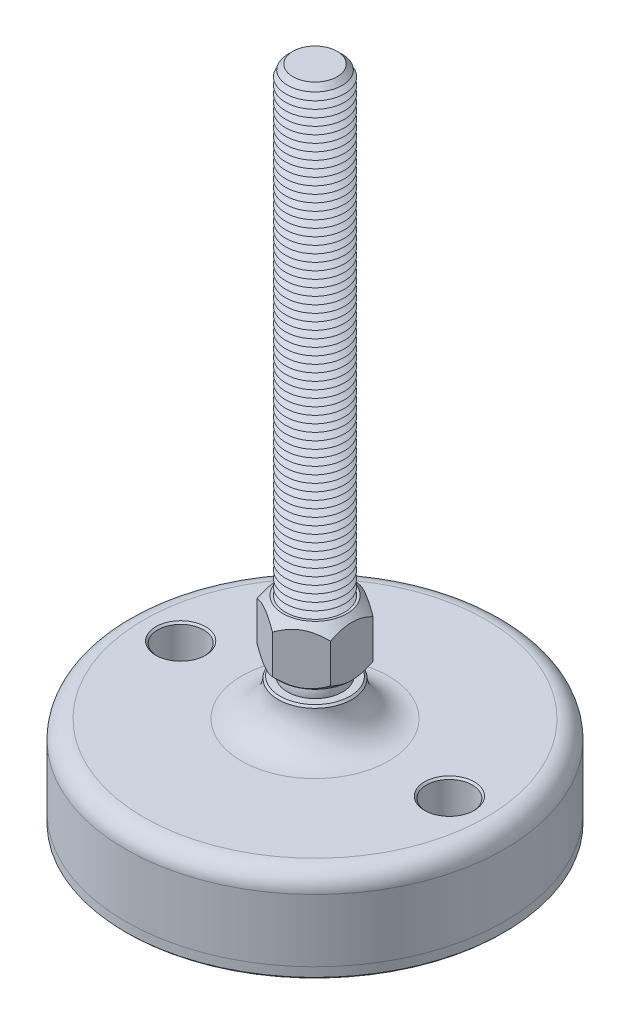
ISO-10303-21;
HEADER;
FILE_DESCRIPTION(('STEP AP214'),'2;1');
FILE_NAME('part.step','',(''),(''),'','','');
FILE_SCHEMA(('AUTOMOTIVE_DESIGN { 1 0 10303 214 1 1 1 1 }'));
ENDSEC;
DATA;
#1=APPLICATION_CONTEXT('core data for automotive mechanical design processes');
#2=APPLICATION_PROTOCOL_DEFINITION('international standard','automotive_design',2000,#1);
#3=PRODUCT_CONTEXT('',#1,'mechanical');
#4=PRODUCT('Part','Part','',(#3));
#5=PRODUCT_RELATED_PRODUCT_CATEGORY('part','',(#4));
#6=PRODUCT_DEFINITION_FORMATION('','',#4);
#7=PRODUCT_DEFINITION_CONTEXT('part definition',#1,'design');
#8=PRODUCT_DEFINITION('design','',#6,#7);
#9=PRODUCT_DEFINITION_SHAPE('','',#8);
#10=(LENGTH_UNIT() NAMED_UNIT(*) SI_UNIT(.MILLI.,.METRE.));
#11=(NAMED_UNIT(*) PLANE_ANGLE_UNIT() SI_UNIT($,.RADIAN.));
#12=(NAMED_UNIT(*) SI_UNIT($,.STERADIAN.) SOLID_ANGLE_UNIT());
#13=UNCERTAINTY_MEASURE_WITH_UNIT(LENGTH_MEASURE(1.E-05),#10,'distance_accuracy_value','');
#14=(GEOMETRIC_REPRESENTATION_CONTEXT(3) GLOBAL_UNCERTAINTY_ASSIGNED_CONTEXT((#13)) GLOBAL_UNIT_ASSIGNED_CONTEXT((#10,
#11,#12)) REPRESENTATION_CONTEXT('',''));
#15=CARTESIAN_POINT('',(0.,0.,0.));
#16=DIRECTION('',(0.,0.,1.));
#17=DIRECTION('',(1.,0.,0.));
#18=AXIS2_PLACEMENT_3D('',#15,#16,#17);
#19=CARTESIAN_POINT('',(0.,-32.,0.));
#20=DIRECTION('',(0.,1.,0.));
#21=DIRECTION('',(0.,0.,1.));
#22=AXIS2_PLACEMENT_3D('',#19,#20,#21);
#23=PLANE('',#22);
#24=CARTESIAN_POINT('',(-36.5,-32.,0.));
#25=DIRECTION('',(0.,1.,0.));
#26=DIRECTION('',(0.,0.,1.));
#27=AXIS2_PLACEMENT_3D('',#24,#25,#26);
#28=CIRCLE('',#27,6.25);
#29=CARTESIAN_POINT('',(-36.5,-32.,6.25));
#30=VERTEX_POINT('',#29);
#31=EDGE_CURVE('P0_E43',#30,#30,#28,.T.);
#32=ORIENTED_EDGE('',*,*,#31,.F.);
#33=EDGE_LOOP('',(#32));
#34=FACE_BOUND('',#33,.T.);
#35=CARTESIAN_POINT('',(36.5,-32.,0.));
#36=DIRECTION('',(0.,1.,0.));
#37=DIRECTION('',(0.,0.,1.));
#38=AXIS2_PLACEMENT_3D('',#35,#36,#37);
#39=CIRCLE('',#38,6.25);
#40=CARTESIAN_POINT('',(36.5,-32.,6.25));
#41=VERTEX_POINT('',#40);
#42=EDGE_CURVE('P0_E44',#41,#41,#39,.T.);
#43=ORIENTED_EDGE('',*,*,#42,.F.);
#44=EDGE_LOOP('',(#43));
#45=FACE_BOUND('',#44,.T.);
#46=CARTESIAN_POINT('',(0.,-32.,0.));
#47=DIRECTION('',(0.,1.,0.));
#48=DIRECTION('',(0.,0.,1.));
#49=AXIS2_PLACEMENT_3D('',#46,#47,#48);
#50=CIRCLE('',#49,51.5);
#51=CARTESIAN_POINT('',(0.,-32.,51.5));
#52=VERTEX_POINT('',#51);
#53=EDGE_CURVE('P0_E40',#52,#52,#50,.T.);
#54=ORIENTED_EDGE('',*,*,#53,.T.);
#55=EDGE_LOOP('',(#54));
#56=FACE_BOUND('',#55,.T.);
#57=ADVANCED_FACE('P0_F14',(#34,#45,#56),#23,.T.);
#58=CARTESIAN_POINT('',(0.,43.1654938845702,0.));
#59=DIRECTION('',(0.,1.,0.));
#60=DIRECTION('',(0.,0.,1.));
#61=AXIS2_PLACEMENT_3D('',#58,#59,#60);
#62=CYLINDRICAL_SURFACE('',#61,51.5);
#63=CARTESIAN_POINT('',(0.,-34.5,0.));
#64=DIRECTION('',(0.,-1.,0.));
#65=DIRECTION('',(0.,0.,-1.));
#66=AXIS2_PLACEMENT_3D('',#63,#64,#65);
#67=CIRCLE('',#66,51.5);
#68=CARTESIAN_POINT('',(0.,-34.5,-51.5));
#69=VERTEX_POINT('',#68);
#70=EDGE_CURVE('P0_E37',#69,#69,#67,.F.);
#71=ORIENTED_EDGE('',*,*,#70,.T.);
#72=EDGE_LOOP('',(#71));
#73=FACE_BOUND('',#72,.T.);
#74=ORIENTED_EDGE('',*,*,#53,.F.);
#75=EDGE_LOOP('',(#74));
#76=FACE_BOUND('',#75,.T.);
#77=ADVANCED_FACE('P0_F54',(#73,#76),#62,.T.);
#78=CARTESIAN_POINT('',(0.,-35.,51.5));
#79=DIRECTION('',(0.,-1.,0.));
#80=DIRECTION('',(0.,0.,-1.));
#81=AXIS2_PLACEMENT_3D('',#78,#79,#80);
#82=PLANE('',#81);
#83=CARTESIAN_POINT('',(36.5,-35.,0.));
#84=DIRECTION('',(0.,-1.,0.));
#85=DIRECTION('',(0.,0.,-1.));
#86=AXIS2_PLACEMENT_3D('',#83,#84,#85);
#87=CIRCLE('',#86,6.75000000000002);
#88=CARTESIAN_POINT('',(36.5,-35.,-6.75000000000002));
#89=VERTEX_POINT('',#88);
#90=EDGE_CURVE('P0_E25',#89,#89,#87,.F.);
#91=ORIENTED_EDGE('',*,*,#90,.T.);
#92=EDGE_LOOP('',(#91));
#93=FACE_BOUND('',#92,.T.);
#94=CARTESIAN_POINT('',(-36.5,-35.,0.));
#95=DIRECTION('',(0.,-1.,0.));
#96=DIRECTION('',(0.,0.,-1.));
#97=AXIS2_PLACEMENT_3D('',#94,#95,#96);
#98=CIRCLE('',#97,6.74999999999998);
#99=CARTESIAN_POINT('',(-36.5,-35.,-6.74999999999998));
#100=VERTEX_POINT('',#99);
#101=EDGE_CURVE('P0_E29',#100,#100,#98,.F.);
#102=ORIENTED_EDGE('',*,*,#101,.T.);
#103=EDGE_LOOP('',(#102));
#104=FACE_BOUND('',#103,.T.);
#105=CARTESIAN_POINT('',(0.,-35.,0.));
#106=DIRECTION('',(0.,-1.,0.));
#107=DIRECTION('',(0.,0.,-1.));
#108=AXIS2_PLACEMENT_3D('',#105,#106,#107);
#109=CIRCLE('',#108,51.);
#110=CARTESIAN_POINT('',(0.,-35.,-51.));
#111=VERTEX_POINT('',#110);
#112=EDGE_CURVE('P0_E34',#111,#111,#109,.T.);
#113=ORIENTED_EDGE('',*,*,#112,.T.);
#114=EDGE_LOOP('',(#113));
#115=FACE_BOUND('',#114,.T.);
#116=ADVANCED_FACE('P0_F61',(#93,#104,#115),#82,.T.);
#117=CARTESIAN_POINT('',(0.,-34.5,0.));
#118=DIRECTION('',(0.,1.,0.));
#119=DIRECTION('',(0.,0.,1.));
#120=AXIS2_PLACEMENT_3D('',#117,#118,#119);
#121=CONICAL_SURFACE('',#120,51.5,0.785398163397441);
#122=ORIENTED_EDGE('',*,*,#112,.F.);
#123=EDGE_LOOP('',(#122));
#124=FACE_BOUND('',#123,.T.);
#125=ORIENTED_EDGE('',*,*,#70,.F.);
#126=EDGE_LOOP('',(#125));
#127=FACE_BOUND('',#126,.T.);
#128=ADVANCED_FACE('P0_F68',(#124,#127),#121,.T.);
#129=CARTESIAN_POINT('',(36.5,-35.,0.));
#130=DIRECTION('',(0.,1.,0.));
#131=DIRECTION('',(0.,0.,1.));
#132=AXIS2_PLACEMENT_3D('',#129,#130,#131);
#133=CYLINDRICAL_SURFACE('',#132,6.25);
#134=CARTESIAN_POINT('',(36.5,-34.5,0.));
#135=DIRECTION('',(0.,-1.,0.));
#136=DIRECTION('',(0.,0.,-1.));
#137=AXIS2_PLACEMENT_3D('',#134,#135,#136);
#138=CIRCLE('',#137,6.25);
#139=CARTESIAN_POINT('',(36.5,-34.5,-6.25));
#140=VERTEX_POINT('',#139);
#141=EDGE_CURVE('P0_E21',#140,#140,#138,.T.);
#142=ORIENTED_EDGE('',*,*,#141,.T.);
#143=EDGE_LOOP('',(#142));
#144=FACE_BOUND('',#143,.T.);
#145=ORIENTED_EDGE('',*,*,#42,.T.);
#146=EDGE_LOOP('',(#145));
#147=FACE_BOUND('',#146,.T.);
#148=ADVANCED_FACE('P0_F74',(#144,#147),#133,.F.);
#149=CARTESIAN_POINT('',(-36.5,-35.,0.));
#150=DIRECTION('',(0.,1.,0.));
#151=DIRECTION('',(0.,0.,1.));
#152=AXIS2_PLACEMENT_3D('',#149,#150,#151);
#153=CYLINDRICAL_SURFACE('',#152,6.25);
#154=CARTESIAN_POINT('',(-36.5,-34.5,0.));
#155=DIRECTION('',(0.,-1.,0.));
#156=DIRECTION('',(0.,0.,-1.));
#157=AXIS2_PLACEMENT_3D('',#154,#155,#156);
#158=CIRCLE('',#157,6.25);
#159=CARTESIAN_POINT('',(-36.5,-34.5,-6.25));
#160=VERTEX_POINT('',#159);
#161=EDGE_CURVE('P0_E10',#160,#160,#158,.T.);
#162=ORIENTED_EDGE('',*,*,#161,.T.);
#163=EDGE_LOOP('',(#162));
#164=FACE_BOUND('',#163,.T.);
#165=ORIENTED_EDGE('',*,*,#31,.T.);
#166=EDGE_LOOP('',(#165));
#167=FACE_BOUND('',#166,.T.);
#168=ADVANCED_FACE('P0_F50',(#164,#167),#153,.F.);
#169=CARTESIAN_POINT('',(36.5,-35.,0.));
#170=DIRECTION('',(0.,-1.,0.));
#171=DIRECTION('',(0.,0.,-1.));
#172=AXIS2_PLACEMENT_3D('',#169,#170,#171);
#173=CONICAL_SURFACE('',#172,6.75000000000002,0.785398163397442);
#174=ORIENTED_EDGE('',*,*,#141,.F.);
#175=EDGE_LOOP('',(#174));
#176=FACE_BOUND('',#175,.T.);
#177=ORIENTED_EDGE('',*,*,#90,.F.);
#178=EDGE_LOOP('',(#177));
#179=FACE_BOUND('',#178,.T.);
#180=ADVANCED_FACE('P0_F76',(#176,#179),#173,.F.);
#181=CARTESIAN_POINT('',(-36.5,-35.,0.));
#182=DIRECTION('',(0.,-1.,0.));
#183=DIRECTION('',(0.,0.,-1.));
#184=AXIS2_PLACEMENT_3D('',#181,#182,#183);
#185=CONICAL_SURFACE('',#184,6.74999999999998,0.785398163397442);
#186=ORIENTED_EDGE('',*,*,#161,.F.);
#187=EDGE_LOOP('',(#186));
#188=FACE_BOUND('',#187,.T.);
#189=ORIENTED_EDGE('',*,*,#101,.F.);
#190=EDGE_LOOP('',(#189));
#191=FACE_BOUND('',#190,.T.);
#192=ADVANCED_FACE('P0_F16',(#188,#191),#185,.F.);
#193=CLOSED_SHELL('',(#57,#77,#116,#128,#148,#168,#180,#192));
#194=MANIFOLD_SOLID_BREP('P0_B1',#193);
#195=CARTESIAN_POINT('',(0.,3.75,0.));
#196=DIRECTION('',(0.,1.,0.));
#197=DIRECTION('',(0.,0.,1.));
#198=AXIS2_PLACEMENT_3D('',#195,#196,#197);
#199=PLANE('',#198);
#200=CARTESIAN_POINT('',(0.,3.75,0.));
#201=DIRECTION('',(0.,1.,0.));
#202=DIRECTION('',(0.,0.,1.));
#203=AXIS2_PLACEMENT_3D('',#200,#201,#202);
#204=CIRCLE('',#203,9.72829454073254);
#205=CARTESIAN_POINT('',(0.,3.75,9.72829454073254));
#206=VERTEX_POINT('',#205);
#207=EDGE_CURVE('P1_E223',#206,#206,#204,.T.);
#208=ORIENTED_EDGE('',*,*,#207,.F.);
#209=EDGE_LOOP('',(#208));
#210=FACE_BOUND('',#209,.T.);
#211=CARTESIAN_POINT('',(0.,3.75,0.));
#212=DIRECTION('',(0.,1.,0.));
#213=DIRECTION('',(0.,0.,1.));
#214=AXIS2_PLACEMENT_3D('',#211,#212,#213);
#215=CIRCLE('',#214,6.49519052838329);
#216=CARTESIAN_POINT('',(0.,3.75,6.49519052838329));
#217=VERTEX_POINT('',#216);
#218=EDGE_CURVE('P1_E25',#217,#217,#215,.F.);
#219=ORIENTED_EDGE('',*,*,#218,.F.);
#220=EDGE_LOOP('',(#219));
#221=FACE_BOUND('',#220,.T.);
#222=ADVANCED_FACE('P1_F16',(#210,#221),#199,.F.);
#223=CARTESIAN_POINT('',(0.,0.,0.));
#224=DIRECTION('',(0.,1.,0.));
#225=DIRECTION('',(0.,0.,-1.));
#226=AXIS2_PLACEMENT_3D('',#223,#224,#225);
#227=SPHERICAL_SURFACE('',#226,7.5);
#228=ORIENTED_EDGE('',*,*,#218,.T.);
#229=EDGE_LOOP('',(#228));
#230=FACE_BOUND('',#229,.T.);
#231=ADVANCED_FACE('P1_F205',(#230),#227,.T.);
#232=CARTESIAN_POINT('',(0.,3.75,0.));
#233=DIRECTION('',(0.,1.,0.));
#234=DIRECTION('',(0.,0.,1.));
#235=AXIS2_PLACEMENT_3D('',#232,#233,#234);
#236=CONICAL_SURFACE('',#235,9.72829454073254,0.785398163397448);
#237=ORIENTED_EDGE('',*,*,#207,.T.);
#238=EDGE_LOOP('',(#237));
#239=FACE_BOUND('',#238,.T.);
#240=CARTESIAN_POINT('',(-10.,9.59571642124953,-11.9394228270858));
#241=CARTESIAN_POINT('',(-10.,9.37430561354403,-11.6505452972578));
#242=CARTESIAN_POINT('',(-10.,9.15490936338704,-11.3600988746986));
#243=CARTESIAN_POINT('',(-10.,8.72106267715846,-10.7754314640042));
#244=CARTESIAN_POINT('',(-10.,8.50661343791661,-10.4812095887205));
#245=CARTESIAN_POINT('',(-10.,8.08205114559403,-9.88620330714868));
#246=CARTESIAN_POINT('',(-10.,7.87198437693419,-9.58538576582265));
#247=CARTESIAN_POINT('',(-10.,7.45926520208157,-8.97872312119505));
#248=CARTESIAN_POINT('',(-10.,7.25661228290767,-8.67287836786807));
#249=CARTESIAN_POINT('',(-10.,6.84809543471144,-8.03614350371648));
#250=CARTESIAN_POINT('',(-10.,6.64281401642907,-7.70487777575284));
#251=CARTESIAN_POINT('',(-10.,6.245142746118,-7.03457466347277));
#252=CARTESIAN_POINT('',(-10.,6.0527550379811,-6.69553599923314));
#253=CARTESIAN_POINT('',(-10.,5.68497951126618,-6.00961937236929));
#254=CARTESIAN_POINT('',(-10.,5.50954176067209,-5.66276839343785));
#255=CARTESIAN_POINT('',(-10.,5.17959635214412,-4.95932933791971));
#256=CARTESIAN_POINT('',(-10.,5.02507889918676,-4.60274591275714));
#257=CARTESIAN_POINT('',(-10.,4.75599518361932,-3.91353381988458));
#258=CARTESIAN_POINT('',(-10.,4.63902686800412,-3.58185263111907));
#259=CARTESIAN_POINT('',(-10.,4.43164927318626,-2.91013341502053));
#260=CARTESIAN_POINT('',(-10.,4.34124171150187,-2.57009484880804));
#261=CARTESIAN_POINT('',(-10.,4.19334931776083,-1.88955843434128));
#262=CARTESIAN_POINT('',(-10.,4.13527351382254,-1.54919119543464));
#263=CARTESIAN_POINT('',(-10.,4.05324021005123,-0.864347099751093));
#264=CARTESIAN_POINT('',(-10.,4.029275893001,-0.519871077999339));
#265=CARTESIAN_POINT('',(-10.,4.01745435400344,0.155191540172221));
#266=CARTESIAN_POINT('',(-10.,4.02812008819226,0.485752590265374));
#267=CARTESIAN_POINT('',(-10.,4.08160326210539,1.1442457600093));
#268=CARTESIAN_POINT('',(-10.,4.12442366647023,1.47217763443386));
#269=CARTESIAN_POINT('',(-10.,4.24054019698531,2.12859326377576));
#270=CARTESIAN_POINT('',(-10.,4.31437036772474,2.45698095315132));
#271=CARTESIAN_POINT('',(-10.,4.48844287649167,3.10654175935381));
#272=CARTESIAN_POINT('',(-10.,4.58868356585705,3.42771532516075));
#273=CARTESIAN_POINT('',(-10.,4.81839210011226,4.08271396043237));
#274=CARTESIAN_POINT('',(-10.,4.94932842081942,4.41601827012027));
#275=CARTESIAN_POINT('',(-10.,5.23140828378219,5.07403931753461));
#276=CARTESIAN_POINT('',(-10.,5.38256099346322,5.3987520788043));
#277=CARTESIAN_POINT('',(-10.,5.70148727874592,6.04113299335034));
#278=CARTESIAN_POINT('',(-10.,5.86931223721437,6.35877542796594));
#279=CARTESIAN_POINT('',(-10.,6.21788686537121,6.98677627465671));
#280=CARTESIAN_POINT('',(-10.,6.39863453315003,7.29713580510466));
#281=CARTESIAN_POINT('',(-10.,6.76133545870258,7.89633938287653));
#282=CARTESIAN_POINT('',(-10.,6.94278731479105,8.18548854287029));
#283=CARTESIAN_POINT('',(-10.,7.31339871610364,8.75881961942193));
#284=CARTESIAN_POINT('',(-10.,7.50255884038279,9.04300116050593));
#285=CARTESIAN_POINT('',(-10.,7.8856676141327,9.6047584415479));
#286=CARTESIAN_POINT('',(-10.,8.07956548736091,9.88236893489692));
#287=CARTESIAN_POINT('',(-10.,8.47254700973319,10.4337838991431));
#288=CARTESIAN_POINT('',(-10.,8.67162921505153,10.7075893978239));
#289=CARTESIAN_POINT('',(-10.,8.87283307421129,10.9797992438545));
#290=B_SPLINE_CURVE_WITH_KNOTS('',3,(#240,#241,#242,#243,#244,#245,#246,#247,#248,#249,#250,
#251,#252,#253,#254,#255,#256,#257,#258,#259,#260,#261,#262,#263,#264,#265,#266,#267,#268,#269,
#270,#271,#272,#273,#274,#275,#276,#277,#278,#279,#280,#281,#282,#283,#284,#285,#286,#287,#288,
#289),.UNSPECIFIED.,.F.,.F.,(4,2,2,2,2,2,2,2,2,2,2,2,2,2,2,2,2,2,2,2,2,2,2,2,4),(0.,
1.09192545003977,2.18411235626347,3.28473497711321,4.3852812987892,5.5541916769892,
6.72329593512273,7.88884387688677,9.05384420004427,10.1080362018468,11.1622963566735,
12.1965943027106,13.2306855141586,14.2212593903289,15.2119246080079,16.2203997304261,
17.2288119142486,18.3022883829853,19.3762532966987,20.4536373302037,21.5308548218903,
22.5548150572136,23.5788523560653,24.5946500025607,25.6101677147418),.UNSPECIFIED.);
#291=CARTESIAN_POINT('',(-10.,5.56871084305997,-5.77350269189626));
#292=VERTEX_POINT('',#291);
#293=CARTESIAN_POINT('',(-10.,5.56871084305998,5.77350269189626));
#294=VERTEX_POINT('',#293);
#295=EDGE_CURVE('P1_E188',#292,#294,#290,.T.);
#296=ORIENTED_EDGE('',*,*,#295,.F.);
#297=CARTESIAN_POINT('',(0.000199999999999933,5.56882631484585,-11.5471208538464));
#298=CARTESIAN_POINT('',(-0.171722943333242,5.4695807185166,-11.447861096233));
#299=CARTESIAN_POINT('',(-0.344992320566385,5.37336355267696,-11.3478239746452));
#300=CARTESIAN_POINT('',(-0.694433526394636,5.18794806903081,-11.1460740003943));
#301=CARTESIAN_POINT('',(-0.870606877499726,5.09875358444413,-11.0443602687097));
#302=CARTESIAN_POINT('',(-1.22689656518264,4.92796770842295,-10.8386563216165));
#303=CARTESIAN_POINT('',(-1.40702970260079,4.84642277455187,-10.7346564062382));
#304=CARTESIAN_POINT('',(-1.77025459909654,4.69270708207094,-10.52494841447));
#305=CARTESIAN_POINT('',(-1.95334590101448,4.62053489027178,-10.4192406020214));
#306=CARTESIAN_POINT('',(-2.31954331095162,4.4878482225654,-10.2078164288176));
#307=CARTESIAN_POINT('',(-2.50260441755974,4.42716910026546,-10.1021260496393));
#308=CARTESIAN_POINT('',(-2.87129282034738,4.31731511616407,-9.88926370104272));
#309=CARTESIAN_POINT('',(-3.05691983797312,4.26813901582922,-9.78209189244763));
#310=CARTESIAN_POINT('',(-3.42994608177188,4.1825291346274,-9.56672509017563));
#311=CARTESIAN_POINT('',(-3.61734032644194,4.14606667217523,-9.45853297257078));
#312=CARTESIAN_POINT('',(-3.99370204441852,4.08668528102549,-9.24124043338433));
#313=CARTESIAN_POINT('',(-4.1826692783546,4.06376432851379,-9.13214015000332));
#314=CARTESIAN_POINT('',(-4.64316633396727,4.0253323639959,-8.86627205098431));
#315=CARTESIAN_POINT('',(-4.91519388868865,4.01726744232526,-8.70921686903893));
#316=CARTESIAN_POINT('',(-5.45875701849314,4.03080424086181,-8.39539054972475));
#317=CARTESIAN_POINT('',(-5.7302923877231,4.05241636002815,-8.23861953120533));
#318=CARTESIAN_POINT('',(-6.27080349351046,4.12403157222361,-7.92655529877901));
#319=CARTESIAN_POINT('',(-6.53977602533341,4.17406641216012,-7.77126393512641));
#320=CARTESIAN_POINT('',(-7.07309796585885,4.29980733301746,-7.46335036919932));
#321=CARTESIAN_POINT('',(-7.33744772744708,4.3755114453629,-7.31072796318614));
#322=CARTESIAN_POINT('',(-7.80670351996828,4.53125365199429,-7.03980300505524));
#323=CARTESIAN_POINT('',(-8.01264886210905,4.60719488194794,-6.92090040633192));
#324=CARTESIAN_POINT('',(-8.42084280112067,4.77131434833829,-6.68522952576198));
#325=CARTESIAN_POINT('',(-8.62309128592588,4.85949295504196,-6.5684613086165));
#326=CARTESIAN_POINT('',(-9.02325448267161,5.04611070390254,-6.33742697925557));
#327=CARTESIAN_POINT('',(-9.22118057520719,5.1445175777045,-6.2231542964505));
#328=CARTESIAN_POINT('',(-9.61336795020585,5.35030005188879,-5.99672480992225));
#329=CARTESIAN_POINT('',(-9.80763139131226,5.45767015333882,-5.88456675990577));
#330=CARTESIAN_POINT('',(-10.0002,5.56882631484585,-5.77338722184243));
#331=B_SPLINE_CURVE_WITH_KNOTS('',3,(#297,#298,#299,#300,#301,#302,#303,#304,#305,#306,#307,
#308,#309,#310,#311,#312,#313,#314,#315,#316,#317,#318,#319,#320,#321,#322,#323,#324,#325,#326,
#327,#328,#329,#330),.UNSPECIFIED.,.F.,.F.,(4,2,2,2,2,2,2,2,2,2,2,2,2,2,2,2,4),(0.,
0.665863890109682,1.33208874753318,2.00212824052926,2.67206515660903,3.33152613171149,
3.99091606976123,4.64880867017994,5.30660292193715,6.24777541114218,7.18927777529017,
8.13183382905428,9.07431761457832,9.82287578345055,10.5714566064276,11.3177436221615,
12.0635761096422),.UNSPECIFIED.);
#332=CARTESIAN_POINT('',(0.,5.56871084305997,-11.5470053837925));
#333=VERTEX_POINT('',#332);
#334=EDGE_CURVE('P1_E182',#333,#292,#331,.T.);
#335=ORIENTED_EDGE('',*,*,#334,.F.);
#336=CARTESIAN_POINT('',(10.0002,5.56882631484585,-5.77338722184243));
#337=CARTESIAN_POINT('',(9.82827705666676,5.4695807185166,-5.87264697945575));
#338=CARTESIAN_POINT('',(9.65500767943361,5.37336355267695,-5.97268410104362));
#339=CARTESIAN_POINT('',(9.30556647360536,5.18794806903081,-6.17443407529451));
#340=CARTESIAN_POINT('',(9.12939312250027,5.09875358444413,-6.27614780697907));
#341=CARTESIAN_POINT('',(8.77310343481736,4.92796770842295,-6.48185175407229));
#342=CARTESIAN_POINT('',(8.59297029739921,4.84642277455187,-6.58585166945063));
#343=CARTESIAN_POINT('',(8.22974540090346,4.69270708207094,-6.79555966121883));
#344=CARTESIAN_POINT('',(8.04665409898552,4.62053489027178,-6.90126747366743));
#345=CARTESIAN_POINT('',(7.68045668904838,4.4878482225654,-7.11269164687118));
#346=CARTESIAN_POINT('',(7.49739558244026,4.42716910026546,-7.21838202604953));
#347=CARTESIAN_POINT('',(7.12870717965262,4.31731511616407,-7.43124437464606));
#348=CARTESIAN_POINT('',(6.94308016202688,4.26813901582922,-7.53841618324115));
#349=CARTESIAN_POINT('',(6.57005391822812,4.1825291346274,-7.75378298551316));
#350=CARTESIAN_POINT('',(6.38265967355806,4.14606667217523,-7.861975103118));
#351=CARTESIAN_POINT('',(6.00629795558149,4.08668528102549,-8.07926764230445));
#352=CARTESIAN_POINT('',(5.81733072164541,4.06376432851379,-8.18836792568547));
#353=CARTESIAN_POINT('',(5.35683366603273,4.0253323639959,-8.45423602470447));
#354=CARTESIAN_POINT('',(5.08480611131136,4.01726744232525,-8.61129120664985));
#355=CARTESIAN_POINT('',(4.54124298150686,4.03080424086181,-8.92511752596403));
#356=CARTESIAN_POINT('',(4.2697076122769,4.05241636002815,-9.08188854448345));
#357=CARTESIAN_POINT('',(3.72919650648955,4.12403157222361,-9.39395277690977));
#358=CARTESIAN_POINT('',(3.46022397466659,4.17406641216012,-9.54924414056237));
#359=CARTESIAN_POINT('',(2.92690203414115,4.29980733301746,-9.85715770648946));
#360=CARTESIAN_POINT('',(2.66255227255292,4.37551144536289,-10.0097801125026));
#361=CARTESIAN_POINT('',(2.19329648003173,4.53125365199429,-10.2807050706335));
#362=CARTESIAN_POINT('',(1.98735113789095,4.60719488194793,-10.3996076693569));
#363=CARTESIAN_POINT('',(1.57915719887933,4.77131434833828,-10.6352785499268));
#364=CARTESIAN_POINT('',(1.37690871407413,4.85949295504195,-10.7520467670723));
#365=CARTESIAN_POINT('',(0.976745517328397,5.04611070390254,-10.9830810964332));
#366=CARTESIAN_POINT('',(0.77881942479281,5.1445175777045,-11.0973537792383));
#367=CARTESIAN_POINT('',(0.386632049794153,5.35030005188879,-11.3237832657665));
#368=CARTESIAN_POINT('',(0.192368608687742,5.45767015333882,-11.435941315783));
#369=CARTESIAN_POINT('',(-0.000199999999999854,5.56882631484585,-11.5471208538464));
#370=B_SPLINE_CURVE_WITH_KNOTS('',3,(#336,#337,#338,#339,#340,#341,#342,#343,#344,#345,#346,
#347,#348,#349,#350,#351,#352,#353,#354,#355,#356,#357,#358,#359,#360,#361,#362,#363,#364,#365,
#366,#367,#368,#369),.UNSPECIFIED.,.F.,.F.,(4,2,2,2,2,2,2,2,2,2,2,2,2,2,2,2,4),(0.,
0.665863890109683,1.33208874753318,2.00212824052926,2.67206515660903,3.33152613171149,
3.99091606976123,4.64880867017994,5.30660292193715,6.24777541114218,7.18927777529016,
8.13183382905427,9.07431761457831,9.82287578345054,10.5714566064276,11.3177436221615,
12.0635761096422),.UNSPECIFIED.);
#371=CARTESIAN_POINT('',(9.99999999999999,5.56871084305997,-5.77350269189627));
#372=VERTEX_POINT('',#371);
#373=EDGE_CURVE('P1_E170',#372,#333,#370,.T.);
#374=ORIENTED_EDGE('',*,*,#373,.F.);
#375=CARTESIAN_POINT('',(10.,9.59571642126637,-11.9394228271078));
#376=CARTESIAN_POINT('',(10.,9.37430561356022,-11.6505452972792));
#377=CARTESIAN_POINT('',(10.,9.15490936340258,-11.3600988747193));
#378=CARTESIAN_POINT('',(10.,8.7210626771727,-10.7754314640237));
#379=CARTESIAN_POINT('',(10.,8.5066134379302,-10.4812095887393));
#380=CARTESIAN_POINT('',(10.,8.08205114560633,-9.88620330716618));
#381=CARTESIAN_POINT('',(10.,7.87198437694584,-9.58538576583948));
#382=CARTESIAN_POINT('',(10.,7.45926520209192,-8.97872312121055));
#383=CARTESIAN_POINT('',(10.,7.25661228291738,-8.67287836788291));
#384=CARTESIAN_POINT('',(10.,6.84809543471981,-8.03614350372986));
#385=CARTESIAN_POINT('',(10.,6.64281401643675,-7.70487777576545));
#386=CARTESIAN_POINT('',(10.,6.24514274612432,-7.03457466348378));
#387=CARTESIAN_POINT('',(10.,6.05275503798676,-6.69553599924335));
#388=CARTESIAN_POINT('',(10.,5.68497951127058,-6.00961937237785));
#389=CARTESIAN_POINT('',(10.,5.50954176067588,-5.66276839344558));
#390=CARTESIAN_POINT('',(10.,5.17959635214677,-4.95932933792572));
#391=CARTESIAN_POINT('',(10.,5.02507889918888,-4.60274591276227));
#392=CARTESIAN_POINT('',(10.,4.75599518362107,-3.91353381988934));
#393=CARTESIAN_POINT('',(10.,4.63902686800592,-3.58185263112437));
#394=CARTESIAN_POINT('',(10.,4.43164927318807,-2.91013341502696));
#395=CARTESIAN_POINT('',(10.,4.34124171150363,-2.57009484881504));
#396=CARTESIAN_POINT('',(10.,4.19334931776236,-1.8895584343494));
#397=CARTESIAN_POINT('',(10.,4.13527351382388,-1.54919119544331));
#398=CARTESIAN_POINT('',(10.,4.05324021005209,-0.86434709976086));
#399=CARTESIAN_POINT('',(10.,4.02927589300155,-0.519871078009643));
#400=CARTESIAN_POINT('',(10.,4.01745435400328,0.155191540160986));
#401=CARTESIAN_POINT('',(10.,4.0281200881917,0.485752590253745));
#402=CARTESIAN_POINT('',(10.,4.08160326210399,1.14424575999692));
#403=CARTESIAN_POINT('',(10.,4.12442366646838,1.47217763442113));
#404=CARTESIAN_POINT('',(10.,4.24054019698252,2.12859326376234));
#405=CARTESIAN_POINT('',(10.,4.31437036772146,2.45698095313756));
#406=CARTESIAN_POINT('',(10.,4.48844287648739,3.1065417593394));
#407=CARTESIAN_POINT('',(10.,4.58868356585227,3.42771532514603));
#408=CARTESIAN_POINT('',(10.,4.81839210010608,4.08271396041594));
#409=CARTESIAN_POINT('',(10.,4.94932842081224,4.41601827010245));
#410=CARTESIAN_POINT('',(10.,5.23140828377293,5.0740393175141));
#411=CARTESIAN_POINT('',(10.,5.38256099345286,5.39875207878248));
#412=CARTESIAN_POINT('',(10.,5.70148727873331,6.04113299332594));
#413=CARTESIAN_POINT('',(10.,5.86931223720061,6.35877542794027));
#414=CARTESIAN_POINT('',(10.,6.21788686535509,6.98677627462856));
#415=CARTESIAN_POINT('',(10.,6.39863453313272,7.29713580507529));
#416=CARTESIAN_POINT('',(10.,6.761335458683,7.89633938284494));
#417=CARTESIAN_POINT('',(10.,6.9427873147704,8.18548854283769));
#418=CARTESIAN_POINT('',(10.,7.31339871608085,8.75881961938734));
#419=CARTESIAN_POINT('',(10.,7.50255884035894,9.04300116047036));
#420=CARTESIAN_POINT('',(10.,7.88566761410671,9.60475844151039));
#421=CARTESIAN_POINT('',(10.,8.07956548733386,9.88236893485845));
#422=CARTESIAN_POINT('',(10.,8.47254700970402,10.4337838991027));
#423=CARTESIAN_POINT('',(10.,8.6716292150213,10.7075893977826));
#424=CARTESIAN_POINT('',(10.,8.87283307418,10.9797992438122));
#425=B_SPLINE_CURVE_WITH_KNOTS('',3,(#375,#376,#377,#378,#379,#380,#381,#382,#383,#384,#385,
#386,#387,#388,#389,#390,#391,#392,#393,#394,#395,#396,#397,#398,#399,#400,#401,#402,#403,#404,
#405,#406,#407,#408,#409,#410,#411,#412,#413,#414,#415,#416,#417,#418,#419,#420,#421,#422,#423,
#424),.UNSPECIFIED.,.F.,.F.,(4,2,2,2,2,2,2,2,2,2,2,2,2,2,2,2,2,2,2,2,2,2,2,2,4),(0.,
1.09192545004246,2.18411235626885,3.28473497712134,4.38528129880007,5.55419167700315,
6.72329593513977,7.88884387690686,9.05384420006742,10.1080362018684,11.1622963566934,
12.196594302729,13.2306855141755,14.2212593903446,15.2119246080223,16.2203997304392,
17.2288119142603,18.3022883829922,19.3762532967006,20.4536373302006,21.5308548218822,
22.5548150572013,23.5788523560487,24.5946500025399,25.6101677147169),.UNSPECIFIED.);
#426=CARTESIAN_POINT('',(10.,5.56871084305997,5.77350269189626));
#427=VERTEX_POINT('',#426);
#428=EDGE_CURVE('P1_E71',#427,#372,#425,.F.);
#429=ORIENTED_EDGE('',*,*,#428,.F.);
#430=CARTESIAN_POINT('',(-0.000200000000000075,5.56882631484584,11.5471208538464));
#431=CARTESIAN_POINT('',(0.171722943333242,5.4695807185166,11.447861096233));
#432=CARTESIAN_POINT('',(0.344992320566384,5.37336355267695,11.3478239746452));
#433=CARTESIAN_POINT('',(0.694433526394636,5.18794806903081,11.1460740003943));
#434=CARTESIAN_POINT('',(0.870606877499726,5.09875358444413,11.0443602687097));
#435=CARTESIAN_POINT('',(1.22689656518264,4.92796770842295,10.8386563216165));
#436=CARTESIAN_POINT('',(1.40702970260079,4.84642277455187,10.7346564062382));
#437=CARTESIAN_POINT('',(1.77025459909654,4.69270708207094,10.52494841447));
#438=CARTESIAN_POINT('',(1.95334590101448,4.62053489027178,10.4192406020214));
#439=CARTESIAN_POINT('',(2.31954331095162,4.4878482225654,10.2078164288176));
#440=CARTESIAN_POINT('',(2.50260441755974,4.42716910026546,10.1021260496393));
#441=CARTESIAN_POINT('',(2.87129282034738,4.31731511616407,9.88926370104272));
#442=CARTESIAN_POINT('',(3.05691983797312,4.26813901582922,9.78209189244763));
#443=CARTESIAN_POINT('',(3.42994608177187,4.18252913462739,9.56672509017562));
#444=CARTESIAN_POINT('',(3.61734032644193,4.14606667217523,9.45853297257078));
#445=CARTESIAN_POINT('',(3.99370204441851,4.08668528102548,9.24124043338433));
#446=CARTESIAN_POINT('',(4.18266927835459,4.06376432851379,9.13214015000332));
#447=CARTESIAN_POINT('',(4.64316633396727,4.0253323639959,8.86627205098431));
#448=CARTESIAN_POINT('',(4.91519388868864,4.01726744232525,8.70921686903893));
#449=CARTESIAN_POINT('',(5.45875701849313,4.03080424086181,8.39539054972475));
#450=CARTESIAN_POINT('',(5.7302923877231,4.05241636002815,8.23861953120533));
#451=CARTESIAN_POINT('',(6.27080349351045,4.1240315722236,7.92655529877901));
#452=CARTESIAN_POINT('',(6.53977602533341,4.17406641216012,7.77126393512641));
#453=CARTESIAN_POINT('',(7.07309796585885,4.29980733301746,7.46335036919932));
#454=CARTESIAN_POINT('',(7.33744772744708,4.37551144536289,7.31072796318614));
#455=CARTESIAN_POINT('',(7.80670351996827,4.53125365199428,7.03980300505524));
#456=CARTESIAN_POINT('',(8.01264886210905,4.60719488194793,6.92090040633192));
#457=CARTESIAN_POINT('',(8.42084280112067,4.77131434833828,6.68522952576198));
#458=CARTESIAN_POINT('',(8.62309128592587,4.85949295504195,6.5684613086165));
#459=CARTESIAN_POINT('',(9.0232544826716,5.04611070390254,6.33742697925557));
#460=CARTESIAN_POINT('',(9.22118057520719,5.1445175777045,6.2231542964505));
#461=CARTESIAN_POINT('',(9.61336795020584,5.35030005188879,5.99672480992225));
#462=CARTESIAN_POINT('',(9.80763139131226,5.45767015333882,5.88456675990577));
#463=CARTESIAN_POINT('',(10.0002,5.56882631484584,5.77338722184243));
#464=B_SPLINE_CURVE_WITH_KNOTS('',3,(#430,#431,#432,#433,#434,#435,#436,#437,#438,#439,#440,
#441,#442,#443,#444,#445,#446,#447,#448,#449,#450,#451,#452,#453,#454,#455,#456,#457,#458,#459,
#460,#461,#462,#463),.UNSPECIFIED.,.F.,.F.,(4,2,2,2,2,2,2,2,2,2,2,2,2,2,2,2,4),(0.,
0.665863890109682,1.33208874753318,2.00212824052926,2.67206515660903,3.33152613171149,
3.99091606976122,4.64880867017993,5.30660292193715,6.24777541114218,7.18927777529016,
8.13183382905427,9.07431761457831,9.82287578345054,10.5714566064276,11.3177436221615,
12.0635761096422),.UNSPECIFIED.);
#465=CARTESIAN_POINT('',(0.,5.56871084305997,11.5470053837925));
#466=VERTEX_POINT('',#465);
#467=EDGE_CURVE('P1_E68',#466,#427,#464,.T.);
#468=ORIENTED_EDGE('',*,*,#467,.F.);
#469=CARTESIAN_POINT('',(-10.0002,5.56882631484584,5.77338722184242));
#470=CARTESIAN_POINT('',(-9.82827705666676,5.4695807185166,5.87264697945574));
#471=CARTESIAN_POINT('',(-9.65500767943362,5.37336355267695,5.97268410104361));
#472=CARTESIAN_POINT('',(-9.30556647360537,5.18794806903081,6.1744340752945));
#473=CARTESIAN_POINT('',(-9.12939312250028,5.09875358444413,6.27614780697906));
#474=CARTESIAN_POINT('',(-8.77310343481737,4.92796770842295,6.48185175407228));
#475=CARTESIAN_POINT('',(-8.59297029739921,4.84642277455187,6.58585166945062));
#476=CARTESIAN_POINT('',(-8.22974540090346,4.69270708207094,6.79555966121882));
#477=CARTESIAN_POINT('',(-8.04665409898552,4.62053489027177,6.90126747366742));
#478=CARTESIAN_POINT('',(-7.68045668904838,4.48784822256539,7.11269164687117));
#479=CARTESIAN_POINT('',(-7.49739558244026,4.42716910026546,7.21838202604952));
#480=CARTESIAN_POINT('',(-7.12870717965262,4.31731511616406,7.43124437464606));
#481=CARTESIAN_POINT('',(-6.94308016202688,4.26813901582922,7.53841618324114));
#482=CARTESIAN_POINT('',(-6.57005391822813,4.18252913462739,7.75378298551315));
#483=CARTESIAN_POINT('',(-6.38265967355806,4.14606667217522,7.861975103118));
#484=CARTESIAN_POINT('',(-6.00629795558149,4.08668528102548,8.07926764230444));
#485=CARTESIAN_POINT('',(-5.81733072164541,4.06376432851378,8.18836792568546));
#486=CARTESIAN_POINT('',(-5.35683366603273,4.0253323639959,8.45423602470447));
#487=CARTESIAN_POINT('',(-5.08480611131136,4.01726744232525,8.61129120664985));
#488=CARTESIAN_POINT('',(-4.54124298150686,4.0308042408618,8.92511752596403));
#489=CARTESIAN_POINT('',(-4.2697076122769,4.05241636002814,9.08188854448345));
#490=CARTESIAN_POINT('',(-3.72919650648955,4.1240315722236,9.39395277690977));
#491=CARTESIAN_POINT('',(-3.46022397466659,4.17406641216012,9.54924414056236));
#492=CARTESIAN_POINT('',(-2.92690203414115,4.29980733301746,9.85715770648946));
#493=CARTESIAN_POINT('',(-2.66255227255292,4.37551144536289,10.0097801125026));
#494=CARTESIAN_POINT('',(-2.19329648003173,4.53125365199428,10.2807050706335));
#495=CARTESIAN_POINT('',(-1.98735113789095,4.60719488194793,10.3996076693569));
#496=CARTESIAN_POINT('',(-1.57915719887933,4.77131434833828,10.6352785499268));
#497=CARTESIAN_POINT('',(-1.37690871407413,4.85949295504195,10.7520467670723));
#498=CARTESIAN_POINT('',(-0.976745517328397,5.04611070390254,10.9830810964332));
#499=CARTESIAN_POINT('',(-0.778819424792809,5.1445175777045,11.0973537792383));
#500=CARTESIAN_POINT('',(-0.386632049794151,5.35030005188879,11.3237832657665));
#501=CARTESIAN_POINT('',(-0.192368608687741,5.45767015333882,11.435941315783));
#502=CARTESIAN_POINT('',(0.000199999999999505,5.56882631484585,11.5471208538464));
#503=B_SPLINE_CURVE_WITH_KNOTS('',3,(#469,#470,#471,#472,#473,#474,#475,#476,#477,#478,#479,
#480,#481,#482,#483,#484,#485,#486,#487,#488,#489,#490,#491,#492,#493,#494,#495,#496,#497,#498,
#499,#500,#501,#502),.UNSPECIFIED.,.F.,.F.,(4,2,2,2,2,2,2,2,2,2,2,2,2,2,2,2,4),(0.,
0.665863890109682,1.33208874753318,2.00212824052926,2.67206515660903,3.33152613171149,
3.99091606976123,4.64880867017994,5.30660292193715,6.24777541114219,7.18927777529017,
8.13183382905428,9.07431761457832,9.82287578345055,10.5714566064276,11.3177436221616,
12.0635761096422),.UNSPECIFIED.);
#504=EDGE_CURVE('P1_E40',#294,#466,#503,.T.);
#505=ORIENTED_EDGE('',*,*,#504,.F.);
#506=EDGE_LOOP('',(#296,#335,#374,#429,#468,#505));
#507=FACE_BOUND('',#506,.T.);
#508=ADVANCED_FACE('P1_F69',(#239,#507),#236,.T.);
#509=CARTESIAN_POINT('',(-10.,19.,-5.77350269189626));
#510=DIRECTION('',(1.,0.,0.));
#511=DIRECTION('',(0.,0.,-1.));
#512=AXIS2_PLACEMENT_3D('',#509,#510,#511);
#513=PLANE('',#512);
#514=DIRECTION('',(0.,-1.,0.));
#515=VECTOR('',#514,1.);
#516=CARTESIAN_POINT('',(-10.,19.,5.77350269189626));
#517=LINE('',#516,#515);
#518=CARTESIAN_POINT('',(-10.,16.1132486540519,5.77350269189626));
#519=VERTEX_POINT('',#518);
#520=EDGE_CURVE('P1_E84',#519,#294,#517,.T.);
#521=ORIENTED_EDGE('',*,*,#520,.F.);
#522=CARTESIAN_POINT('',(-10.,12.4093918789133,-11.5147208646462));
#523=CARTESIAN_POINT('',(-10.,12.6210295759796,-11.2343500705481));
#524=CARTESIAN_POINT('',(-10.,12.8306215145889,-10.9524094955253));
#525=CARTESIAN_POINT('',(-10.,13.2447979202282,-10.3847695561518));
#526=CARTESIAN_POINT('',(-10.,13.4493811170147,-10.0990692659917));
#527=CARTESIAN_POINT('',(-10.,13.8540786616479,-9.52120077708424));
#528=CARTESIAN_POINT('',(-10.,14.0541461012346,-9.22899961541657));
#529=CARTESIAN_POINT('',(-10.,14.4468132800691,-8.63963749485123));
#530=CARTESIAN_POINT('',(-10.,14.6394135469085,-8.34247688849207));
#531=CARTESIAN_POINT('',(-10.,15.0262335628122,-7.72525702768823));
#532=CARTESIAN_POINT('',(-10.,15.2199166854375,-7.40485974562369));
#533=CARTESIAN_POINT('',(-10.,15.5945399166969,-6.75658646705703));
#534=CARTESIAN_POINT('',(-10.,15.7754780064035,-6.4287092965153));
#535=CARTESIAN_POINT('',(-10.,16.1207071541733,-5.76550673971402));
#536=CARTESIAN_POINT('',(-10.,16.285047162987,-5.43020703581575));
#537=CARTESIAN_POINT('',(-10.,16.5934011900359,-4.75046311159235));
#538=CARTESIAN_POINT('',(-10.,16.7374244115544,-4.40602311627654));
#539=CARTESIAN_POINT('',(-10.,16.9894496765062,-3.73558113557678));
#540=CARTESIAN_POINT('',(-10.,17.0994177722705,-3.41032595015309));
#541=CARTESIAN_POINT('',(-10.,17.2932601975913,-2.75198473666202));
#542=CARTESIAN_POINT('',(-10.,17.377132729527,-2.4188981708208));
#543=CARTESIAN_POINT('',(-10.,17.5130086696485,-1.7524231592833));
#544=CARTESIAN_POINT('',(-10.,17.565558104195,-1.41914787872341));
#545=CARTESIAN_POINT('',(-10.,17.6377678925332,-0.749034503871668));
#546=CARTESIAN_POINT('',(-10.,17.6574338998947,-0.412197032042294));
#547=CARTESIAN_POINT('',(-10.,17.6624162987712,0.249527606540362));
#548=CARTESIAN_POINT('',(-10.,17.6489502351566,0.574406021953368));
#549=CARTESIAN_POINT('',(-10.,17.5910984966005,1.22138001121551));
#550=CARTESIAN_POINT('',(-10.,17.5467098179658,1.54347531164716));
#551=CARTESIAN_POINT('',(-10.,17.4286795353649,2.18799750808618));
#552=CARTESIAN_POINT('',(-10.,17.3545401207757,2.51033177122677));
#553=CARTESIAN_POINT('',(-10.,17.180962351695,3.14797698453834));
#554=CARTESIAN_POINT('',(-10.,17.0815261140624,3.46328851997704));
#555=CARTESIAN_POINT('',(-10.,16.8512186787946,4.11544298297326));
#556=CARTESIAN_POINT('',(-10.,16.7182795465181,4.45154819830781));
#557=CARTESIAN_POINT('',(-10.,16.431992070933,5.115028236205));
#558=CARTESIAN_POINT('',(-10.,16.2786342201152,5.4423989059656));
#559=CARTESIAN_POINT('',(-10.,15.9551580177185,6.09000973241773));
#560=CARTESIAN_POINT('',(-10.,15.7849870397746,6.41022338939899));
#561=CARTESIAN_POINT('',(-10.,15.4316458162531,7.04328175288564));
#562=CARTESIAN_POINT('',(-10.,15.2484776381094,7.35612762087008));
#563=CARTESIAN_POINT('',(-10.,14.8810750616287,7.96002022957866));
#564=CARTESIAN_POINT('',(-10.,14.6973474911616,8.25137695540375));
#565=CARTESIAN_POINT('',(-10.,14.3221662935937,8.82908851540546));
#566=CARTESIAN_POINT('',(-10.,14.1307120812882,9.1154429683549));
#567=CARTESIAN_POINT('',(-10.,13.7430400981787,9.68148259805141));
#568=CARTESIAN_POINT('',(-10.,13.5468736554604,9.96120305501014));
#569=CARTESIAN_POINT('',(-10.,13.149353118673,10.5168212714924));
#570=CARTESIAN_POINT('',(-10.,12.9480004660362,10.7927200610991));
#571=CARTESIAN_POINT('',(-10.,12.7445274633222,11.0670185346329));
#572=B_SPLINE_CURVE_WITH_KNOTS('',3,(#522,#523,#524,#525,#526,#527,#528,#529,#530,#531,#532,
#533,#534,#535,#536,#537,#538,#539,#540,#541,#542,#543,#544,#545,#546,#547,#548,#549,#550,#551,
#552,#553,#554,#555,#556,#557,#558,#559,#560,#561,#562,#563,#564,#565,#566,#567,#568,#569,#570,
#571),.UNSPECIFIED.,.F.,.F.,(4,2,2,2,2,2,2,2,2,2,2,2,2,2,2,2,2,2,2,2,2,2,2,2,4),(0.,
1.05386365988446,2.10799187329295,3.17028777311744,4.23250847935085,5.35544154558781,
6.47855209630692,7.5982472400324,8.71743353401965,9.74655549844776,10.7757483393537,
11.7864315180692,12.7969409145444,13.7708741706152,14.7449020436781,15.7359570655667,
16.7269291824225,17.8104078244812,18.8943927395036,19.981885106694,21.0692048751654,
22.1024062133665,23.1356859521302,24.1605722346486,25.1851766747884),.UNSPECIFIED.);
#573=CARTESIAN_POINT('',(-10.,16.1132486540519,-5.77350269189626));
#574=VERTEX_POINT('',#573);
#575=EDGE_CURVE('P1_E85',#519,#574,#572,.F.);
#576=ORIENTED_EDGE('',*,*,#575,.T.);
#577=DIRECTION('',(0.,-1.,0.));
#578=VECTOR('',#577,1.);
#579=CARTESIAN_POINT('',(-10.,19.,-5.77350269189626));
#580=LINE('',#579,#578);
#581=EDGE_CURVE('P1_E102',#574,#292,#580,.T.);
#582=ORIENTED_EDGE('',*,*,#581,.T.);
#583=ORIENTED_EDGE('',*,*,#295,.T.);
#584=EDGE_LOOP('',(#521,#576,#582,#583));
#585=FACE_BOUND('',#584,.T.);
#586=ADVANCED_FACE('P1_F196',(#585),#513,.F.);
#587=CARTESIAN_POINT('',(0.,19.,-11.5470053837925));
#588=DIRECTION('',(0.5,0.,0.866025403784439));
#589=DIRECTION('',(0.866025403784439,0.,-0.5));
#590=AXIS2_PLACEMENT_3D('',#587,#588,#589);
#591=PLANE('',#590);
#592=ORIENTED_EDGE('',*,*,#581,.F.);
#593=CARTESIAN_POINT('',(-10.0002,16.113133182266,-5.77338722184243));
#594=CARTESIAN_POINT('',(-9.82827705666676,16.2123787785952,-5.87264697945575));
#595=CARTESIAN_POINT('',(-9.65500767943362,16.3085959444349,-5.97268410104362));
#596=CARTESIAN_POINT('',(-9.30556647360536,16.494011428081,-6.17443407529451));
#597=CARTESIAN_POINT('',(-9.12939312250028,16.5832059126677,-6.27614780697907));
#598=CARTESIAN_POINT('',(-8.77310343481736,16.7539917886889,-6.48185175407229));
#599=CARTESIAN_POINT('',(-8.59297029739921,16.83553672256,-6.58585166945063));
#600=CARTESIAN_POINT('',(-8.22974540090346,16.9892524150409,-6.79555966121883));
#601=CARTESIAN_POINT('',(-8.04665409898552,17.0614246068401,-6.90126747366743));
#602=CARTESIAN_POINT('',(-7.68045668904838,17.1941112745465,-7.11269164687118));
#603=CARTESIAN_POINT('',(-7.49739558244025,17.2547903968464,-7.21838202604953));
#604=CARTESIAN_POINT('',(-7.12870717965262,17.3646443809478,-7.43124437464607));
#605=CARTESIAN_POINT('',(-6.94308016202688,17.4138204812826,-7.53841618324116));
#606=CARTESIAN_POINT('',(-6.57005391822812,17.4994303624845,-7.75378298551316));
#607=CARTESIAN_POINT('',(-6.38265967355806,17.5358928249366,-7.86197510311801));
#608=CARTESIAN_POINT('',(-6.00629795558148,17.5952742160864,-8.07926764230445));
#609=CARTESIAN_POINT('',(-5.8173307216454,17.6181951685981,-8.18836792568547));
#610=CARTESIAN_POINT('',(-5.35683366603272,17.6566271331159,-8.45423602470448));
#611=CARTESIAN_POINT('',(-5.08480611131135,17.6646920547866,-8.61129120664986));
#612=CARTESIAN_POINT('',(-4.54124298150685,17.65115525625,-8.92511752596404));
#613=CARTESIAN_POINT('',(-4.26970761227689,17.6295431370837,-9.08188854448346));
#614=CARTESIAN_POINT('',(-3.72919650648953,17.5579279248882,-9.39395277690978));
#615=CARTESIAN_POINT('',(-3.46022397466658,17.5078930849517,-9.54924414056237));
#616=CARTESIAN_POINT('',(-2.92690203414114,17.3821521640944,-9.85715770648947));
#617=CARTESIAN_POINT('',(-2.66255227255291,17.3064480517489,-10.0097801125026));
#618=CARTESIAN_POINT('',(-2.19329648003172,17.1507058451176,-10.2807050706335));
#619=CARTESIAN_POINT('',(-1.98735113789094,17.0747646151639,-10.3996076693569));
#620=CARTESIAN_POINT('',(-1.57915719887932,16.9106451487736,-10.6352785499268));
#621=CARTESIAN_POINT('',(-1.37690871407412,16.8224665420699,-10.7520467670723));
#622=CARTESIAN_POINT('',(-0.976745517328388,16.6358487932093,-10.9830810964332));
#623=CARTESIAN_POINT('',(-0.778819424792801,16.5374419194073,-11.0973537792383));
#624=CARTESIAN_POINT('',(-0.386632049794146,16.3316594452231,-11.3237832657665));
#625=CARTESIAN_POINT('',(-0.192368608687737,16.224289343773,-11.435941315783));
#626=CARTESIAN_POINT('',(0.000200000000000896,16.113133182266,-11.5471208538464));
#627=B_SPLINE_CURVE_WITH_KNOTS('',3,(#593,#594,#595,#596,#597,#598,#599,#600,#601,#602,#603,
#604,#605,#606,#607,#608,#609,#610,#611,#612,#613,#614,#615,#616,#617,#618,#619,#620,#621,#622,
#623,#624,#625,#626),.UNSPECIFIED.,.F.,.F.,(4,2,2,2,2,2,2,2,2,2,2,2,2,2,2,2,4),(0.,
0.665863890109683,1.33208874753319,2.00212824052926,2.67206515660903,3.3315261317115,
3.99091606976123,4.64880867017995,5.30660292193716,6.24777541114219,7.18927777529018,
8.13183382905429,9.07431761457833,9.82287578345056,10.5714566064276,11.3177436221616,
12.0635761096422),.UNSPECIFIED.);
#628=CARTESIAN_POINT('',(0.,16.1132486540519,-11.5470053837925));
#629=VERTEX_POINT('',#628);
#630=EDGE_CURVE('P1_E32',#574,#629,#627,.T.);
#631=ORIENTED_EDGE('',*,*,#630,.T.);
#632=DIRECTION('',(0.,-1.,0.));
#633=VECTOR('',#632,1.);
#634=CARTESIAN_POINT('',(0.,19.,-11.5470053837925));
#635=LINE('',#634,#633);
#636=EDGE_CURVE('P1_E99',#629,#333,#635,.T.);
#637=ORIENTED_EDGE('',*,*,#636,.T.);
#638=ORIENTED_EDGE('',*,*,#334,.T.);
#639=EDGE_LOOP('',(#592,#631,#637,#638));
#640=FACE_BOUND('',#639,.T.);
#641=ADVANCED_FACE('P1_F193',(#640),#591,.F.);
#642=CARTESIAN_POINT('',(10.,19.,-5.77350269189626));
#643=DIRECTION('',(-0.5,0.,0.866025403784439));
#644=DIRECTION('',(0.866025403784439,0.,0.5));
#645=AXIS2_PLACEMENT_3D('',#642,#643,#644);
#646=PLANE('',#645);
#647=ORIENTED_EDGE('',*,*,#636,.F.);
#648=CARTESIAN_POINT('',(-0.000199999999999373,16.113133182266,-11.5471208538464));
#649=CARTESIAN_POINT('',(0.171722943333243,16.2123787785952,-11.447861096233));
#650=CARTESIAN_POINT('',(0.344992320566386,16.3085959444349,-11.3478239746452));
#651=CARTESIAN_POINT('',(0.694433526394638,16.494011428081,-11.1460740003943));
#652=CARTESIAN_POINT('',(0.870606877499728,16.5832059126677,-11.0443602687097));
#653=CARTESIAN_POINT('',(1.22689656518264,16.7539917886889,-10.8386563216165));
#654=CARTESIAN_POINT('',(1.4070297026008,16.83553672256,-10.7346564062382));
#655=CARTESIAN_POINT('',(1.77025459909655,16.9892524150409,-10.52494841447));
#656=CARTESIAN_POINT('',(1.95334590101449,17.0614246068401,-10.4192406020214));
#657=CARTESIAN_POINT('',(2.31954331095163,17.1941112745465,-10.2078164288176));
#658=CARTESIAN_POINT('',(2.50260441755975,17.2547903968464,-10.1021260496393));
#659=CARTESIAN_POINT('',(2.87129282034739,17.3646443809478,-9.88926370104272));
#660=CARTESIAN_POINT('',(3.05691983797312,17.4138204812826,-9.78209189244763));
#661=CARTESIAN_POINT('',(3.42994608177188,17.4994303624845,-9.56672509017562));
#662=CARTESIAN_POINT('',(3.61734032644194,17.5358928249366,-9.45853297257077));
#663=CARTESIAN_POINT('',(3.99370204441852,17.5952742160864,-9.24124043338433));
#664=CARTESIAN_POINT('',(4.1826692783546,17.6181951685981,-9.13214015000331));
#665=CARTESIAN_POINT('',(4.64316633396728,17.6566271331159,-8.86627205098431));
#666=CARTESIAN_POINT('',(4.91519388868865,17.6646920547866,-8.70921686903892));
#667=CARTESIAN_POINT('',(5.45875701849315,17.65115525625,-8.39539054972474));
#668=CARTESIAN_POINT('',(5.73029238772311,17.6295431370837,-8.23861953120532));
#669=CARTESIAN_POINT('',(6.27080349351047,17.5579279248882,-7.92655529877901));
#670=CARTESIAN_POINT('',(6.53977602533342,17.5078930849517,-7.77126393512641));
#671=CARTESIAN_POINT('',(7.07309796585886,17.3821521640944,-7.46335036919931));
#672=CARTESIAN_POINT('',(7.33744772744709,17.3064480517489,-7.31072796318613));
#673=CARTESIAN_POINT('',(7.80670351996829,17.1507058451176,-7.03980300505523));
#674=CARTESIAN_POINT('',(8.01264886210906,17.0747646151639,-6.92090040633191));
#675=CARTESIAN_POINT('',(8.42084280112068,16.9106451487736,-6.68522952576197));
#676=CARTESIAN_POINT('',(8.62309128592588,16.8224665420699,-6.5684613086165));
#677=CARTESIAN_POINT('',(9.02325448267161,16.6358487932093,-6.33742697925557));
#678=CARTESIAN_POINT('',(9.2211805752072,16.5374419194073,-6.2231542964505));
#679=CARTESIAN_POINT('',(9.61336795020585,16.3316594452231,-5.99672480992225));
#680=CARTESIAN_POINT('',(9.80763139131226,16.224289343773,-5.88456675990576));
#681=CARTESIAN_POINT('',(10.0002,16.113133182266,-5.77338722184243));
#682=B_SPLINE_CURVE_WITH_KNOTS('',3,(#648,#649,#650,#651,#652,#653,#654,#655,#656,#657,#658,
#659,#660,#661,#662,#663,#664,#665,#666,#667,#668,#669,#670,#671,#672,#673,#674,#675,#676,#677,
#678,#679,#680,#681),.UNSPECIFIED.,.F.,.F.,(4,2,2,2,2,2,2,2,2,2,2,2,2,2,2,2,4),(0.,
0.665863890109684,1.33208874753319,2.00212824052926,2.67206515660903,3.3315261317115,
3.99091606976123,4.64880867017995,5.30660292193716,6.24777541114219,7.18927777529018,
8.13183382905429,9.07431761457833,9.82287578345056,10.5714566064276,11.3177436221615,
12.0635761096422),.UNSPECIFIED.);
#683=CARTESIAN_POINT('',(10.,16.1132486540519,-5.77350269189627));
#684=VERTEX_POINT('',#683);
#685=EDGE_CURVE('P1_E146',#629,#684,#682,.T.);
#686=ORIENTED_EDGE('',*,*,#685,.T.);
#687=DIRECTION('',(0.,-1.,0.));
#688=VECTOR('',#687,1.);
#689=CARTESIAN_POINT('',(10.,19.,-5.77350269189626));
#690=LINE('',#689,#688);
#691=EDGE_CURVE('P1_E94',#684,#372,#690,.T.);
#692=ORIENTED_EDGE('',*,*,#691,.T.);
#693=ORIENTED_EDGE('',*,*,#373,.T.);
#694=EDGE_LOOP('',(#647,#686,#692,#693));
#695=FACE_BOUND('',#694,.T.);
#696=ADVANCED_FACE('P1_F160',(#695),#646,.F.);
#697=CARTESIAN_POINT('',(10.,19.,5.77350269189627));
#698=DIRECTION('',(-1.,0.,0.));
#699=DIRECTION('',(0.,0.,1.));
#700=AXIS2_PLACEMENT_3D('',#697,#698,#699);
#701=PLANE('',#700);
#702=ORIENTED_EDGE('',*,*,#691,.F.);
#703=CARTESIAN_POINT('',(10.,12.4093918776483,-11.5147208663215));
#704=CARTESIAN_POINT('',(10.,12.6210295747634,-11.2343500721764));
#705=CARTESIAN_POINT('',(10.,12.8306215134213,-10.9524094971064));
#706=CARTESIAN_POINT('',(10.,13.2447979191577,-10.3847695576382));
#707=CARTESIAN_POINT('',(10.,13.4493811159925,-10.0990692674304));
#708=CARTESIAN_POINT('',(10.,13.8540786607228,-9.52120077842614));
#709=CARTESIAN_POINT('',(10.,14.0541461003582,-9.22899961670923));
#710=CARTESIAN_POINT('',(10.,14.4468132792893,-8.6396374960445));
#711=CARTESIAN_POINT('',(10.,14.6394135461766,-8.34247688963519));
#712=CARTESIAN_POINT('',(10.,15.02623356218,-7.72525702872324));
#713=CARTESIAN_POINT('',(10.,15.2199166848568,-7.40485974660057));
#714=CARTESIAN_POINT('',(10.,15.5945399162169,-6.75658646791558));
#715=CARTESIAN_POINT('',(10.,15.7754780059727,-6.42870929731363));
#716=CARTESIAN_POINT('',(10.,16.1207071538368,-5.76550674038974));
#717=CARTESIAN_POINT('',(10.,16.2850471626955,-5.4302070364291));
#718=CARTESIAN_POINT('',(10.,16.593401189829,-4.75046311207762));
#719=CARTESIAN_POINT('',(10.,16.7374244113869,-4.40602311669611));
#720=CARTESIAN_POINT('',(10.,16.9894496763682,-3.73558113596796));
#721=CARTESIAN_POINT('',(10.,17.09941777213,-3.41032595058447));
#722=CARTESIAN_POINT('',(10.,17.2932601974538,-2.75198473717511));
#723=CARTESIAN_POINT('',(10.,17.3771327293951,-2.4188981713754));
#724=CARTESIAN_POINT('',(10.,17.5130086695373,-1.75242315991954));
#725=CARTESIAN_POINT('',(10.,17.5655581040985,-1.41914787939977));
#726=CARTESIAN_POINT('',(10.,17.6377678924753,-0.749034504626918));
#727=CARTESIAN_POINT('',(10.,17.6574338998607,-0.41219703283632));
#728=CARTESIAN_POINT('',(10.,17.6624162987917,0.249527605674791));
#729=CARTESIAN_POINT('',(10.,17.6489502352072,0.574406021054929));
#730=CARTESIAN_POINT('',(10.,17.5910984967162,1.22138001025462));
#731=CARTESIAN_POINT('',(10.,17.5467098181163,1.5434753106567));
#732=CARTESIAN_POINT('',(10.,17.4286795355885,2.18799750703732));
#733=CARTESIAN_POINT('',(10.,17.3545401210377,2.51033177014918));
#734=CARTESIAN_POINT('',(10.,17.1809623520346,3.14797698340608));
#735=CARTESIAN_POINT('',(10.,17.0815261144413,3.46328851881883));
#736=CARTESIAN_POINT('',(10.,16.8512186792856,4.11544298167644));
#737=CARTESIAN_POINT('',(10.,16.7182795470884,4.45154819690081));
#738=CARTESIAN_POINT('',(10.,16.4319920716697,5.11502823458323));
#739=CARTESIAN_POINT('',(10.,16.2786342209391,5.44239890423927));
#740=CARTESIAN_POINT('',(10.,15.9551580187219,6.09000973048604));
#741=CARTESIAN_POINT('',(10.,15.7849870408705,6.41022338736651));
#742=CARTESIAN_POINT('',(10.,15.4316458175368,7.04328175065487));
#743=CARTESIAN_POINT('',(10.,15.2484776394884,7.35612761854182));
#744=CARTESIAN_POINT('',(10.,14.8810750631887,7.96002022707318));
#745=CARTESIAN_POINT('',(10.,14.6973474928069,8.25137695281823));
#746=CARTESIAN_POINT('',(10.,14.3221662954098,8.82908851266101));
#747=CARTESIAN_POINT('',(10.,14.13071208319,9.11544296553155));
#748=CARTESIAN_POINT('',(10.,13.7430401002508,9.68148259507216));
#749=CARTESIAN_POINT('',(10.,13.5468736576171,9.96120305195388));
#750=CARTESIAN_POINT('',(10.,13.149353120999,10.5168212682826));
#751=CARTESIAN_POINT('',(10.,12.9480004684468,10.7927200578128));
#752=CARTESIAN_POINT('',(10.,12.7445274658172,11.0670185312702));
#753=B_SPLINE_CURVE_WITH_KNOTS('',3,(#703,#704,#705,#706,#707,#708,#709,#710,#711,#712,#713,
#714,#715,#716,#717,#718,#719,#720,#721,#722,#723,#724,#725,#726,#727,#728,#729,#730,#731,#732,
#733,#734,#735,#736,#737,#738,#739,#740,#741,#742,#743,#744,#745,#746,#747,#748,#749,#750,#751,
#752),.UNSPECIFIED.,.F.,.F.,(4,2,2,2,2,2,2,2,2,2,2,2,2,2,2,2,2,2,2,2,2,2,2,2,4),(0.,
1.05386366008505,2.10799187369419,3.17028777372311,4.23250848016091,5.35544154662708,
6.47855209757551,7.59824724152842,8.71743353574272,9.74655550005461,10.7757483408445,
11.7864315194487,12.7969409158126,13.7708741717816,14.7449020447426,15.7359570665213,
16.7269291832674,17.8104078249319,18.8943927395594,19.9818851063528,21.0692048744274,
22.1024062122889,23.135685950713,24.1605722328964,25.1851766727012),.UNSPECIFIED.);
#754=CARTESIAN_POINT('',(10.,16.1132486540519,5.77350269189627));
#755=VERTEX_POINT('',#754);
#756=EDGE_CURVE('P1_E151',#684,#755,#753,.T.);
#757=ORIENTED_EDGE('',*,*,#756,.T.);
#758=DIRECTION('',(0.,-1.,0.));
#759=VECTOR('',#758,1.);
#760=CARTESIAN_POINT('',(10.,19.,5.77350269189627));
#761=LINE('',#760,#759);
#762=EDGE_CURVE('P1_E90',#755,#427,#761,.T.);
#763=ORIENTED_EDGE('',*,*,#762,.T.);
#764=ORIENTED_EDGE('',*,*,#428,.T.);
#765=EDGE_LOOP('',(#702,#757,#763,#764));
#766=FACE_BOUND('',#765,.T.);
#767=ADVANCED_FACE('P1_F157',(#766),#701,.F.);
#768=CARTESIAN_POINT('',(0.,19.,11.5470053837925));
#769=DIRECTION('',(-0.5,0.,-0.866025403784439));
#770=DIRECTION('',(-0.866025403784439,0.,0.5));
#771=AXIS2_PLACEMENT_3D('',#768,#769,#770);
#772=PLANE('',#771);
#773=ORIENTED_EDGE('',*,*,#762,.F.);
#774=CARTESIAN_POINT('',(10.0002,16.113133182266,5.77338722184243));
#775=CARTESIAN_POINT('',(9.82827705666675,16.2123787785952,5.87264697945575));
#776=CARTESIAN_POINT('',(9.65500767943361,16.3085959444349,5.97268410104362));
#777=CARTESIAN_POINT('',(9.30556647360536,16.494011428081,6.17443407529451));
#778=CARTESIAN_POINT('',(9.12939312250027,16.5832059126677,6.27614780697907));
#779=CARTESIAN_POINT('',(8.77310343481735,16.7539917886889,6.48185175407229));
#780=CARTESIAN_POINT('',(8.5929702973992,16.83553672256,6.58585166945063));
#781=CARTESIAN_POINT('',(8.22974540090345,16.9892524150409,6.79555966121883));
#782=CARTESIAN_POINT('',(8.04665409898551,17.0614246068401,6.90126747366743));
#783=CARTESIAN_POINT('',(7.68045668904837,17.1941112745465,7.11269164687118));
#784=CARTESIAN_POINT('',(7.49739558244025,17.2547903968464,7.21838202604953));
#785=CARTESIAN_POINT('',(7.12870717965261,17.3646443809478,7.43124437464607));
#786=CARTESIAN_POINT('',(6.94308016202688,17.4138204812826,7.53841618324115));
#787=CARTESIAN_POINT('',(6.57005391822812,17.4994303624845,7.75378298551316));
#788=CARTESIAN_POINT('',(6.38265967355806,17.5358928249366,7.86197510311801));
#789=CARTESIAN_POINT('',(6.00629795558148,17.5952742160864,8.07926764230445));
#790=CARTESIAN_POINT('',(5.8173307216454,17.6181951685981,8.18836792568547));
#791=CARTESIAN_POINT('',(5.35683366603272,17.6566271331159,8.45423602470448));
#792=CARTESIAN_POINT('',(5.08480611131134,17.6646920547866,8.61129120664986));
#793=CARTESIAN_POINT('',(4.54124298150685,17.65115525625,8.92511752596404));
#794=CARTESIAN_POINT('',(4.26970761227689,17.6295431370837,9.08188854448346));
#795=CARTESIAN_POINT('',(3.72919650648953,17.5579279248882,9.39395277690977));
#796=CARTESIAN_POINT('',(3.46022397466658,17.5078930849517,9.54924414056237));
#797=CARTESIAN_POINT('',(2.92690203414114,17.3821521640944,9.85715770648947));
#798=CARTESIAN_POINT('',(2.66255227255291,17.3064480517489,10.0097801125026));
#799=CARTESIAN_POINT('',(2.19329648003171,17.1507058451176,10.2807050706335));
#800=CARTESIAN_POINT('',(1.98735113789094,17.0747646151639,10.3996076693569));
#801=CARTESIAN_POINT('',(1.57915719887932,16.9106451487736,10.6352785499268));
#802=CARTESIAN_POINT('',(1.37690871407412,16.8224665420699,10.7520467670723));
#803=CARTESIAN_POINT('',(0.976745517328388,16.6358487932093,10.9830810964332));
#804=CARTESIAN_POINT('',(0.778819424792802,16.5374419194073,11.0973537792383));
#805=CARTESIAN_POINT('',(0.386632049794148,16.3316594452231,11.3237832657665));
#806=CARTESIAN_POINT('',(0.192368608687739,16.224289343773,11.435941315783));
#807=CARTESIAN_POINT('',(-0.000200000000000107,16.113133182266,11.5471208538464));
#808=B_SPLINE_CURVE_WITH_KNOTS('',3,(#774,#775,#776,#777,#778,#779,#780,#781,#782,#783,#784,
#785,#786,#787,#788,#789,#790,#791,#792,#793,#794,#795,#796,#797,#798,#799,#800,#801,#802,#803,
#804,#805,#806,#807),.UNSPECIFIED.,.F.,.F.,(4,2,2,2,2,2,2,2,2,2,2,2,2,2,2,2,4),(0.,
0.665863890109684,1.33208874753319,2.00212824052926,2.67206515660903,3.33152613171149,
3.99091606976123,4.64880867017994,5.30660292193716,6.24777541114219,7.18927777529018,
8.13183382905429,9.07431761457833,9.82287578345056,10.5714566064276,11.3177436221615,
12.0635761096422),.UNSPECIFIED.);
#809=CARTESIAN_POINT('',(0.,16.1132486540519,11.5470053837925));
#810=VERTEX_POINT('',#809);
#811=EDGE_CURVE('P1_E89',#755,#810,#808,.T.);
#812=ORIENTED_EDGE('',*,*,#811,.T.);
#813=DIRECTION('',(0.,-1.,0.));
#814=VECTOR('',#813,1.);
#815=CARTESIAN_POINT('',(0.,19.,11.5470053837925));
#816=LINE('',#815,#814);
#817=EDGE_CURVE('P1_E82',#810,#466,#816,.T.);
#818=ORIENTED_EDGE('',*,*,#817,.T.);
#819=ORIENTED_EDGE('',*,*,#467,.T.);
#820=EDGE_LOOP('',(#773,#812,#818,#819));
#821=FACE_BOUND('',#820,.T.);
#822=ADVANCED_FACE('P1_F88',(#821),#772,.F.);
#823=CARTESIAN_POINT('',(-10.,19.,5.77350269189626));
#824=DIRECTION('',(0.5,0.,-0.866025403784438));
#825=DIRECTION('',(-0.866025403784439,0.,-0.5));
#826=AXIS2_PLACEMENT_3D('',#823,#824,#825);
#827=PLANE('',#826);
#828=ORIENTED_EDGE('',*,*,#817,.F.);
#829=CARTESIAN_POINT('',(0.000200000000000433,16.113133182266,11.5471208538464));
#830=CARTESIAN_POINT('',(-0.171722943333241,16.2123787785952,11.447861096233));
#831=CARTESIAN_POINT('',(-0.344992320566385,16.3085959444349,11.3478239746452));
#832=CARTESIAN_POINT('',(-0.694433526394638,16.494011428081,11.1460740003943));
#833=CARTESIAN_POINT('',(-0.870606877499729,16.5832059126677,11.0443602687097));
#834=CARTESIAN_POINT('',(-1.22689656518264,16.7539917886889,10.8386563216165));
#835=CARTESIAN_POINT('',(-1.4070297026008,16.83553672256,10.7346564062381));
#836=CARTESIAN_POINT('',(-1.77025459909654,16.9892524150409,10.52494841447));
#837=CARTESIAN_POINT('',(-1.95334590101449,17.0614246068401,10.4192406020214));
#838=CARTESIAN_POINT('',(-2.31954331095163,17.1941112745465,10.2078164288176));
#839=CARTESIAN_POINT('',(-2.50260441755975,17.2547903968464,10.1021260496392));
#840=CARTESIAN_POINT('',(-2.87129282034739,17.3646443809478,9.88926370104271));
#841=CARTESIAN_POINT('',(-3.05691983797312,17.4138204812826,9.78209189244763));
#842=CARTESIAN_POINT('',(-3.42994608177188,17.4994303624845,9.56672509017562));
#843=CARTESIAN_POINT('',(-3.61734032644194,17.5358928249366,9.45853297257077));
#844=CARTESIAN_POINT('',(-3.99370204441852,17.5952742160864,9.24124043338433));
#845=CARTESIAN_POINT('',(-4.1826692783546,17.6181951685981,9.13214015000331));
#846=CARTESIAN_POINT('',(-4.64316633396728,17.6566271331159,8.8662720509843));
#847=CARTESIAN_POINT('',(-4.91519388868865,17.6646920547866,8.70921686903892));
#848=CARTESIAN_POINT('',(-5.45875701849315,17.65115525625,8.39539054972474));
#849=CARTESIAN_POINT('',(-5.73029238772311,17.6295431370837,8.23861953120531));
#850=CARTESIAN_POINT('',(-6.27080349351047,17.5579279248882,7.926555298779));
#851=CARTESIAN_POINT('',(-6.53977602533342,17.5078930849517,7.7712639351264));
#852=CARTESIAN_POINT('',(-7.07309796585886,17.3821521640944,7.46335036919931));
#853=CARTESIAN_POINT('',(-7.33744772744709,17.306448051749,7.31072796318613));
#854=CARTESIAN_POINT('',(-7.80670351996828,17.1507058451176,7.03980300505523));
#855=CARTESIAN_POINT('',(-8.01264886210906,17.0747646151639,6.9209004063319));
#856=CARTESIAN_POINT('',(-8.42084280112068,16.9106451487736,6.68522952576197));
#857=CARTESIAN_POINT('',(-8.62309128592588,16.8224665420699,6.56846130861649));
#858=CARTESIAN_POINT('',(-9.02325448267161,16.6358487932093,6.33742697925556));
#859=CARTESIAN_POINT('',(-9.2211805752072,16.5374419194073,6.22315429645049));
#860=CARTESIAN_POINT('',(-9.61336795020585,16.3316594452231,5.99672480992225));
#861=CARTESIAN_POINT('',(-9.80763139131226,16.224289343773,5.88456675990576));
#862=CARTESIAN_POINT('',(-10.0002,16.113133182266,5.77338722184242));
#863=B_SPLINE_CURVE_WITH_KNOTS('',3,(#829,#830,#831,#832,#833,#834,#835,#836,#837,#838,#839,
#840,#841,#842,#843,#844,#845,#846,#847,#848,#849,#850,#851,#852,#853,#854,#855,#856,#857,#858,
#859,#860,#861,#862),.UNSPECIFIED.,.F.,.F.,(4,2,2,2,2,2,2,2,2,2,2,2,2,2,2,2,4),(0.,
0.665863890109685,1.33208874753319,2.00212824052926,2.67206515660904,3.3315261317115,
3.99091606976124,4.64880867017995,5.30660292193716,6.24777541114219,7.18927777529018,
8.13183382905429,9.07431761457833,9.82287578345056,10.5714566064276,11.3177436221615,
12.0635761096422),.UNSPECIFIED.);
#864=EDGE_CURVE('P1_E106',#810,#519,#863,.T.);
#865=ORIENTED_EDGE('',*,*,#864,.T.);
#866=ORIENTED_EDGE('',*,*,#520,.T.);
#867=ORIENTED_EDGE('',*,*,#504,.T.);
#868=EDGE_LOOP('',(#828,#865,#866,#867));
#869=FACE_BOUND('',#868,.T.);
#870=ADVANCED_FACE('P1_F80',(#869),#827,.F.);
#871=CARTESIAN_POINT('',(0.,16.1132486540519,0.));
#872=DIRECTION('',(0.,-1.,0.));
#873=DIRECTION('',(0.,0.,-1.));
#874=AXIS2_PLACEMENT_3D('',#871,#872,#873);
#875=CONICAL_SURFACE('',#874,11.5470053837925,0.785398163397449);
#876=CARTESIAN_POINT('',(0.,19.,0.));
#877=DIRECTION('',(0.,1.,0.));
#878=DIRECTION('',(0.,0.,1.));
#879=AXIS2_PLACEMENT_3D('',#876,#877,#878);
#880=CIRCLE('',#879,8.66025403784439);
#881=CARTESIAN_POINT('',(0.,19.,8.66025403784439));
#882=VERTEX_POINT('',#881);
#883=EDGE_CURVE('P1_E222',#882,#882,#880,.T.);
#884=ORIENTED_EDGE('',*,*,#883,.F.);
#885=EDGE_LOOP('',(#884));
#886=FACE_BOUND('',#885,.T.);
#887=ORIENTED_EDGE('',*,*,#811,.F.);
#888=ORIENTED_EDGE('',*,*,#756,.F.);
#889=ORIENTED_EDGE('',*,*,#685,.F.);
#890=ORIENTED_EDGE('',*,*,#630,.F.);
#891=ORIENTED_EDGE('',*,*,#575,.F.);
#892=ORIENTED_EDGE('',*,*,#864,.F.);
#893=EDGE_LOOP('',(#887,#888,#889,#890,#891,#892));
#894=FACE_BOUND('',#893,.T.);
#895=ADVANCED_FACE('P1_F119',(#886,#894),#875,.T.);
#896=CARTESIAN_POINT('',(0.,19.,0.));
#897=DIRECTION('',(0.,1.,0.));
#898=DIRECTION('',(0.,0.,1.));
#899=AXIS2_PLACEMENT_3D('',#896,#897,#898);
#900=PLANE('',#899);
#901=CARTESIAN_POINT('',(0.,19.,0.));
#902=DIRECTION('',(0.,1.,0.));
#903=DIRECTION('',(0.,0.,1.));
#904=AXIS2_PLACEMENT_3D('',#901,#902,#903);
#905=CIRCLE('',#904,8.);
#906=CARTESIAN_POINT('',(0.,19.,8.));
#907=VERTEX_POINT('',#906);
#908=EDGE_CURVE('P1_E219',#907,#907,#905,.T.);
#909=ORIENTED_EDGE('',*,*,#908,.F.);
#910=EDGE_LOOP('',(#909));
#911=FACE_BOUND('',#910,.T.);
#912=ORIENTED_EDGE('',*,*,#883,.T.);
#913=EDGE_LOOP('',(#912));
#914=FACE_BOUND('',#913,.T.);
#915=ADVANCED_FACE('P1_F124',(#911,#914),#900,.T.);
#916=CARTESIAN_POINT('',(0.,19.,0.));
#917=DIRECTION('',(0.,-1.,0.));
#918=DIRECTION('',(0.,0.,-1.));
#919=AXIS2_PLACEMENT_3D('',#916,#917,#918);
#920=CONICAL_SURFACE('',#919,8.,1.0471975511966);
#921=CARTESIAN_POINT('',(0.,20.,0.));
#922=DIRECTION('',(0.,1.,0.));
#923=DIRECTION('',(0.,0.,1.));
#924=AXIS2_PLACEMENT_3D('',#921,#922,#923);
#925=CIRCLE('',#924,6.26794919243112);
#926=CARTESIAN_POINT('',(0.,20.,6.26794919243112));
#927=VERTEX_POINT('',#926);
#928=EDGE_CURVE('P1_E228',#927,#927,#925,.T.);
#929=ORIENTED_EDGE('',*,*,#928,.F.);
#930=EDGE_LOOP('',(#929));
#931=FACE_BOUND('',#930,.T.);
#932=ORIENTED_EDGE('',*,*,#908,.T.);
#933=EDGE_LOOP('',(#932));
#934=FACE_BOUND('',#933,.T.);
#935=ADVANCED_FACE('P1_F208',(#931,#934),#920,.T.);
#936=CARTESIAN_POINT('',(0.,20.,0.));
#937=DIRECTION('',(0.,1.,0.));
#938=DIRECTION('',(0.,0.,1.));
#939=AXIS2_PLACEMENT_3D('',#936,#937,#938);
#940=CONICAL_SURFACE('',#939,6.26794919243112,1.0471975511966);
#941=CARTESIAN_POINT('',(0.,21.,0.));
#942=DIRECTION('',(0.,1.,0.));
#943=DIRECTION('',(0.,0.,1.));
#944=AXIS2_PLACEMENT_3D('',#941,#942,#943);
#945=CIRCLE('',#944,8.);
#946=CARTESIAN_POINT('',(0.,21.,8.));
#947=VERTEX_POINT('',#946);
#948=EDGE_CURVE('P1_E231',#947,#947,#945,.T.);
#949=ORIENTED_EDGE('',*,*,#948,.F.);
#950=EDGE_LOOP('',(#949));
#951=FACE_BOUND('',#950,.T.);
#952=ORIENTED_EDGE('',*,*,#928,.T.);
#953=EDGE_LOOP('',(#952));
#954=FACE_BOUND('',#953,.T.);
#955=ADVANCED_FACE('P1_F214',(#951,#954),#940,.T.);
#956=CARTESIAN_POINT('',(0.,21.,0.));
#957=DIRECTION('',(0.,-1.,0.));
#958=DIRECTION('',(0.,0.,-1.));
#959=AXIS2_PLACEMENT_3D('',#956,#957,#958);
#960=CONICAL_SURFACE('',#959,8.,1.0471975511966);
#961=CARTESIAN_POINT('',(0.,22.,0.));
#962=DIRECTION('',(0.,1.,0.));
#963=DIRECTION('',(0.,0.,1.));
#964=AXIS2_PLACEMENT_3D('',#961,#962,#963);
#965=CIRCLE('',#964,6.26794919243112);
#966=CARTESIAN_POINT('',(0.,22.,6.26794919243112));
#967=VERTEX_POINT('',#966);
#968=EDGE_CURVE('P1_E234',#967,#967,#965,.T.);
#969=ORIENTED_EDGE('',*,*,#968,.F.);
#970=EDGE_LOOP('',(#969));
#971=FACE_BOUND('',#970,.T.);
#972=ORIENTED_EDGE('',*,*,#948,.T.);
#973=EDGE_LOOP('',(#972));
#974=FACE_BOUND('',#973,.T.);
#975=ADVANCED_FACE('P1_F1317',(#971,#974),#960,.T.);
#976=CARTESIAN_POINT('',(0.,22.,0.));
#977=DIRECTION('',(0.,1.,0.));
#978=DIRECTION('',(0.,0.,1.));
#979=AXIS2_PLACEMENT_3D('',#976,#977,#978);
#980=CONICAL_SURFACE('',#979,6.26794919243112,1.0471975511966);
#981=CARTESIAN_POINT('',(0.,23.,0.));
#982=DIRECTION('',(0.,1.,0.));
#983=DIRECTION('',(0.,0.,1.));
#984=AXIS2_PLACEMENT_3D('',#981,#982,#983);
#985=CIRCLE('',#984,8.);
#986=CARTESIAN_POINT('',(0.,23.,8.));
#987=VERTEX_POINT('',#986);
#988=EDGE_CURVE('P1_E237',#987,#987,#985,.T.);
#989=ORIENTED_EDGE('',*,*,#988,.F.);
#990=EDGE_LOOP('',(#989));
#991=FACE_BOUND('',#990,.T.);
#992=ORIENTED_EDGE('',*,*,#968,.T.);
#993=EDGE_LOOP('',(#992));
#994=FACE_BOUND('',#993,.T.);
#995=ADVANCED_FACE('P1_F1311',(#991,#994),#980,.T.);
#996=CARTESIAN_POINT('',(0.,23.,0.));
#997=DIRECTION('',(0.,-1.,0.));
#998=DIRECTION('',(0.,0.,-1.));
#999=AXIS2_PLACEMENT_3D('',#996,#997,#998);
#1000=CONICAL_SURFACE('',#999,8.,1.0471975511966);
#1001=CARTESIAN_POINT('',(0.,24.,0.));
#1002=DIRECTION('',(0.,1.,0.));
#1003=DIRECTION('',(0.,0.,1.));
#1004=AXIS2_PLACEMENT_3D('',#1001,#1002,#1003);
#1005=CIRCLE('',#1004,6.26794919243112);
#1006=CARTESIAN_POINT('',(0.,24.,6.26794919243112));
#1007=VERTEX_POINT('',#1006);
#1008=EDGE_CURVE('P1_E240',#1007,#1007,#1005,.T.);
#1009=ORIENTED_EDGE('',*,*,#1008,.F.);
#1010=EDGE_LOOP('',(#1009));
#1011=FACE_BOUND('',#1010,.T.);
#1012=ORIENTED_EDGE('',*,*,#988,.T.);
#1013=EDGE_LOOP('',(#1012));
#1014=FACE_BOUND('',#1013,.T.);
#1015=ADVANCED_FACE('P1_F1305',(#1011,#1014),#1000,.T.);
#1016=CARTESIAN_POINT('',(0.,24.,0.));
#1017=DIRECTION('',(0.,1.,0.));
#1018=DIRECTION('',(0.,0.,1.));
#1019=AXIS2_PLACEMENT_3D('',#1016,#1017,#1018);
#1020=CONICAL_SURFACE('',#1019,6.26794919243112,1.0471975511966);
#1021=CARTESIAN_POINT('',(0.,25.,0.));
#1022=DIRECTION('',(0.,1.,0.));
#1023=DIRECTION('',(0.,0.,1.));
#1024=AXIS2_PLACEMENT_3D('',#1021,#1022,#1023);
#1025=CIRCLE('',#1024,8.);
#1026=CARTESIAN_POINT('',(0.,25.,8.));
#1027=VERTEX_POINT('',#1026);
#1028=EDGE_CURVE('P1_E243',#1027,#1027,#1025,.T.);
#1029=ORIENTED_EDGE('',*,*,#1028,.F.);
#1030=EDGE_LOOP('',(#1029));
#1031=FACE_BOUND('',#1030,.T.);
#1032=ORIENTED_EDGE('',*,*,#1008,.T.);
#1033=EDGE_LOOP('',(#1032));
#1034=FACE_BOUND('',#1033,.T.);
#1035=ADVANCED_FACE('P1_F1299',(#1031,#1034),#1020,.T.);
#1036=CARTESIAN_POINT('',(0.,25.,0.));
#1037=DIRECTION('',(0.,-1.,0.));
#1038=DIRECTION('',(0.,0.,-1.));
#1039=AXIS2_PLACEMENT_3D('',#1036,#1037,#1038);
#1040=CONICAL_SURFACE('',#1039,8.,1.0471975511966);
#1041=CARTESIAN_POINT('',(0.,26.,0.));
#1042=DIRECTION('',(0.,1.,0.));
#1043=DIRECTION('',(0.,0.,1.));
#1044=AXIS2_PLACEMENT_3D('',#1041,#1042,#1043);
#1045=CIRCLE('',#1044,6.26794919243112);
#1046=CARTESIAN_POINT('',(0.,26.,6.26794919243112));
#1047=VERTEX_POINT('',#1046);
#1048=EDGE_CURVE('P1_E246',#1047,#1047,#1045,.T.);
#1049=ORIENTED_EDGE('',*,*,#1048,.F.);
#1050=EDGE_LOOP('',(#1049));
#1051=FACE_BOUND('',#1050,.T.);
#1052=ORIENTED_EDGE('',*,*,#1028,.T.);
#1053=EDGE_LOOP('',(#1052));
#1054=FACE_BOUND('',#1053,.T.);
#1055=ADVANCED_FACE('P1_F1293',(#1051,#1054),#1040,.T.);
#1056=CARTESIAN_POINT('',(0.,26.,0.));
#1057=DIRECTION('',(0.,1.,0.));
#1058=DIRECTION('',(0.,0.,1.));
#1059=AXIS2_PLACEMENT_3D('',#1056,#1057,#1058);
#1060=CONICAL_SURFACE('',#1059,6.26794919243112,1.0471975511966);
#1061=CARTESIAN_POINT('',(0.,27.,0.));
#1062=DIRECTION('',(0.,1.,0.));
#1063=DIRECTION('',(0.,0.,1.));
#1064=AXIS2_PLACEMENT_3D('',#1061,#1062,#1063);
#1065=CIRCLE('',#1064,8.);
#1066=CARTESIAN_POINT('',(0.,27.,8.));
#1067=VERTEX_POINT('',#1066);
#1068=EDGE_CURVE('P1_E249',#1067,#1067,#1065,.T.);
#1069=ORIENTED_EDGE('',*,*,#1068,.F.);
#1070=EDGE_LOOP('',(#1069));
#1071=FACE_BOUND('',#1070,.T.);
#1072=ORIENTED_EDGE('',*,*,#1048,.T.);
#1073=EDGE_LOOP('',(#1072));
#1074=FACE_BOUND('',#1073,.T.);
#1075=ADVANCED_FACE('P1_F1287',(#1071,#1074),#1060,.T.);
#1076=CARTESIAN_POINT('',(0.,27.,0.));
#1077=DIRECTION('',(0.,-1.,0.));
#1078=DIRECTION('',(0.,0.,-1.));
#1079=AXIS2_PLACEMENT_3D('',#1076,#1077,#1078);
#1080=CONICAL_SURFACE('',#1079,8.,1.0471975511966);
#1081=CARTESIAN_POINT('',(0.,28.,0.));
#1082=DIRECTION('',(0.,1.,0.));
#1083=DIRECTION('',(0.,0.,1.));
#1084=AXIS2_PLACEMENT_3D('',#1081,#1082,#1083);
#1085=CIRCLE('',#1084,6.26794919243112);
#1086=CARTESIAN_POINT('',(0.,28.,6.26794919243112));
#1087=VERTEX_POINT('',#1086);
#1088=EDGE_CURVE('P1_E252',#1087,#1087,#1085,.T.);
#1089=ORIENTED_EDGE('',*,*,#1088,.F.);
#1090=EDGE_LOOP('',(#1089));
#1091=FACE_BOUND('',#1090,.T.);
#1092=ORIENTED_EDGE('',*,*,#1068,.T.);
#1093=EDGE_LOOP('',(#1092));
#1094=FACE_BOUND('',#1093,.T.);
#1095=ADVANCED_FACE('P1_F1281',(#1091,#1094),#1080,.T.);
#1096=CARTESIAN_POINT('',(0.,28.,0.));
#1097=DIRECTION('',(0.,1.,0.));
#1098=DIRECTION('',(0.,0.,1.));
#1099=AXIS2_PLACEMENT_3D('',#1096,#1097,#1098);
#1100=CONICAL_SURFACE('',#1099,6.26794919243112,1.0471975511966);
#1101=CARTESIAN_POINT('',(0.,29.,0.));
#1102=DIRECTION('',(0.,1.,0.));
#1103=DIRECTION('',(0.,0.,1.));
#1104=AXIS2_PLACEMENT_3D('',#1101,#1102,#1103);
#1105=CIRCLE('',#1104,8.);
#1106=CARTESIAN_POINT('',(0.,29.,8.));
#1107=VERTEX_POINT('',#1106);
#1108=EDGE_CURVE('P1_E255',#1107,#1107,#1105,.T.);
#1109=ORIENTED_EDGE('',*,*,#1108,.F.);
#1110=EDGE_LOOP('',(#1109));
#1111=FACE_BOUND('',#1110,.T.);
#1112=ORIENTED_EDGE('',*,*,#1088,.T.);
#1113=EDGE_LOOP('',(#1112));
#1114=FACE_BOUND('',#1113,.T.);
#1115=ADVANCED_FACE('P1_F1275',(#1111,#1114),#1100,.T.);
#1116=CARTESIAN_POINT('',(0.,29.,0.));
#1117=DIRECTION('',(0.,-1.,0.));
#1118=DIRECTION('',(0.,0.,-1.));
#1119=AXIS2_PLACEMENT_3D('',#1116,#1117,#1118);
#1120=CONICAL_SURFACE('',#1119,8.,1.0471975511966);
#1121=CARTESIAN_POINT('',(0.,30.,0.));
#1122=DIRECTION('',(0.,1.,0.));
#1123=DIRECTION('',(0.,0.,1.));
#1124=AXIS2_PLACEMENT_3D('',#1121,#1122,#1123);
#1125=CIRCLE('',#1124,6.26794919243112);
#1126=CARTESIAN_POINT('',(0.,30.,6.26794919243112));
#1127=VERTEX_POINT('',#1126);
#1128=EDGE_CURVE('P1_E258',#1127,#1127,#1125,.T.);
#1129=ORIENTED_EDGE('',*,*,#1128,.F.);
#1130=EDGE_LOOP('',(#1129));
#1131=FACE_BOUND('',#1130,.T.);
#1132=ORIENTED_EDGE('',*,*,#1108,.T.);
#1133=EDGE_LOOP('',(#1132));
#1134=FACE_BOUND('',#1133,.T.);
#1135=ADVANCED_FACE('P1_F1269',(#1131,#1134),#1120,.T.);
#1136=CARTESIAN_POINT('',(0.,30.,0.));
#1137=DIRECTION('',(0.,1.,0.));
#1138=DIRECTION('',(0.,0.,1.));
#1139=AXIS2_PLACEMENT_3D('',#1136,#1137,#1138);
#1140=CONICAL_SURFACE('',#1139,6.26794919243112,1.0471975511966);
#1141=CARTESIAN_POINT('',(0.,31.,0.));
#1142=DIRECTION('',(0.,1.,0.));
#1143=DIRECTION('',(0.,0.,1.));
#1144=AXIS2_PLACEMENT_3D('',#1141,#1142,#1143);
#1145=CIRCLE('',#1144,8.);
#1146=CARTESIAN_POINT('',(0.,31.,8.));
#1147=VERTEX_POINT('',#1146);
#1148=EDGE_CURVE('P1_E261',#1147,#1147,#1145,.T.);
#1149=ORIENTED_EDGE('',*,*,#1148,.F.);
#1150=EDGE_LOOP('',(#1149));
#1151=FACE_BOUND('',#1150,.T.);
#1152=ORIENTED_EDGE('',*,*,#1128,.T.);
#1153=EDGE_LOOP('',(#1152));
#1154=FACE_BOUND('',#1153,.T.);
#1155=ADVANCED_FACE('P1_F1263',(#1151,#1154),#1140,.T.);
#1156=CARTESIAN_POINT('',(0.,31.,0.));
#1157=DIRECTION('',(0.,-1.,0.));
#1158=DIRECTION('',(0.,0.,-1.));
#1159=AXIS2_PLACEMENT_3D('',#1156,#1157,#1158);
#1160=CONICAL_SURFACE('',#1159,8.,1.0471975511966);
#1161=CARTESIAN_POINT('',(0.,32.,0.));
#1162=DIRECTION('',(0.,1.,0.));
#1163=DIRECTION('',(0.,0.,1.));
#1164=AXIS2_PLACEMENT_3D('',#1161,#1162,#1163);
#1165=CIRCLE('',#1164,6.26794919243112);
#1166=CARTESIAN_POINT('',(0.,32.,6.26794919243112));
#1167=VERTEX_POINT('',#1166);
#1168=EDGE_CURVE('P1_E264',#1167,#1167,#1165,.T.);
#1169=ORIENTED_EDGE('',*,*,#1168,.F.);
#1170=EDGE_LOOP('',(#1169));
#1171=FACE_BOUND('',#1170,.T.);
#1172=ORIENTED_EDGE('',*,*,#1148,.T.);
#1173=EDGE_LOOP('',(#1172));
#1174=FACE_BOUND('',#1173,.T.);
#1175=ADVANCED_FACE('P1_F1257',(#1171,#1174),#1160,.T.);
#1176=CARTESIAN_POINT('',(0.,32.,0.));
#1177=DIRECTION('',(0.,1.,0.));
#1178=DIRECTION('',(0.,0.,1.));
#1179=AXIS2_PLACEMENT_3D('',#1176,#1177,#1178);
#1180=CONICAL_SURFACE('',#1179,6.26794919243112,1.0471975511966);
#1181=CARTESIAN_POINT('',(0.,33.,0.));
#1182=DIRECTION('',(0.,1.,0.));
#1183=DIRECTION('',(0.,0.,1.));
#1184=AXIS2_PLACEMENT_3D('',#1181,#1182,#1183);
#1185=CIRCLE('',#1184,8.);
#1186=CARTESIAN_POINT('',(0.,33.,8.));
#1187=VERTEX_POINT('',#1186);
#1188=EDGE_CURVE('P1_E267',#1187,#1187,#1185,.T.);
#1189=ORIENTED_EDGE('',*,*,#1188,.F.);
#1190=EDGE_LOOP('',(#1189));
#1191=FACE_BOUND('',#1190,.T.);
#1192=ORIENTED_EDGE('',*,*,#1168,.T.);
#1193=EDGE_LOOP('',(#1192));
#1194=FACE_BOUND('',#1193,.T.);
#1195=ADVANCED_FACE('P1_F1251',(#1191,#1194),#1180,.T.);
#1196=CARTESIAN_POINT('',(0.,33.,0.));
#1197=DIRECTION('',(0.,-1.,0.));
#1198=DIRECTION('',(0.,0.,-1.));
#1199=AXIS2_PLACEMENT_3D('',#1196,#1197,#1198);
#1200=CONICAL_SURFACE('',#1199,8.,1.0471975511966);
#1201=CARTESIAN_POINT('',(0.,34.,0.));
#1202=DIRECTION('',(0.,1.,0.));
#1203=DIRECTION('',(0.,0.,1.));
#1204=AXIS2_PLACEMENT_3D('',#1201,#1202,#1203);
#1205=CIRCLE('',#1204,6.26794919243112);
#1206=CARTESIAN_POINT('',(0.,34.,6.26794919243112));
#1207=VERTEX_POINT('',#1206);
#1208=EDGE_CURVE('P1_E270',#1207,#1207,#1205,.T.);
#1209=ORIENTED_EDGE('',*,*,#1208,.F.);
#1210=EDGE_LOOP('',(#1209));
#1211=FACE_BOUND('',#1210,.T.);
#1212=ORIENTED_EDGE('',*,*,#1188,.T.);
#1213=EDGE_LOOP('',(#1212));
#1214=FACE_BOUND('',#1213,.T.);
#1215=ADVANCED_FACE('P1_F1245',(#1211,#1214),#1200,.T.);
#1216=CARTESIAN_POINT('',(0.,34.,0.));
#1217=DIRECTION('',(0.,1.,0.));
#1218=DIRECTION('',(0.,0.,1.));
#1219=AXIS2_PLACEMENT_3D('',#1216,#1217,#1218);
#1220=CONICAL_SURFACE('',#1219,6.26794919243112,1.0471975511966);
#1221=CARTESIAN_POINT('',(0.,35.,0.));
#1222=DIRECTION('',(0.,1.,0.));
#1223=DIRECTION('',(0.,0.,1.));
#1224=AXIS2_PLACEMENT_3D('',#1221,#1222,#1223);
#1225=CIRCLE('',#1224,8.);
#1226=CARTESIAN_POINT('',(0.,35.,8.));
#1227=VERTEX_POINT('',#1226);
#1228=EDGE_CURVE('P1_E273',#1227,#1227,#1225,.T.);
#1229=ORIENTED_EDGE('',*,*,#1228,.F.);
#1230=EDGE_LOOP('',(#1229));
#1231=FACE_BOUND('',#1230,.T.);
#1232=ORIENTED_EDGE('',*,*,#1208,.T.);
#1233=EDGE_LOOP('',(#1232));
#1234=FACE_BOUND('',#1233,.T.);
#1235=ADVANCED_FACE('P1_F1239',(#1231,#1234),#1220,.T.);
#1236=CARTESIAN_POINT('',(0.,35.,0.));
#1237=DIRECTION('',(0.,-1.,0.));
#1238=DIRECTION('',(0.,0.,-1.));
#1239=AXIS2_PLACEMENT_3D('',#1236,#1237,#1238);
#1240=CONICAL_SURFACE('',#1239,8.,1.0471975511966);
#1241=CARTESIAN_POINT('',(0.,36.,0.));
#1242=DIRECTION('',(0.,1.,0.));
#1243=DIRECTION('',(0.,0.,1.));
#1244=AXIS2_PLACEMENT_3D('',#1241,#1242,#1243);
#1245=CIRCLE('',#1244,6.26794919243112);
#1246=CARTESIAN_POINT('',(0.,36.,6.26794919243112));
#1247=VERTEX_POINT('',#1246);
#1248=EDGE_CURVE('P1_E276',#1247,#1247,#1245,.T.);
#1249=ORIENTED_EDGE('',*,*,#1248,.F.);
#1250=EDGE_LOOP('',(#1249));
#1251=FACE_BOUND('',#1250,.T.);
#1252=ORIENTED_EDGE('',*,*,#1228,.T.);
#1253=EDGE_LOOP('',(#1252));
#1254=FACE_BOUND('',#1253,.T.);
#1255=ADVANCED_FACE('P1_F1233',(#1251,#1254),#1240,.T.);
#1256=CARTESIAN_POINT('',(0.,36.,0.));
#1257=DIRECTION('',(0.,1.,0.));
#1258=DIRECTION('',(0.,0.,1.));
#1259=AXIS2_PLACEMENT_3D('',#1256,#1257,#1258);
#1260=CONICAL_SURFACE('',#1259,6.26794919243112,1.0471975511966);
#1261=CARTESIAN_POINT('',(0.,37.,0.));
#1262=DIRECTION('',(0.,1.,0.));
#1263=DIRECTION('',(0.,0.,1.));
#1264=AXIS2_PLACEMENT_3D('',#1261,#1262,#1263);
#1265=CIRCLE('',#1264,8.);
#1266=CARTESIAN_POINT('',(0.,37.,8.));
#1267=VERTEX_POINT('',#1266);
#1268=EDGE_CURVE('P1_E279',#1267,#1267,#1265,.T.);
#1269=ORIENTED_EDGE('',*,*,#1268,.F.);
#1270=EDGE_LOOP('',(#1269));
#1271=FACE_BOUND('',#1270,.T.);
#1272=ORIENTED_EDGE('',*,*,#1248,.T.);
#1273=EDGE_LOOP('',(#1272));
#1274=FACE_BOUND('',#1273,.T.);
#1275=ADVANCED_FACE('P1_F1227',(#1271,#1274),#1260,.T.);
#1276=CARTESIAN_POINT('',(0.,37.,0.));
#1277=DIRECTION('',(0.,-1.,0.));
#1278=DIRECTION('',(0.,0.,-1.));
#1279=AXIS2_PLACEMENT_3D('',#1276,#1277,#1278);
#1280=CONICAL_SURFACE('',#1279,8.,1.0471975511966);
#1281=CARTESIAN_POINT('',(0.,38.,0.));
#1282=DIRECTION('',(0.,1.,0.));
#1283=DIRECTION('',(0.,0.,1.));
#1284=AXIS2_PLACEMENT_3D('',#1281,#1282,#1283);
#1285=CIRCLE('',#1284,6.26794919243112);
#1286=CARTESIAN_POINT('',(0.,38.,6.26794919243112));
#1287=VERTEX_POINT('',#1286);
#1288=EDGE_CURVE('P1_E282',#1287,#1287,#1285,.T.);
#1289=ORIENTED_EDGE('',*,*,#1288,.F.);
#1290=EDGE_LOOP('',(#1289));
#1291=FACE_BOUND('',#1290,.T.);
#1292=ORIENTED_EDGE('',*,*,#1268,.T.);
#1293=EDGE_LOOP('',(#1292));
#1294=FACE_BOUND('',#1293,.T.);
#1295=ADVANCED_FACE('P1_F1221',(#1291,#1294),#1280,.T.);
#1296=CARTESIAN_POINT('',(0.,38.,0.));
#1297=DIRECTION('',(0.,1.,0.));
#1298=DIRECTION('',(0.,0.,1.));
#1299=AXIS2_PLACEMENT_3D('',#1296,#1297,#1298);
#1300=CONICAL_SURFACE('',#1299,6.26794919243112,1.0471975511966);
#1301=CARTESIAN_POINT('',(0.,39.,0.));
#1302=DIRECTION('',(0.,1.,0.));
#1303=DIRECTION('',(0.,0.,1.));
#1304=AXIS2_PLACEMENT_3D('',#1301,#1302,#1303);
#1305=CIRCLE('',#1304,8.);
#1306=CARTESIAN_POINT('',(0.,39.,8.));
#1307=VERTEX_POINT('',#1306);
#1308=EDGE_CURVE('P1_E285',#1307,#1307,#1305,.T.);
#1309=ORIENTED_EDGE('',*,*,#1308,.F.);
#1310=EDGE_LOOP('',(#1309));
#1311=FACE_BOUND('',#1310,.T.);
#1312=ORIENTED_EDGE('',*,*,#1288,.T.);
#1313=EDGE_LOOP('',(#1312));
#1314=FACE_BOUND('',#1313,.T.);
#1315=ADVANCED_FACE('P1_F1215',(#1311,#1314),#1300,.T.);
#1316=CARTESIAN_POINT('',(0.,39.,0.));
#1317=DIRECTION('',(0.,-1.,0.));
#1318=DIRECTION('',(0.,0.,-1.));
#1319=AXIS2_PLACEMENT_3D('',#1316,#1317,#1318);
#1320=CONICAL_SURFACE('',#1319,8.,1.0471975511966);
#1321=CARTESIAN_POINT('',(0.,40.,0.));
#1322=DIRECTION('',(0.,1.,0.));
#1323=DIRECTION('',(0.,0.,1.));
#1324=AXIS2_PLACEMENT_3D('',#1321,#1322,#1323);
#1325=CIRCLE('',#1324,6.26794919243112);
#1326=CARTESIAN_POINT('',(0.,40.,6.26794919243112));
#1327=VERTEX_POINT('',#1326);
#1328=EDGE_CURVE('P1_E288',#1327,#1327,#1325,.T.);
#1329=ORIENTED_EDGE('',*,*,#1328,.F.);
#1330=EDGE_LOOP('',(#1329));
#1331=FACE_BOUND('',#1330,.T.);
#1332=ORIENTED_EDGE('',*,*,#1308,.T.);
#1333=EDGE_LOOP('',(#1332));
#1334=FACE_BOUND('',#1333,.T.);
#1335=ADVANCED_FACE('P1_F1209',(#1331,#1334),#1320,.T.);
#1336=CARTESIAN_POINT('',(0.,40.,0.));
#1337=DIRECTION('',(0.,1.,0.));
#1338=DIRECTION('',(0.,0.,1.));
#1339=AXIS2_PLACEMENT_3D('',#1336,#1337,#1338);
#1340=CONICAL_SURFACE('',#1339,6.26794919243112,1.0471975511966);
#1341=CARTESIAN_POINT('',(0.,41.,0.));
#1342=DIRECTION('',(0.,1.,0.));
#1343=DIRECTION('',(0.,0.,1.));
#1344=AXIS2_PLACEMENT_3D('',#1341,#1342,#1343);
#1345=CIRCLE('',#1344,8.);
#1346=CARTESIAN_POINT('',(0.,41.,8.));
#1347=VERTEX_POINT('',#1346);
#1348=EDGE_CURVE('P1_E291',#1347,#1347,#1345,.T.);
#1349=ORIENTED_EDGE('',*,*,#1348,.F.);
#1350=EDGE_LOOP('',(#1349));
#1351=FACE_BOUND('',#1350,.T.);
#1352=ORIENTED_EDGE('',*,*,#1328,.T.);
#1353=EDGE_LOOP('',(#1352));
#1354=FACE_BOUND('',#1353,.T.);
#1355=ADVANCED_FACE('P1_F1203',(#1351,#1354),#1340,.T.);
#1356=CARTESIAN_POINT('',(0.,41.,0.));
#1357=DIRECTION('',(0.,-1.,0.));
#1358=DIRECTION('',(0.,0.,-1.));
#1359=AXIS2_PLACEMENT_3D('',#1356,#1357,#1358);
#1360=CONICAL_SURFACE('',#1359,8.,1.0471975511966);
#1361=CARTESIAN_POINT('',(0.,42.,0.));
#1362=DIRECTION('',(0.,1.,0.));
#1363=DIRECTION('',(0.,0.,1.));
#1364=AXIS2_PLACEMENT_3D('',#1361,#1362,#1363);
#1365=CIRCLE('',#1364,6.26794919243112);
#1366=CARTESIAN_POINT('',(0.,42.,6.26794919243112));
#1367=VERTEX_POINT('',#1366);
#1368=EDGE_CURVE('P1_E294',#1367,#1367,#1365,.T.);
#1369=ORIENTED_EDGE('',*,*,#1368,.F.);
#1370=EDGE_LOOP('',(#1369));
#1371=FACE_BOUND('',#1370,.T.);
#1372=ORIENTED_EDGE('',*,*,#1348,.T.);
#1373=EDGE_LOOP('',(#1372));
#1374=FACE_BOUND('',#1373,.T.);
#1375=ADVANCED_FACE('P1_F1197',(#1371,#1374),#1360,.T.);
#1376=CARTESIAN_POINT('',(0.,42.,0.));
#1377=DIRECTION('',(0.,1.,0.));
#1378=DIRECTION('',(0.,0.,1.));
#1379=AXIS2_PLACEMENT_3D('',#1376,#1377,#1378);
#1380=CONICAL_SURFACE('',#1379,6.26794919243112,1.0471975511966);
#1381=CARTESIAN_POINT('',(0.,43.,0.));
#1382=DIRECTION('',(0.,1.,0.));
#1383=DIRECTION('',(0.,0.,1.));
#1384=AXIS2_PLACEMENT_3D('',#1381,#1382,#1383);
#1385=CIRCLE('',#1384,8.);
#1386=CARTESIAN_POINT('',(0.,43.,8.));
#1387=VERTEX_POINT('',#1386);
#1388=EDGE_CURVE('P1_E297',#1387,#1387,#1385,.T.);
#1389=ORIENTED_EDGE('',*,*,#1388,.F.);
#1390=EDGE_LOOP('',(#1389));
#1391=FACE_BOUND('',#1390,.T.);
#1392=ORIENTED_EDGE('',*,*,#1368,.T.);
#1393=EDGE_LOOP('',(#1392));
#1394=FACE_BOUND('',#1393,.T.);
#1395=ADVANCED_FACE('P1_F1191',(#1391,#1394),#1380,.T.);
#1396=CARTESIAN_POINT('',(0.,43.,0.));
#1397=DIRECTION('',(0.,-1.,0.));
#1398=DIRECTION('',(0.,0.,-1.));
#1399=AXIS2_PLACEMENT_3D('',#1396,#1397,#1398);
#1400=CONICAL_SURFACE('',#1399,8.,1.0471975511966);
#1401=CARTESIAN_POINT('',(0.,44.,0.));
#1402=DIRECTION('',(0.,1.,0.));
#1403=DIRECTION('',(0.,0.,1.));
#1404=AXIS2_PLACEMENT_3D('',#1401,#1402,#1403);
#1405=CIRCLE('',#1404,6.26794919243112);
#1406=CARTESIAN_POINT('',(0.,44.,6.26794919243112));
#1407=VERTEX_POINT('',#1406);
#1408=EDGE_CURVE('P1_E300',#1407,#1407,#1405,.T.);
#1409=ORIENTED_EDGE('',*,*,#1408,.F.);
#1410=EDGE_LOOP('',(#1409));
#1411=FACE_BOUND('',#1410,.T.);
#1412=ORIENTED_EDGE('',*,*,#1388,.T.);
#1413=EDGE_LOOP('',(#1412));
#1414=FACE_BOUND('',#1413,.T.);
#1415=ADVANCED_FACE('P1_F1185',(#1411,#1414),#1400,.T.);
#1416=CARTESIAN_POINT('',(0.,44.,0.));
#1417=DIRECTION('',(0.,1.,0.));
#1418=DIRECTION('',(0.,0.,1.));
#1419=AXIS2_PLACEMENT_3D('',#1416,#1417,#1418);
#1420=CONICAL_SURFACE('',#1419,6.26794919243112,1.0471975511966);
#1421=CARTESIAN_POINT('',(0.,45.,0.));
#1422=DIRECTION('',(0.,1.,0.));
#1423=DIRECTION('',(0.,0.,1.));
#1424=AXIS2_PLACEMENT_3D('',#1421,#1422,#1423);
#1425=CIRCLE('',#1424,8.);
#1426=CARTESIAN_POINT('',(0.,45.,8.));
#1427=VERTEX_POINT('',#1426);
#1428=EDGE_CURVE('P1_E303',#1427,#1427,#1425,.T.);
#1429=ORIENTED_EDGE('',*,*,#1428,.F.);
#1430=EDGE_LOOP('',(#1429));
#1431=FACE_BOUND('',#1430,.T.);
#1432=ORIENTED_EDGE('',*,*,#1408,.T.);
#1433=EDGE_LOOP('',(#1432));
#1434=FACE_BOUND('',#1433,.T.);
#1435=ADVANCED_FACE('P1_F1179',(#1431,#1434),#1420,.T.);
#1436=CARTESIAN_POINT('',(0.,45.,0.));
#1437=DIRECTION('',(0.,-1.,0.));
#1438=DIRECTION('',(0.,0.,-1.));
#1439=AXIS2_PLACEMENT_3D('',#1436,#1437,#1438);
#1440=CONICAL_SURFACE('',#1439,8.,1.0471975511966);
#1441=CARTESIAN_POINT('',(0.,46.,0.));
#1442=DIRECTION('',(0.,1.,0.));
#1443=DIRECTION('',(0.,0.,1.));
#1444=AXIS2_PLACEMENT_3D('',#1441,#1442,#1443);
#1445=CIRCLE('',#1444,6.26794919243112);
#1446=CARTESIAN_POINT('',(0.,46.,6.26794919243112));
#1447=VERTEX_POINT('',#1446);
#1448=EDGE_CURVE('P1_E306',#1447,#1447,#1445,.T.);
#1449=ORIENTED_EDGE('',*,*,#1448,.F.);
#1450=EDGE_LOOP('',(#1449));
#1451=FACE_BOUND('',#1450,.T.);
#1452=ORIENTED_EDGE('',*,*,#1428,.T.);
#1453=EDGE_LOOP('',(#1452));
#1454=FACE_BOUND('',#1453,.T.);
#1455=ADVANCED_FACE('P1_F1173',(#1451,#1454),#1440,.T.);
#1456=CARTESIAN_POINT('',(0.,46.,0.));
#1457=DIRECTION('',(0.,1.,0.));
#1458=DIRECTION('',(0.,0.,1.));
#1459=AXIS2_PLACEMENT_3D('',#1456,#1457,#1458);
#1460=CONICAL_SURFACE('',#1459,6.26794919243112,1.0471975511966);
#1461=CARTESIAN_POINT('',(0.,47.,0.));
#1462=DIRECTION('',(0.,1.,0.));
#1463=DIRECTION('',(0.,0.,1.));
#1464=AXIS2_PLACEMENT_3D('',#1461,#1462,#1463);
#1465=CIRCLE('',#1464,8.);
#1466=CARTESIAN_POINT('',(0.,47.,8.));
#1467=VERTEX_POINT('',#1466);
#1468=EDGE_CURVE('P1_E309',#1467,#1467,#1465,.T.);
#1469=ORIENTED_EDGE('',*,*,#1468,.F.);
#1470=EDGE_LOOP('',(#1469));
#1471=FACE_BOUND('',#1470,.T.);
#1472=ORIENTED_EDGE('',*,*,#1448,.T.);
#1473=EDGE_LOOP('',(#1472));
#1474=FACE_BOUND('',#1473,.T.);
#1475=ADVANCED_FACE('P1_F1167',(#1471,#1474),#1460,.T.);
#1476=CARTESIAN_POINT('',(0.,47.,0.));
#1477=DIRECTION('',(0.,-1.,0.));
#1478=DIRECTION('',(0.,0.,-1.));
#1479=AXIS2_PLACEMENT_3D('',#1476,#1477,#1478);
#1480=CONICAL_SURFACE('',#1479,8.,1.0471975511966);
#1481=CARTESIAN_POINT('',(0.,48.,0.));
#1482=DIRECTION('',(0.,1.,0.));
#1483=DIRECTION('',(0.,0.,1.));
#1484=AXIS2_PLACEMENT_3D('',#1481,#1482,#1483);
#1485=CIRCLE('',#1484,6.26794919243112);
#1486=CARTESIAN_POINT('',(0.,48.,6.26794919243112));
#1487=VERTEX_POINT('',#1486);
#1488=EDGE_CURVE('P1_E312',#1487,#1487,#1485,.T.);
#1489=ORIENTED_EDGE('',*,*,#1488,.F.);
#1490=EDGE_LOOP('',(#1489));
#1491=FACE_BOUND('',#1490,.T.);
#1492=ORIENTED_EDGE('',*,*,#1468,.T.);
#1493=EDGE_LOOP('',(#1492));
#1494=FACE_BOUND('',#1493,.T.);
#1495=ADVANCED_FACE('P1_F1161',(#1491,#1494),#1480,.T.);
#1496=CARTESIAN_POINT('',(0.,48.,0.));
#1497=DIRECTION('',(0.,1.,0.));
#1498=DIRECTION('',(0.,0.,1.));
#1499=AXIS2_PLACEMENT_3D('',#1496,#1497,#1498);
#1500=CONICAL_SURFACE('',#1499,6.26794919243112,1.0471975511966);
#1501=CARTESIAN_POINT('',(0.,49.,0.));
#1502=DIRECTION('',(0.,1.,0.));
#1503=DIRECTION('',(0.,0.,1.));
#1504=AXIS2_PLACEMENT_3D('',#1501,#1502,#1503);
#1505=CIRCLE('',#1504,8.);
#1506=CARTESIAN_POINT('',(0.,49.,8.));
#1507=VERTEX_POINT('',#1506);
#1508=EDGE_CURVE('P1_E315',#1507,#1507,#1505,.T.);
#1509=ORIENTED_EDGE('',*,*,#1508,.F.);
#1510=EDGE_LOOP('',(#1509));
#1511=FACE_BOUND('',#1510,.T.);
#1512=ORIENTED_EDGE('',*,*,#1488,.T.);
#1513=EDGE_LOOP('',(#1512));
#1514=FACE_BOUND('',#1513,.T.);
#1515=ADVANCED_FACE('P1_F1155',(#1511,#1514),#1500,.T.);
#1516=CARTESIAN_POINT('',(0.,49.,0.));
#1517=DIRECTION('',(0.,-1.,0.));
#1518=DIRECTION('',(0.,0.,-1.));
#1519=AXIS2_PLACEMENT_3D('',#1516,#1517,#1518);
#1520=CONICAL_SURFACE('',#1519,8.,1.0471975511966);
#1521=CARTESIAN_POINT('',(0.,50.,0.));
#1522=DIRECTION('',(0.,1.,0.));
#1523=DIRECTION('',(0.,0.,1.));
#1524=AXIS2_PLACEMENT_3D('',#1521,#1522,#1523);
#1525=CIRCLE('',#1524,6.26794919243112);
#1526=CARTESIAN_POINT('',(0.,50.,6.26794919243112));
#1527=VERTEX_POINT('',#1526);
#1528=EDGE_CURVE('P1_E318',#1527,#1527,#1525,.T.);
#1529=ORIENTED_EDGE('',*,*,#1528,.F.);
#1530=EDGE_LOOP('',(#1529));
#1531=FACE_BOUND('',#1530,.T.);
#1532=ORIENTED_EDGE('',*,*,#1508,.T.);
#1533=EDGE_LOOP('',(#1532));
#1534=FACE_BOUND('',#1533,.T.);
#1535=ADVANCED_FACE('P1_F1149',(#1531,#1534),#1520,.T.);
#1536=CARTESIAN_POINT('',(0.,50.,0.));
#1537=DIRECTION('',(0.,1.,0.));
#1538=DIRECTION('',(0.,0.,1.));
#1539=AXIS2_PLACEMENT_3D('',#1536,#1537,#1538);
#1540=CONICAL_SURFACE('',#1539,6.26794919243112,1.0471975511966);
#1541=CARTESIAN_POINT('',(0.,51.,0.));
#1542=DIRECTION('',(0.,1.,0.));
#1543=DIRECTION('',(0.,0.,1.));
#1544=AXIS2_PLACEMENT_3D('',#1541,#1542,#1543);
#1545=CIRCLE('',#1544,8.);
#1546=CARTESIAN_POINT('',(0.,51.,8.));
#1547=VERTEX_POINT('',#1546);
#1548=EDGE_CURVE('P1_E321',#1547,#1547,#1545,.T.);
#1549=ORIENTED_EDGE('',*,*,#1548,.F.);
#1550=EDGE_LOOP('',(#1549));
#1551=FACE_BOUND('',#1550,.T.);
#1552=ORIENTED_EDGE('',*,*,#1528,.T.);
#1553=EDGE_LOOP('',(#1552));
#1554=FACE_BOUND('',#1553,.T.);
#1555=ADVANCED_FACE('P1_F1143',(#1551,#1554),#1540,.T.);
#1556=CARTESIAN_POINT('',(0.,51.,0.));
#1557=DIRECTION('',(0.,-1.,0.));
#1558=DIRECTION('',(0.,0.,-1.));
#1559=AXIS2_PLACEMENT_3D('',#1556,#1557,#1558);
#1560=CONICAL_SURFACE('',#1559,8.,1.0471975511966);
#1561=CARTESIAN_POINT('',(0.,52.,0.));
#1562=DIRECTION('',(0.,1.,0.));
#1563=DIRECTION('',(0.,0.,1.));
#1564=AXIS2_PLACEMENT_3D('',#1561,#1562,#1563);
#1565=CIRCLE('',#1564,6.26794919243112);
#1566=CARTESIAN_POINT('',(0.,52.,6.26794919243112));
#1567=VERTEX_POINT('',#1566);
#1568=EDGE_CURVE('P1_E324',#1567,#1567,#1565,.T.);
#1569=ORIENTED_EDGE('',*,*,#1568,.F.);
#1570=EDGE_LOOP('',(#1569));
#1571=FACE_BOUND('',#1570,.T.);
#1572=ORIENTED_EDGE('',*,*,#1548,.T.);
#1573=EDGE_LOOP('',(#1572));
#1574=FACE_BOUND('',#1573,.T.);
#1575=ADVANCED_FACE('P1_F1137',(#1571,#1574),#1560,.T.);
#1576=CARTESIAN_POINT('',(0.,52.,0.));
#1577=DIRECTION('',(0.,1.,0.));
#1578=DIRECTION('',(0.,0.,1.));
#1579=AXIS2_PLACEMENT_3D('',#1576,#1577,#1578);
#1580=CONICAL_SURFACE('',#1579,6.26794919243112,1.0471975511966);
#1581=CARTESIAN_POINT('',(0.,53.,0.));
#1582=DIRECTION('',(0.,1.,0.));
#1583=DIRECTION('',(0.,0.,1.));
#1584=AXIS2_PLACEMENT_3D('',#1581,#1582,#1583);
#1585=CIRCLE('',#1584,8.);
#1586=CARTESIAN_POINT('',(0.,53.,8.));
#1587=VERTEX_POINT('',#1586);
#1588=EDGE_CURVE('P1_E327',#1587,#1587,#1585,.T.);
#1589=ORIENTED_EDGE('',*,*,#1588,.F.);
#1590=EDGE_LOOP('',(#1589));
#1591=FACE_BOUND('',#1590,.T.);
#1592=ORIENTED_EDGE('',*,*,#1568,.T.);
#1593=EDGE_LOOP('',(#1592));
#1594=FACE_BOUND('',#1593,.T.);
#1595=ADVANCED_FACE('P1_F1131',(#1591,#1594),#1580,.T.);
#1596=CARTESIAN_POINT('',(0.,53.,0.));
#1597=DIRECTION('',(0.,-1.,0.));
#1598=DIRECTION('',(0.,0.,-1.));
#1599=AXIS2_PLACEMENT_3D('',#1596,#1597,#1598);
#1600=CONICAL_SURFACE('',#1599,8.,1.0471975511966);
#1601=CARTESIAN_POINT('',(0.,54.,0.));
#1602=DIRECTION('',(0.,1.,0.));
#1603=DIRECTION('',(0.,0.,1.));
#1604=AXIS2_PLACEMENT_3D('',#1601,#1602,#1603);
#1605=CIRCLE('',#1604,6.26794919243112);
#1606=CARTESIAN_POINT('',(0.,54.,6.26794919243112));
#1607=VERTEX_POINT('',#1606);
#1608=EDGE_CURVE('P1_E330',#1607,#1607,#1605,.T.);
#1609=ORIENTED_EDGE('',*,*,#1608,.F.);
#1610=EDGE_LOOP('',(#1609));
#1611=FACE_BOUND('',#1610,.T.);
#1612=ORIENTED_EDGE('',*,*,#1588,.T.);
#1613=EDGE_LOOP('',(#1612));
#1614=FACE_BOUND('',#1613,.T.);
#1615=ADVANCED_FACE('P1_F1125',(#1611,#1614),#1600,.T.);
#1616=CARTESIAN_POINT('',(0.,54.,0.));
#1617=DIRECTION('',(0.,1.,0.));
#1618=DIRECTION('',(0.,0.,1.));
#1619=AXIS2_PLACEMENT_3D('',#1616,#1617,#1618);
#1620=CONICAL_SURFACE('',#1619,6.26794919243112,1.0471975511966);
#1621=CARTESIAN_POINT('',(0.,55.,0.));
#1622=DIRECTION('',(0.,1.,0.));
#1623=DIRECTION('',(0.,0.,1.));
#1624=AXIS2_PLACEMENT_3D('',#1621,#1622,#1623);
#1625=CIRCLE('',#1624,8.);
#1626=CARTESIAN_POINT('',(0.,55.,8.));
#1627=VERTEX_POINT('',#1626);
#1628=EDGE_CURVE('P1_E333',#1627,#1627,#1625,.T.);
#1629=ORIENTED_EDGE('',*,*,#1628,.F.);
#1630=EDGE_LOOP('',(#1629));
#1631=FACE_BOUND('',#1630,.T.);
#1632=ORIENTED_EDGE('',*,*,#1608,.T.);
#1633=EDGE_LOOP('',(#1632));
#1634=FACE_BOUND('',#1633,.T.);
#1635=ADVANCED_FACE('P1_F1119',(#1631,#1634),#1620,.T.);
#1636=CARTESIAN_POINT('',(0.,55.,0.));
#1637=DIRECTION('',(0.,-1.,0.));
#1638=DIRECTION('',(0.,0.,-1.));
#1639=AXIS2_PLACEMENT_3D('',#1636,#1637,#1638);
#1640=CONICAL_SURFACE('',#1639,8.,1.0471975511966);
#1641=CARTESIAN_POINT('',(0.,56.,0.));
#1642=DIRECTION('',(0.,1.,0.));
#1643=DIRECTION('',(0.,0.,1.));
#1644=AXIS2_PLACEMENT_3D('',#1641,#1642,#1643);
#1645=CIRCLE('',#1644,6.26794919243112);
#1646=CARTESIAN_POINT('',(0.,56.,6.26794919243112));
#1647=VERTEX_POINT('',#1646);
#1648=EDGE_CURVE('P1_E336',#1647,#1647,#1645,.T.);
#1649=ORIENTED_EDGE('',*,*,#1648,.F.);
#1650=EDGE_LOOP('',(#1649));
#1651=FACE_BOUND('',#1650,.T.);
#1652=ORIENTED_EDGE('',*,*,#1628,.T.);
#1653=EDGE_LOOP('',(#1652));
#1654=FACE_BOUND('',#1653,.T.);
#1655=ADVANCED_FACE('P1_F1113',(#1651,#1654),#1640,.T.);
#1656=CARTESIAN_POINT('',(0.,56.,0.));
#1657=DIRECTION('',(0.,1.,0.));
#1658=DIRECTION('',(0.,0.,1.));
#1659=AXIS2_PLACEMENT_3D('',#1656,#1657,#1658);
#1660=CONICAL_SURFACE('',#1659,6.26794919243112,1.0471975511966);
#1661=CARTESIAN_POINT('',(0.,57.,0.));
#1662=DIRECTION('',(0.,1.,0.));
#1663=DIRECTION('',(0.,0.,1.));
#1664=AXIS2_PLACEMENT_3D('',#1661,#1662,#1663);
#1665=CIRCLE('',#1664,8.);
#1666=CARTESIAN_POINT('',(0.,57.,8.));
#1667=VERTEX_POINT('',#1666);
#1668=EDGE_CURVE('P1_E339',#1667,#1667,#1665,.T.);
#1669=ORIENTED_EDGE('',*,*,#1668,.F.);
#1670=EDGE_LOOP('',(#1669));
#1671=FACE_BOUND('',#1670,.T.);
#1672=ORIENTED_EDGE('',*,*,#1648,.T.);
#1673=EDGE_LOOP('',(#1672));
#1674=FACE_BOUND('',#1673,.T.);
#1675=ADVANCED_FACE('P1_F1107',(#1671,#1674),#1660,.T.);
#1676=CARTESIAN_POINT('',(0.,57.,0.));
#1677=DIRECTION('',(0.,-1.,0.));
#1678=DIRECTION('',(0.,0.,-1.));
#1679=AXIS2_PLACEMENT_3D('',#1676,#1677,#1678);
#1680=CONICAL_SURFACE('',#1679,8.,1.0471975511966);
#1681=CARTESIAN_POINT('',(0.,58.,0.));
#1682=DIRECTION('',(0.,1.,0.));
#1683=DIRECTION('',(0.,0.,1.));
#1684=AXIS2_PLACEMENT_3D('',#1681,#1682,#1683);
#1685=CIRCLE('',#1684,6.26794919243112);
#1686=CARTESIAN_POINT('',(0.,58.,6.26794919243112));
#1687=VERTEX_POINT('',#1686);
#1688=EDGE_CURVE('P1_E342',#1687,#1687,#1685,.T.);
#1689=ORIENTED_EDGE('',*,*,#1688,.F.);
#1690=EDGE_LOOP('',(#1689));
#1691=FACE_BOUND('',#1690,.T.);
#1692=ORIENTED_EDGE('',*,*,#1668,.T.);
#1693=EDGE_LOOP('',(#1692));
#1694=FACE_BOUND('',#1693,.T.);
#1695=ADVANCED_FACE('P1_F1101',(#1691,#1694),#1680,.T.);
#1696=CARTESIAN_POINT('',(0.,58.,0.));
#1697=DIRECTION('',(0.,1.,0.));
#1698=DIRECTION('',(0.,0.,1.));
#1699=AXIS2_PLACEMENT_3D('',#1696,#1697,#1698);
#1700=CONICAL_SURFACE('',#1699,6.26794919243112,1.0471975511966);
#1701=CARTESIAN_POINT('',(0.,59.,0.));
#1702=DIRECTION('',(0.,1.,0.));
#1703=DIRECTION('',(0.,0.,1.));
#1704=AXIS2_PLACEMENT_3D('',#1701,#1702,#1703);
#1705=CIRCLE('',#1704,8.);
#1706=CARTESIAN_POINT('',(0.,59.,8.));
#1707=VERTEX_POINT('',#1706);
#1708=EDGE_CURVE('P1_E345',#1707,#1707,#1705,.T.);
#1709=ORIENTED_EDGE('',*,*,#1708,.F.);
#1710=EDGE_LOOP('',(#1709));
#1711=FACE_BOUND('',#1710,.T.);
#1712=ORIENTED_EDGE('',*,*,#1688,.T.);
#1713=EDGE_LOOP('',(#1712));
#1714=FACE_BOUND('',#1713,.T.);
#1715=ADVANCED_FACE('P1_F1095',(#1711,#1714),#1700,.T.);
#1716=CARTESIAN_POINT('',(0.,59.,0.));
#1717=DIRECTION('',(0.,-1.,0.));
#1718=DIRECTION('',(0.,0.,-1.));
#1719=AXIS2_PLACEMENT_3D('',#1716,#1717,#1718);
#1720=CONICAL_SURFACE('',#1719,8.,1.0471975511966);
#1721=CARTESIAN_POINT('',(0.,60.,0.));
#1722=DIRECTION('',(0.,1.,0.));
#1723=DIRECTION('',(0.,0.,1.));
#1724=AXIS2_PLACEMENT_3D('',#1721,#1722,#1723);
#1725=CIRCLE('',#1724,6.26794919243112);
#1726=CARTESIAN_POINT('',(0.,60.,6.26794919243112));
#1727=VERTEX_POINT('',#1726);
#1728=EDGE_CURVE('P1_E348',#1727,#1727,#1725,.T.);
#1729=ORIENTED_EDGE('',*,*,#1728,.F.);
#1730=EDGE_LOOP('',(#1729));
#1731=FACE_BOUND('',#1730,.T.);
#1732=ORIENTED_EDGE('',*,*,#1708,.T.);
#1733=EDGE_LOOP('',(#1732));
#1734=FACE_BOUND('',#1733,.T.);
#1735=ADVANCED_FACE('P1_F1089',(#1731,#1734),#1720,.T.);
#1736=CARTESIAN_POINT('',(0.,60.,0.));
#1737=DIRECTION('',(0.,1.,0.));
#1738=DIRECTION('',(0.,0.,1.));
#1739=AXIS2_PLACEMENT_3D('',#1736,#1737,#1738);
#1740=CONICAL_SURFACE('',#1739,6.26794919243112,1.0471975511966);
#1741=CARTESIAN_POINT('',(0.,61.,0.));
#1742=DIRECTION('',(0.,1.,0.));
#1743=DIRECTION('',(0.,0.,1.));
#1744=AXIS2_PLACEMENT_3D('',#1741,#1742,#1743);
#1745=CIRCLE('',#1744,8.);
#1746=CARTESIAN_POINT('',(0.,61.,8.));
#1747=VERTEX_POINT('',#1746);
#1748=EDGE_CURVE('P1_E351',#1747,#1747,#1745,.T.);
#1749=ORIENTED_EDGE('',*,*,#1748,.F.);
#1750=EDGE_LOOP('',(#1749));
#1751=FACE_BOUND('',#1750,.T.);
#1752=ORIENTED_EDGE('',*,*,#1728,.T.);
#1753=EDGE_LOOP('',(#1752));
#1754=FACE_BOUND('',#1753,.T.);
#1755=ADVANCED_FACE('P1_F1083',(#1751,#1754),#1740,.T.);
#1756=CARTESIAN_POINT('',(0.,61.,0.));
#1757=DIRECTION('',(0.,-1.,0.));
#1758=DIRECTION('',(0.,0.,-1.));
#1759=AXIS2_PLACEMENT_3D('',#1756,#1757,#1758);
#1760=CONICAL_SURFACE('',#1759,8.,1.0471975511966);
#1761=CARTESIAN_POINT('',(0.,62.,0.));
#1762=DIRECTION('',(0.,1.,0.));
#1763=DIRECTION('',(0.,0.,1.));
#1764=AXIS2_PLACEMENT_3D('',#1761,#1762,#1763);
#1765=CIRCLE('',#1764,6.26794919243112);
#1766=CARTESIAN_POINT('',(0.,62.,6.26794919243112));
#1767=VERTEX_POINT('',#1766);
#1768=EDGE_CURVE('P1_E354',#1767,#1767,#1765,.T.);
#1769=ORIENTED_EDGE('',*,*,#1768,.F.);
#1770=EDGE_LOOP('',(#1769));
#1771=FACE_BOUND('',#1770,.T.);
#1772=ORIENTED_EDGE('',*,*,#1748,.T.);
#1773=EDGE_LOOP('',(#1772));
#1774=FACE_BOUND('',#1773,.T.);
#1775=ADVANCED_FACE('P1_F1077',(#1771,#1774),#1760,.T.);
#1776=CARTESIAN_POINT('',(0.,62.,0.));
#1777=DIRECTION('',(0.,1.,0.));
#1778=DIRECTION('',(0.,0.,1.));
#1779=AXIS2_PLACEMENT_3D('',#1776,#1777,#1778);
#1780=CONICAL_SURFACE('',#1779,6.26794919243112,1.0471975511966);
#1781=CARTESIAN_POINT('',(0.,63.,0.));
#1782=DIRECTION('',(0.,1.,0.));
#1783=DIRECTION('',(0.,0.,1.));
#1784=AXIS2_PLACEMENT_3D('',#1781,#1782,#1783);
#1785=CIRCLE('',#1784,8.);
#1786=CARTESIAN_POINT('',(0.,63.,8.));
#1787=VERTEX_POINT('',#1786);
#1788=EDGE_CURVE('P1_E357',#1787,#1787,#1785,.T.);
#1789=ORIENTED_EDGE('',*,*,#1788,.F.);
#1790=EDGE_LOOP('',(#1789));
#1791=FACE_BOUND('',#1790,.T.);
#1792=ORIENTED_EDGE('',*,*,#1768,.T.);
#1793=EDGE_LOOP('',(#1792));
#1794=FACE_BOUND('',#1793,.T.);
#1795=ADVANCED_FACE('P1_F1071',(#1791,#1794),#1780,.T.);
#1796=CARTESIAN_POINT('',(0.,63.,0.));
#1797=DIRECTION('',(0.,-1.,0.));
#1798=DIRECTION('',(0.,0.,-1.));
#1799=AXIS2_PLACEMENT_3D('',#1796,#1797,#1798);
#1800=CONICAL_SURFACE('',#1799,8.,1.0471975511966);
#1801=CARTESIAN_POINT('',(0.,64.,0.));
#1802=DIRECTION('',(0.,1.,0.));
#1803=DIRECTION('',(0.,0.,1.));
#1804=AXIS2_PLACEMENT_3D('',#1801,#1802,#1803);
#1805=CIRCLE('',#1804,6.26794919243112);
#1806=CARTESIAN_POINT('',(0.,64.,6.26794919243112));
#1807=VERTEX_POINT('',#1806);
#1808=EDGE_CURVE('P1_E360',#1807,#1807,#1805,.T.);
#1809=ORIENTED_EDGE('',*,*,#1808,.F.);
#1810=EDGE_LOOP('',(#1809));
#1811=FACE_BOUND('',#1810,.T.);
#1812=ORIENTED_EDGE('',*,*,#1788,.T.);
#1813=EDGE_LOOP('',(#1812));
#1814=FACE_BOUND('',#1813,.T.);
#1815=ADVANCED_FACE('P1_F1065',(#1811,#1814),#1800,.T.);
#1816=CARTESIAN_POINT('',(0.,64.,0.));
#1817=DIRECTION('',(0.,1.,0.));
#1818=DIRECTION('',(0.,0.,1.));
#1819=AXIS2_PLACEMENT_3D('',#1816,#1817,#1818);
#1820=CONICAL_SURFACE('',#1819,6.26794919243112,1.0471975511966);
#1821=CARTESIAN_POINT('',(0.,65.,0.));
#1822=DIRECTION('',(0.,1.,0.));
#1823=DIRECTION('',(0.,0.,1.));
#1824=AXIS2_PLACEMENT_3D('',#1821,#1822,#1823);
#1825=CIRCLE('',#1824,8.);
#1826=CARTESIAN_POINT('',(0.,65.,8.));
#1827=VERTEX_POINT('',#1826);
#1828=EDGE_CURVE('P1_E363',#1827,#1827,#1825,.T.);
#1829=ORIENTED_EDGE('',*,*,#1828,.F.);
#1830=EDGE_LOOP('',(#1829));
#1831=FACE_BOUND('',#1830,.T.);
#1832=ORIENTED_EDGE('',*,*,#1808,.T.);
#1833=EDGE_LOOP('',(#1832));
#1834=FACE_BOUND('',#1833,.T.);
#1835=ADVANCED_FACE('P1_F1059',(#1831,#1834),#1820,.T.);
#1836=CARTESIAN_POINT('',(0.,65.,0.));
#1837=DIRECTION('',(0.,-1.,0.));
#1838=DIRECTION('',(0.,0.,-1.));
#1839=AXIS2_PLACEMENT_3D('',#1836,#1837,#1838);
#1840=CONICAL_SURFACE('',#1839,8.,1.0471975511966);
#1841=CARTESIAN_POINT('',(0.,66.,0.));
#1842=DIRECTION('',(0.,1.,0.));
#1843=DIRECTION('',(0.,0.,1.));
#1844=AXIS2_PLACEMENT_3D('',#1841,#1842,#1843);
#1845=CIRCLE('',#1844,6.26794919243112);
#1846=CARTESIAN_POINT('',(0.,66.,6.26794919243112));
#1847=VERTEX_POINT('',#1846);
#1848=EDGE_CURVE('P1_E366',#1847,#1847,#1845,.T.);
#1849=ORIENTED_EDGE('',*,*,#1848,.F.);
#1850=EDGE_LOOP('',(#1849));
#1851=FACE_BOUND('',#1850,.T.);
#1852=ORIENTED_EDGE('',*,*,#1828,.T.);
#1853=EDGE_LOOP('',(#1852));
#1854=FACE_BOUND('',#1853,.T.);
#1855=ADVANCED_FACE('P1_F1053',(#1851,#1854),#1840,.T.);
#1856=CARTESIAN_POINT('',(0.,66.,0.));
#1857=DIRECTION('',(0.,1.,0.));
#1858=DIRECTION('',(0.,0.,1.));
#1859=AXIS2_PLACEMENT_3D('',#1856,#1857,#1858);
#1860=CONICAL_SURFACE('',#1859,6.26794919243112,1.0471975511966);
#1861=CARTESIAN_POINT('',(0.,67.,0.));
#1862=DIRECTION('',(0.,1.,0.));
#1863=DIRECTION('',(0.,0.,1.));
#1864=AXIS2_PLACEMENT_3D('',#1861,#1862,#1863);
#1865=CIRCLE('',#1864,8.);
#1866=CARTESIAN_POINT('',(0.,67.,8.));
#1867=VERTEX_POINT('',#1866);
#1868=EDGE_CURVE('P1_E369',#1867,#1867,#1865,.T.);
#1869=ORIENTED_EDGE('',*,*,#1868,.F.);
#1870=EDGE_LOOP('',(#1869));
#1871=FACE_BOUND('',#1870,.T.);
#1872=ORIENTED_EDGE('',*,*,#1848,.T.);
#1873=EDGE_LOOP('',(#1872));
#1874=FACE_BOUND('',#1873,.T.);
#1875=ADVANCED_FACE('P1_F1047',(#1871,#1874),#1860,.T.);
#1876=CARTESIAN_POINT('',(0.,67.,0.));
#1877=DIRECTION('',(0.,-1.,0.));
#1878=DIRECTION('',(0.,0.,-1.));
#1879=AXIS2_PLACEMENT_3D('',#1876,#1877,#1878);
#1880=CONICAL_SURFACE('',#1879,8.,1.0471975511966);
#1881=CARTESIAN_POINT('',(0.,68.,0.));
#1882=DIRECTION('',(0.,1.,0.));
#1883=DIRECTION('',(0.,0.,1.));
#1884=AXIS2_PLACEMENT_3D('',#1881,#1882,#1883);
#1885=CIRCLE('',#1884,6.26794919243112);
#1886=CARTESIAN_POINT('',(0.,68.,6.26794919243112));
#1887=VERTEX_POINT('',#1886);
#1888=EDGE_CURVE('P1_E372',#1887,#1887,#1885,.T.);
#1889=ORIENTED_EDGE('',*,*,#1888,.F.);
#1890=EDGE_LOOP('',(#1889));
#1891=FACE_BOUND('',#1890,.T.);
#1892=ORIENTED_EDGE('',*,*,#1868,.T.);
#1893=EDGE_LOOP('',(#1892));
#1894=FACE_BOUND('',#1893,.T.);
#1895=ADVANCED_FACE('P1_F1041',(#1891,#1894),#1880,.T.);
#1896=CARTESIAN_POINT('',(0.,68.,0.));
#1897=DIRECTION('',(0.,1.,0.));
#1898=DIRECTION('',(0.,0.,1.));
#1899=AXIS2_PLACEMENT_3D('',#1896,#1897,#1898);
#1900=CONICAL_SURFACE('',#1899,6.26794919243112,1.0471975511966);
#1901=CARTESIAN_POINT('',(0.,69.,0.));
#1902=DIRECTION('',(0.,1.,0.));
#1903=DIRECTION('',(0.,0.,1.));
#1904=AXIS2_PLACEMENT_3D('',#1901,#1902,#1903);
#1905=CIRCLE('',#1904,8.);
#1906=CARTESIAN_POINT('',(0.,69.,8.));
#1907=VERTEX_POINT('',#1906);
#1908=EDGE_CURVE('P1_E375',#1907,#1907,#1905,.T.);
#1909=ORIENTED_EDGE('',*,*,#1908,.F.);
#1910=EDGE_LOOP('',(#1909));
#1911=FACE_BOUND('',#1910,.T.);
#1912=ORIENTED_EDGE('',*,*,#1888,.T.);
#1913=EDGE_LOOP('',(#1912));
#1914=FACE_BOUND('',#1913,.T.);
#1915=ADVANCED_FACE('P1_F1035',(#1911,#1914),#1900,.T.);
#1916=CARTESIAN_POINT('',(0.,69.,0.));
#1917=DIRECTION('',(0.,-1.,0.));
#1918=DIRECTION('',(0.,0.,-1.));
#1919=AXIS2_PLACEMENT_3D('',#1916,#1917,#1918);
#1920=CONICAL_SURFACE('',#1919,8.,1.0471975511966);
#1921=CARTESIAN_POINT('',(0.,70.,0.));
#1922=DIRECTION('',(0.,1.,0.));
#1923=DIRECTION('',(0.,0.,1.));
#1924=AXIS2_PLACEMENT_3D('',#1921,#1922,#1923);
#1925=CIRCLE('',#1924,6.26794919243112);
#1926=CARTESIAN_POINT('',(0.,70.,6.26794919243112));
#1927=VERTEX_POINT('',#1926);
#1928=EDGE_CURVE('P1_E378',#1927,#1927,#1925,.T.);
#1929=ORIENTED_EDGE('',*,*,#1928,.F.);
#1930=EDGE_LOOP('',(#1929));
#1931=FACE_BOUND('',#1930,.T.);
#1932=ORIENTED_EDGE('',*,*,#1908,.T.);
#1933=EDGE_LOOP('',(#1932));
#1934=FACE_BOUND('',#1933,.T.);
#1935=ADVANCED_FACE('P1_F1029',(#1931,#1934),#1920,.T.);
#1936=CARTESIAN_POINT('',(0.,70.,0.));
#1937=DIRECTION('',(0.,1.,0.));
#1938=DIRECTION('',(0.,0.,1.));
#1939=AXIS2_PLACEMENT_3D('',#1936,#1937,#1938);
#1940=CONICAL_SURFACE('',#1939,6.26794919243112,1.0471975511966);
#1941=CARTESIAN_POINT('',(0.,71.,0.));
#1942=DIRECTION('',(0.,1.,0.));
#1943=DIRECTION('',(0.,0.,1.));
#1944=AXIS2_PLACEMENT_3D('',#1941,#1942,#1943);
#1945=CIRCLE('',#1944,8.);
#1946=CARTESIAN_POINT('',(0.,71.,8.));
#1947=VERTEX_POINT('',#1946);
#1948=EDGE_CURVE('P1_E381',#1947,#1947,#1945,.T.);
#1949=ORIENTED_EDGE('',*,*,#1948,.F.);
#1950=EDGE_LOOP('',(#1949));
#1951=FACE_BOUND('',#1950,.T.);
#1952=ORIENTED_EDGE('',*,*,#1928,.T.);
#1953=EDGE_LOOP('',(#1952));
#1954=FACE_BOUND('',#1953,.T.);
#1955=ADVANCED_FACE('P1_F1023',(#1951,#1954),#1940,.T.);
#1956=CARTESIAN_POINT('',(0.,71.,0.));
#1957=DIRECTION('',(0.,-1.,0.));
#1958=DIRECTION('',(0.,0.,-1.));
#1959=AXIS2_PLACEMENT_3D('',#1956,#1957,#1958);
#1960=CONICAL_SURFACE('',#1959,8.,1.0471975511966);
#1961=CARTESIAN_POINT('',(0.,72.,0.));
#1962=DIRECTION('',(0.,1.,0.));
#1963=DIRECTION('',(0.,0.,1.));
#1964=AXIS2_PLACEMENT_3D('',#1961,#1962,#1963);
#1965=CIRCLE('',#1964,6.26794919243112);
#1966=CARTESIAN_POINT('',(0.,72.,6.26794919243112));
#1967=VERTEX_POINT('',#1966);
#1968=EDGE_CURVE('P1_E384',#1967,#1967,#1965,.T.);
#1969=ORIENTED_EDGE('',*,*,#1968,.F.);
#1970=EDGE_LOOP('',(#1969));
#1971=FACE_BOUND('',#1970,.T.);
#1972=ORIENTED_EDGE('',*,*,#1948,.T.);
#1973=EDGE_LOOP('',(#1972));
#1974=FACE_BOUND('',#1973,.T.);
#1975=ADVANCED_FACE('P1_F1017',(#1971,#1974),#1960,.T.);
#1976=CARTESIAN_POINT('',(0.,72.,0.));
#1977=DIRECTION('',(0.,1.,0.));
#1978=DIRECTION('',(0.,0.,1.));
#1979=AXIS2_PLACEMENT_3D('',#1976,#1977,#1978);
#1980=CONICAL_SURFACE('',#1979,6.26794919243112,1.0471975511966);
#1981=CARTESIAN_POINT('',(0.,73.,0.));
#1982=DIRECTION('',(0.,1.,0.));
#1983=DIRECTION('',(0.,0.,1.));
#1984=AXIS2_PLACEMENT_3D('',#1981,#1982,#1983);
#1985=CIRCLE('',#1984,8.);
#1986=CARTESIAN_POINT('',(0.,73.,8.));
#1987=VERTEX_POINT('',#1986);
#1988=EDGE_CURVE('P1_E387',#1987,#1987,#1985,.T.);
#1989=ORIENTED_EDGE('',*,*,#1988,.F.);
#1990=EDGE_LOOP('',(#1989));
#1991=FACE_BOUND('',#1990,.T.);
#1992=ORIENTED_EDGE('',*,*,#1968,.T.);
#1993=EDGE_LOOP('',(#1992));
#1994=FACE_BOUND('',#1993,.T.);
#1995=ADVANCED_FACE('P1_F1011',(#1991,#1994),#1980,.T.);
#1996=CARTESIAN_POINT('',(0.,73.,0.));
#1997=DIRECTION('',(0.,-1.,0.));
#1998=DIRECTION('',(0.,0.,-1.));
#1999=AXIS2_PLACEMENT_3D('',#1996,#1997,#1998);
#2000=CONICAL_SURFACE('',#1999,8.,1.0471975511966);
#2001=CARTESIAN_POINT('',(0.,74.,0.));
#2002=DIRECTION('',(0.,1.,0.));
#2003=DIRECTION('',(0.,0.,1.));
#2004=AXIS2_PLACEMENT_3D('',#2001,#2002,#2003);
#2005=CIRCLE('',#2004,6.26794919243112);
#2006=CARTESIAN_POINT('',(0.,74.,6.26794919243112));
#2007=VERTEX_POINT('',#2006);
#2008=EDGE_CURVE('P1_E390',#2007,#2007,#2005,.T.);
#2009=ORIENTED_EDGE('',*,*,#2008,.F.);
#2010=EDGE_LOOP('',(#2009));
#2011=FACE_BOUND('',#2010,.T.);
#2012=ORIENTED_EDGE('',*,*,#1988,.T.);
#2013=EDGE_LOOP('',(#2012));
#2014=FACE_BOUND('',#2013,.T.);
#2015=ADVANCED_FACE('P1_F1005',(#2011,#2014),#2000,.T.);
#2016=CARTESIAN_POINT('',(0.,74.,0.));
#2017=DIRECTION('',(0.,1.,0.));
#2018=DIRECTION('',(0.,0.,1.));
#2019=AXIS2_PLACEMENT_3D('',#2016,#2017,#2018);
#2020=CONICAL_SURFACE('',#2019,6.26794919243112,1.0471975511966);
#2021=CARTESIAN_POINT('',(0.,75.,0.));
#2022=DIRECTION('',(0.,1.,0.));
#2023=DIRECTION('',(0.,0.,1.));
#2024=AXIS2_PLACEMENT_3D('',#2021,#2022,#2023);
#2025=CIRCLE('',#2024,8.);
#2026=CARTESIAN_POINT('',(0.,75.,8.));
#2027=VERTEX_POINT('',#2026);
#2028=EDGE_CURVE('P1_E393',#2027,#2027,#2025,.T.);
#2029=ORIENTED_EDGE('',*,*,#2028,.F.);
#2030=EDGE_LOOP('',(#2029));
#2031=FACE_BOUND('',#2030,.T.);
#2032=ORIENTED_EDGE('',*,*,#2008,.T.);
#2033=EDGE_LOOP('',(#2032));
#2034=FACE_BOUND('',#2033,.T.);
#2035=ADVANCED_FACE('P1_F999',(#2031,#2034),#2020,.T.);
#2036=CARTESIAN_POINT('',(0.,75.,0.));
#2037=DIRECTION('',(0.,-1.,0.));
#2038=DIRECTION('',(0.,0.,-1.));
#2039=AXIS2_PLACEMENT_3D('',#2036,#2037,#2038);
#2040=CONICAL_SURFACE('',#2039,8.,1.0471975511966);
#2041=CARTESIAN_POINT('',(0.,76.,0.));
#2042=DIRECTION('',(0.,1.,0.));
#2043=DIRECTION('',(0.,0.,1.));
#2044=AXIS2_PLACEMENT_3D('',#2041,#2042,#2043);
#2045=CIRCLE('',#2044,6.26794919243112);
#2046=CARTESIAN_POINT('',(0.,76.,6.26794919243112));
#2047=VERTEX_POINT('',#2046);
#2048=EDGE_CURVE('P1_E396',#2047,#2047,#2045,.T.);
#2049=ORIENTED_EDGE('',*,*,#2048,.F.);
#2050=EDGE_LOOP('',(#2049));
#2051=FACE_BOUND('',#2050,.T.);
#2052=ORIENTED_EDGE('',*,*,#2028,.T.);
#2053=EDGE_LOOP('',(#2052));
#2054=FACE_BOUND('',#2053,.T.);
#2055=ADVANCED_FACE('P1_F993',(#2051,#2054),#2040,.T.);
#2056=CARTESIAN_POINT('',(0.,76.,0.));
#2057=DIRECTION('',(0.,1.,0.));
#2058=DIRECTION('',(0.,0.,1.));
#2059=AXIS2_PLACEMENT_3D('',#2056,#2057,#2058);
#2060=CONICAL_SURFACE('',#2059,6.26794919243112,1.0471975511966);
#2061=CARTESIAN_POINT('',(0.,77.,0.));
#2062=DIRECTION('',(0.,1.,0.));
#2063=DIRECTION('',(0.,0.,1.));
#2064=AXIS2_PLACEMENT_3D('',#2061,#2062,#2063);
#2065=CIRCLE('',#2064,8.);
#2066=CARTESIAN_POINT('',(0.,77.,8.));
#2067=VERTEX_POINT('',#2066);
#2068=EDGE_CURVE('P1_E399',#2067,#2067,#2065,.T.);
#2069=ORIENTED_EDGE('',*,*,#2068,.F.);
#2070=EDGE_LOOP('',(#2069));
#2071=FACE_BOUND('',#2070,.T.);
#2072=ORIENTED_EDGE('',*,*,#2048,.T.);
#2073=EDGE_LOOP('',(#2072));
#2074=FACE_BOUND('',#2073,.T.);
#2075=ADVANCED_FACE('P1_F987',(#2071,#2074),#2060,.T.);
#2076=CARTESIAN_POINT('',(0.,77.,0.));
#2077=DIRECTION('',(0.,-1.,0.));
#2078=DIRECTION('',(0.,0.,-1.));
#2079=AXIS2_PLACEMENT_3D('',#2076,#2077,#2078);
#2080=CONICAL_SURFACE('',#2079,8.,1.0471975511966);
#2081=CARTESIAN_POINT('',(0.,78.,0.));
#2082=DIRECTION('',(0.,1.,0.));
#2083=DIRECTION('',(0.,0.,1.));
#2084=AXIS2_PLACEMENT_3D('',#2081,#2082,#2083);
#2085=CIRCLE('',#2084,6.26794919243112);
#2086=CARTESIAN_POINT('',(0.,78.,6.26794919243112));
#2087=VERTEX_POINT('',#2086);
#2088=EDGE_CURVE('P1_E402',#2087,#2087,#2085,.T.);
#2089=ORIENTED_EDGE('',*,*,#2088,.F.);
#2090=EDGE_LOOP('',(#2089));
#2091=FACE_BOUND('',#2090,.T.);
#2092=ORIENTED_EDGE('',*,*,#2068,.T.);
#2093=EDGE_LOOP('',(#2092));
#2094=FACE_BOUND('',#2093,.T.);
#2095=ADVANCED_FACE('P1_F981',(#2091,#2094),#2080,.T.);
#2096=CARTESIAN_POINT('',(0.,78.,0.));
#2097=DIRECTION('',(0.,1.,0.));
#2098=DIRECTION('',(0.,0.,1.));
#2099=AXIS2_PLACEMENT_3D('',#2096,#2097,#2098);
#2100=CONICAL_SURFACE('',#2099,6.26794919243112,1.0471975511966);
#2101=CARTESIAN_POINT('',(0.,79.,0.));
#2102=DIRECTION('',(0.,1.,0.));
#2103=DIRECTION('',(0.,0.,1.));
#2104=AXIS2_PLACEMENT_3D('',#2101,#2102,#2103);
#2105=CIRCLE('',#2104,8.);
#2106=CARTESIAN_POINT('',(0.,79.,8.));
#2107=VERTEX_POINT('',#2106);
#2108=EDGE_CURVE('P1_E405',#2107,#2107,#2105,.T.);
#2109=ORIENTED_EDGE('',*,*,#2108,.F.);
#2110=EDGE_LOOP('',(#2109));
#2111=FACE_BOUND('',#2110,.T.);
#2112=ORIENTED_EDGE('',*,*,#2088,.T.);
#2113=EDGE_LOOP('',(#2112));
#2114=FACE_BOUND('',#2113,.T.);
#2115=ADVANCED_FACE('P1_F975',(#2111,#2114),#2100,.T.);
#2116=CARTESIAN_POINT('',(0.,79.,0.));
#2117=DIRECTION('',(0.,-1.,0.));
#2118=DIRECTION('',(0.,0.,-1.));
#2119=AXIS2_PLACEMENT_3D('',#2116,#2117,#2118);
#2120=CONICAL_SURFACE('',#2119,8.,1.0471975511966);
#2121=CARTESIAN_POINT('',(0.,80.,0.));
#2122=DIRECTION('',(0.,1.,0.));
#2123=DIRECTION('',(0.,0.,1.));
#2124=AXIS2_PLACEMENT_3D('',#2121,#2122,#2123);
#2125=CIRCLE('',#2124,6.26794919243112);
#2126=CARTESIAN_POINT('',(0.,80.,6.26794919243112));
#2127=VERTEX_POINT('',#2126);
#2128=EDGE_CURVE('P1_E408',#2127,#2127,#2125,.T.);
#2129=ORIENTED_EDGE('',*,*,#2128,.F.);
#2130=EDGE_LOOP('',(#2129));
#2131=FACE_BOUND('',#2130,.T.);
#2132=ORIENTED_EDGE('',*,*,#2108,.T.);
#2133=EDGE_LOOP('',(#2132));
#2134=FACE_BOUND('',#2133,.T.);
#2135=ADVANCED_FACE('P1_F969',(#2131,#2134),#2120,.T.);
#2136=CARTESIAN_POINT('',(0.,80.,0.));
#2137=DIRECTION('',(0.,1.,0.));
#2138=DIRECTION('',(0.,0.,1.));
#2139=AXIS2_PLACEMENT_3D('',#2136,#2137,#2138);
#2140=CONICAL_SURFACE('',#2139,6.26794919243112,1.0471975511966);
#2141=CARTESIAN_POINT('',(0.,81.,0.));
#2142=DIRECTION('',(0.,1.,0.));
#2143=DIRECTION('',(0.,0.,1.));
#2144=AXIS2_PLACEMENT_3D('',#2141,#2142,#2143);
#2145=CIRCLE('',#2144,8.);
#2146=CARTESIAN_POINT('',(0.,81.,8.));
#2147=VERTEX_POINT('',#2146);
#2148=EDGE_CURVE('P1_E411',#2147,#2147,#2145,.T.);
#2149=ORIENTED_EDGE('',*,*,#2148,.F.);
#2150=EDGE_LOOP('',(#2149));
#2151=FACE_BOUND('',#2150,.T.);
#2152=ORIENTED_EDGE('',*,*,#2128,.T.);
#2153=EDGE_LOOP('',(#2152));
#2154=FACE_BOUND('',#2153,.T.);
#2155=ADVANCED_FACE('P1_F963',(#2151,#2154),#2140,.T.);
#2156=CARTESIAN_POINT('',(0.,81.,0.));
#2157=DIRECTION('',(0.,-1.,0.));
#2158=DIRECTION('',(0.,0.,-1.));
#2159=AXIS2_PLACEMENT_3D('',#2156,#2157,#2158);
#2160=CONICAL_SURFACE('',#2159,8.,1.0471975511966);
#2161=CARTESIAN_POINT('',(0.,82.,0.));
#2162=DIRECTION('',(0.,1.,0.));
#2163=DIRECTION('',(0.,0.,1.));
#2164=AXIS2_PLACEMENT_3D('',#2161,#2162,#2163);
#2165=CIRCLE('',#2164,6.26794919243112);
#2166=CARTESIAN_POINT('',(0.,82.,6.26794919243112));
#2167=VERTEX_POINT('',#2166);
#2168=EDGE_CURVE('P1_E414',#2167,#2167,#2165,.T.);
#2169=ORIENTED_EDGE('',*,*,#2168,.F.);
#2170=EDGE_LOOP('',(#2169));
#2171=FACE_BOUND('',#2170,.T.);
#2172=ORIENTED_EDGE('',*,*,#2148,.T.);
#2173=EDGE_LOOP('',(#2172));
#2174=FACE_BOUND('',#2173,.T.);
#2175=ADVANCED_FACE('P1_F957',(#2171,#2174),#2160,.T.);
#2176=CARTESIAN_POINT('',(0.,82.,0.));
#2177=DIRECTION('',(0.,1.,0.));
#2178=DIRECTION('',(0.,0.,1.));
#2179=AXIS2_PLACEMENT_3D('',#2176,#2177,#2178);
#2180=CONICAL_SURFACE('',#2179,6.26794919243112,1.0471975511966);
#2181=CARTESIAN_POINT('',(0.,83.,0.));
#2182=DIRECTION('',(0.,1.,0.));
#2183=DIRECTION('',(0.,0.,1.));
#2184=AXIS2_PLACEMENT_3D('',#2181,#2182,#2183);
#2185=CIRCLE('',#2184,8.);
#2186=CARTESIAN_POINT('',(0.,83.,8.));
#2187=VERTEX_POINT('',#2186);
#2188=EDGE_CURVE('P1_E417',#2187,#2187,#2185,.T.);
#2189=ORIENTED_EDGE('',*,*,#2188,.F.);
#2190=EDGE_LOOP('',(#2189));
#2191=FACE_BOUND('',#2190,.T.);
#2192=ORIENTED_EDGE('',*,*,#2168,.T.);
#2193=EDGE_LOOP('',(#2192));
#2194=FACE_BOUND('',#2193,.T.);
#2195=ADVANCED_FACE('P1_F951',(#2191,#2194),#2180,.T.);
#2196=CARTESIAN_POINT('',(0.,83.,0.));
#2197=DIRECTION('',(0.,-1.,0.));
#2198=DIRECTION('',(0.,0.,-1.));
#2199=AXIS2_PLACEMENT_3D('',#2196,#2197,#2198);
#2200=CONICAL_SURFACE('',#2199,8.,1.0471975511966);
#2201=CARTESIAN_POINT('',(0.,84.,0.));
#2202=DIRECTION('',(0.,1.,0.));
#2203=DIRECTION('',(0.,0.,1.));
#2204=AXIS2_PLACEMENT_3D('',#2201,#2202,#2203);
#2205=CIRCLE('',#2204,6.26794919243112);
#2206=CARTESIAN_POINT('',(0.,84.,6.26794919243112));
#2207=VERTEX_POINT('',#2206);
#2208=EDGE_CURVE('P1_E420',#2207,#2207,#2205,.T.);
#2209=ORIENTED_EDGE('',*,*,#2208,.F.);
#2210=EDGE_LOOP('',(#2209));
#2211=FACE_BOUND('',#2210,.T.);
#2212=ORIENTED_EDGE('',*,*,#2188,.T.);
#2213=EDGE_LOOP('',(#2212));
#2214=FACE_BOUND('',#2213,.T.);
#2215=ADVANCED_FACE('P1_F945',(#2211,#2214),#2200,.T.);
#2216=CARTESIAN_POINT('',(0.,84.,0.));
#2217=DIRECTION('',(0.,1.,0.));
#2218=DIRECTION('',(0.,0.,1.));
#2219=AXIS2_PLACEMENT_3D('',#2216,#2217,#2218);
#2220=CONICAL_SURFACE('',#2219,6.26794919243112,1.0471975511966);
#2221=CARTESIAN_POINT('',(0.,85.,0.));
#2222=DIRECTION('',(0.,1.,0.));
#2223=DIRECTION('',(0.,0.,1.));
#2224=AXIS2_PLACEMENT_3D('',#2221,#2222,#2223);
#2225=CIRCLE('',#2224,8.);
#2226=CARTESIAN_POINT('',(0.,85.,8.));
#2227=VERTEX_POINT('',#2226);
#2228=EDGE_CURVE('P1_E423',#2227,#2227,#2225,.T.);
#2229=ORIENTED_EDGE('',*,*,#2228,.F.);
#2230=EDGE_LOOP('',(#2229));
#2231=FACE_BOUND('',#2230,.T.);
#2232=ORIENTED_EDGE('',*,*,#2208,.T.);
#2233=EDGE_LOOP('',(#2232));
#2234=FACE_BOUND('',#2233,.T.);
#2235=ADVANCED_FACE('P1_F939',(#2231,#2234),#2220,.T.);
#2236=CARTESIAN_POINT('',(0.,85.,0.));
#2237=DIRECTION('',(0.,-1.,0.));
#2238=DIRECTION('',(0.,0.,-1.));
#2239=AXIS2_PLACEMENT_3D('',#2236,#2237,#2238);
#2240=CONICAL_SURFACE('',#2239,8.,1.0471975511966);
#2241=CARTESIAN_POINT('',(0.,86.,0.));
#2242=DIRECTION('',(0.,1.,0.));
#2243=DIRECTION('',(0.,0.,1.));
#2244=AXIS2_PLACEMENT_3D('',#2241,#2242,#2243);
#2245=CIRCLE('',#2244,6.26794919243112);
#2246=CARTESIAN_POINT('',(0.,86.,6.26794919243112));
#2247=VERTEX_POINT('',#2246);
#2248=EDGE_CURVE('P1_E426',#2247,#2247,#2245,.T.);
#2249=ORIENTED_EDGE('',*,*,#2248,.F.);
#2250=EDGE_LOOP('',(#2249));
#2251=FACE_BOUND('',#2250,.T.);
#2252=ORIENTED_EDGE('',*,*,#2228,.T.);
#2253=EDGE_LOOP('',(#2252));
#2254=FACE_BOUND('',#2253,.T.);
#2255=ADVANCED_FACE('P1_F933',(#2251,#2254),#2240,.T.);
#2256=CARTESIAN_POINT('',(0.,86.,0.));
#2257=DIRECTION('',(0.,1.,0.));
#2258=DIRECTION('',(0.,0.,1.));
#2259=AXIS2_PLACEMENT_3D('',#2256,#2257,#2258);
#2260=CONICAL_SURFACE('',#2259,6.26794919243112,1.0471975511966);
#2261=CARTESIAN_POINT('',(0.,87.,0.));
#2262=DIRECTION('',(0.,1.,0.));
#2263=DIRECTION('',(0.,0.,1.));
#2264=AXIS2_PLACEMENT_3D('',#2261,#2262,#2263);
#2265=CIRCLE('',#2264,8.);
#2266=CARTESIAN_POINT('',(0.,87.,8.));
#2267=VERTEX_POINT('',#2266);
#2268=EDGE_CURVE('P1_E429',#2267,#2267,#2265,.T.);
#2269=ORIENTED_EDGE('',*,*,#2268,.F.);
#2270=EDGE_LOOP('',(#2269));
#2271=FACE_BOUND('',#2270,.T.);
#2272=ORIENTED_EDGE('',*,*,#2248,.T.);
#2273=EDGE_LOOP('',(#2272));
#2274=FACE_BOUND('',#2273,.T.);
#2275=ADVANCED_FACE('P1_F927',(#2271,#2274),#2260,.T.);
#2276=CARTESIAN_POINT('',(0.,87.,0.));
#2277=DIRECTION('',(0.,-1.,0.));
#2278=DIRECTION('',(0.,0.,-1.));
#2279=AXIS2_PLACEMENT_3D('',#2276,#2277,#2278);
#2280=CONICAL_SURFACE('',#2279,8.,1.0471975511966);
#2281=CARTESIAN_POINT('',(0.,88.,0.));
#2282=DIRECTION('',(0.,1.,0.));
#2283=DIRECTION('',(0.,0.,1.));
#2284=AXIS2_PLACEMENT_3D('',#2281,#2282,#2283);
#2285=CIRCLE('',#2284,6.26794919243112);
#2286=CARTESIAN_POINT('',(0.,88.,6.26794919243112));
#2287=VERTEX_POINT('',#2286);
#2288=EDGE_CURVE('P1_E432',#2287,#2287,#2285,.T.);
#2289=ORIENTED_EDGE('',*,*,#2288,.F.);
#2290=EDGE_LOOP('',(#2289));
#2291=FACE_BOUND('',#2290,.T.);
#2292=ORIENTED_EDGE('',*,*,#2268,.T.);
#2293=EDGE_LOOP('',(#2292));
#2294=FACE_BOUND('',#2293,.T.);
#2295=ADVANCED_FACE('P1_F921',(#2291,#2294),#2280,.T.);
#2296=CARTESIAN_POINT('',(0.,88.,0.));
#2297=DIRECTION('',(0.,1.,0.));
#2298=DIRECTION('',(0.,0.,1.));
#2299=AXIS2_PLACEMENT_3D('',#2296,#2297,#2298);
#2300=CONICAL_SURFACE('',#2299,6.26794919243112,1.0471975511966);
#2301=CARTESIAN_POINT('',(0.,89.,0.));
#2302=DIRECTION('',(0.,1.,0.));
#2303=DIRECTION('',(0.,0.,1.));
#2304=AXIS2_PLACEMENT_3D('',#2301,#2302,#2303);
#2305=CIRCLE('',#2304,8.);
#2306=CARTESIAN_POINT('',(0.,89.,8.));
#2307=VERTEX_POINT('',#2306);
#2308=EDGE_CURVE('P1_E435',#2307,#2307,#2305,.T.);
#2309=ORIENTED_EDGE('',*,*,#2308,.F.);
#2310=EDGE_LOOP('',(#2309));
#2311=FACE_BOUND('',#2310,.T.);
#2312=ORIENTED_EDGE('',*,*,#2288,.T.);
#2313=EDGE_LOOP('',(#2312));
#2314=FACE_BOUND('',#2313,.T.);
#2315=ADVANCED_FACE('P1_F915',(#2311,#2314),#2300,.T.);
#2316=CARTESIAN_POINT('',(0.,89.,0.));
#2317=DIRECTION('',(0.,-1.,0.));
#2318=DIRECTION('',(0.,0.,-1.));
#2319=AXIS2_PLACEMENT_3D('',#2316,#2317,#2318);
#2320=CONICAL_SURFACE('',#2319,8.,1.0471975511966);
#2321=CARTESIAN_POINT('',(0.,90.,0.));
#2322=DIRECTION('',(0.,1.,0.));
#2323=DIRECTION('',(0.,0.,1.));
#2324=AXIS2_PLACEMENT_3D('',#2321,#2322,#2323);
#2325=CIRCLE('',#2324,6.26794919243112);
#2326=CARTESIAN_POINT('',(0.,90.,6.26794919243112));
#2327=VERTEX_POINT('',#2326);
#2328=EDGE_CURVE('P1_E438',#2327,#2327,#2325,.T.);
#2329=ORIENTED_EDGE('',*,*,#2328,.F.);
#2330=EDGE_LOOP('',(#2329));
#2331=FACE_BOUND('',#2330,.T.);
#2332=ORIENTED_EDGE('',*,*,#2308,.T.);
#2333=EDGE_LOOP('',(#2332));
#2334=FACE_BOUND('',#2333,.T.);
#2335=ADVANCED_FACE('P1_F909',(#2331,#2334),#2320,.T.);
#2336=CARTESIAN_POINT('',(0.,90.,0.));
#2337=DIRECTION('',(0.,1.,0.));
#2338=DIRECTION('',(0.,0.,1.));
#2339=AXIS2_PLACEMENT_3D('',#2336,#2337,#2338);
#2340=CONICAL_SURFACE('',#2339,6.26794919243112,1.0471975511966);
#2341=CARTESIAN_POINT('',(0.,91.,0.));
#2342=DIRECTION('',(0.,1.,0.));
#2343=DIRECTION('',(0.,0.,1.));
#2344=AXIS2_PLACEMENT_3D('',#2341,#2342,#2343);
#2345=CIRCLE('',#2344,8.);
#2346=CARTESIAN_POINT('',(0.,91.,8.));
#2347=VERTEX_POINT('',#2346);
#2348=EDGE_CURVE('P1_E441',#2347,#2347,#2345,.T.);
#2349=ORIENTED_EDGE('',*,*,#2348,.F.);
#2350=EDGE_LOOP('',(#2349));
#2351=FACE_BOUND('',#2350,.T.);
#2352=ORIENTED_EDGE('',*,*,#2328,.T.);
#2353=EDGE_LOOP('',(#2352));
#2354=FACE_BOUND('',#2353,.T.);
#2355=ADVANCED_FACE('P1_F903',(#2351,#2354),#2340,.T.);
#2356=CARTESIAN_POINT('',(0.,91.,0.));
#2357=DIRECTION('',(0.,-1.,0.));
#2358=DIRECTION('',(0.,0.,-1.));
#2359=AXIS2_PLACEMENT_3D('',#2356,#2357,#2358);
#2360=CONICAL_SURFACE('',#2359,8.,1.0471975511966);
#2361=CARTESIAN_POINT('',(0.,92.,0.));
#2362=DIRECTION('',(0.,1.,0.));
#2363=DIRECTION('',(0.,0.,1.));
#2364=AXIS2_PLACEMENT_3D('',#2361,#2362,#2363);
#2365=CIRCLE('',#2364,6.26794919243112);
#2366=CARTESIAN_POINT('',(0.,92.,6.26794919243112));
#2367=VERTEX_POINT('',#2366);
#2368=EDGE_CURVE('P1_E444',#2367,#2367,#2365,.T.);
#2369=ORIENTED_EDGE('',*,*,#2368,.F.);
#2370=EDGE_LOOP('',(#2369));
#2371=FACE_BOUND('',#2370,.T.);
#2372=ORIENTED_EDGE('',*,*,#2348,.T.);
#2373=EDGE_LOOP('',(#2372));
#2374=FACE_BOUND('',#2373,.T.);
#2375=ADVANCED_FACE('P1_F897',(#2371,#2374),#2360,.T.);
#2376=CARTESIAN_POINT('',(0.,92.,0.));
#2377=DIRECTION('',(0.,1.,0.));
#2378=DIRECTION('',(0.,0.,1.));
#2379=AXIS2_PLACEMENT_3D('',#2376,#2377,#2378);
#2380=CONICAL_SURFACE('',#2379,6.26794919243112,1.0471975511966);
#2381=CARTESIAN_POINT('',(0.,93.,0.));
#2382=DIRECTION('',(0.,1.,0.));
#2383=DIRECTION('',(0.,0.,1.));
#2384=AXIS2_PLACEMENT_3D('',#2381,#2382,#2383);
#2385=CIRCLE('',#2384,8.);
#2386=CARTESIAN_POINT('',(0.,93.,8.));
#2387=VERTEX_POINT('',#2386);
#2388=EDGE_CURVE('P1_E447',#2387,#2387,#2385,.T.);
#2389=ORIENTED_EDGE('',*,*,#2388,.F.);
#2390=EDGE_LOOP('',(#2389));
#2391=FACE_BOUND('',#2390,.T.);
#2392=ORIENTED_EDGE('',*,*,#2368,.T.);
#2393=EDGE_LOOP('',(#2392));
#2394=FACE_BOUND('',#2393,.T.);
#2395=ADVANCED_FACE('P1_F891',(#2391,#2394),#2380,.T.);
#2396=CARTESIAN_POINT('',(0.,93.,0.));
#2397=DIRECTION('',(0.,-1.,0.));
#2398=DIRECTION('',(0.,0.,-1.));
#2399=AXIS2_PLACEMENT_3D('',#2396,#2397,#2398);
#2400=CONICAL_SURFACE('',#2399,8.,1.0471975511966);
#2401=CARTESIAN_POINT('',(0.,94.,0.));
#2402=DIRECTION('',(0.,1.,0.));
#2403=DIRECTION('',(0.,0.,1.));
#2404=AXIS2_PLACEMENT_3D('',#2401,#2402,#2403);
#2405=CIRCLE('',#2404,6.26794919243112);
#2406=CARTESIAN_POINT('',(0.,94.,6.26794919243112));
#2407=VERTEX_POINT('',#2406);
#2408=EDGE_CURVE('P1_E450',#2407,#2407,#2405,.T.);
#2409=ORIENTED_EDGE('',*,*,#2408,.F.);
#2410=EDGE_LOOP('',(#2409));
#2411=FACE_BOUND('',#2410,.T.);
#2412=ORIENTED_EDGE('',*,*,#2388,.T.);
#2413=EDGE_LOOP('',(#2412));
#2414=FACE_BOUND('',#2413,.T.);
#2415=ADVANCED_FACE('P1_F885',(#2411,#2414),#2400,.T.);
#2416=CARTESIAN_POINT('',(0.,94.,0.));
#2417=DIRECTION('',(0.,1.,0.));
#2418=DIRECTION('',(0.,0.,1.));
#2419=AXIS2_PLACEMENT_3D('',#2416,#2417,#2418);
#2420=CONICAL_SURFACE('',#2419,6.26794919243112,1.0471975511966);
#2421=CARTESIAN_POINT('',(0.,95.,0.));
#2422=DIRECTION('',(0.,1.,0.));
#2423=DIRECTION('',(0.,0.,1.));
#2424=AXIS2_PLACEMENT_3D('',#2421,#2422,#2423);
#2425=CIRCLE('',#2424,8.);
#2426=CARTESIAN_POINT('',(0.,95.,8.));
#2427=VERTEX_POINT('',#2426);
#2428=EDGE_CURVE('P1_E453',#2427,#2427,#2425,.T.);
#2429=ORIENTED_EDGE('',*,*,#2428,.F.);
#2430=EDGE_LOOP('',(#2429));
#2431=FACE_BOUND('',#2430,.T.);
#2432=ORIENTED_EDGE('',*,*,#2408,.T.);
#2433=EDGE_LOOP('',(#2432));
#2434=FACE_BOUND('',#2433,.T.);
#2435=ADVANCED_FACE('P1_F879',(#2431,#2434),#2420,.T.);
#2436=CARTESIAN_POINT('',(0.,95.,0.));
#2437=DIRECTION('',(0.,-1.,0.));
#2438=DIRECTION('',(0.,0.,-1.));
#2439=AXIS2_PLACEMENT_3D('',#2436,#2437,#2438);
#2440=CONICAL_SURFACE('',#2439,8.,1.0471975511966);
#2441=CARTESIAN_POINT('',(0.,96.,0.));
#2442=DIRECTION('',(0.,1.,0.));
#2443=DIRECTION('',(0.,0.,1.));
#2444=AXIS2_PLACEMENT_3D('',#2441,#2442,#2443);
#2445=CIRCLE('',#2444,6.26794919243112);
#2446=CARTESIAN_POINT('',(0.,96.,6.26794919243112));
#2447=VERTEX_POINT('',#2446);
#2448=EDGE_CURVE('P1_E456',#2447,#2447,#2445,.T.);
#2449=ORIENTED_EDGE('',*,*,#2448,.F.);
#2450=EDGE_LOOP('',(#2449));
#2451=FACE_BOUND('',#2450,.T.);
#2452=ORIENTED_EDGE('',*,*,#2428,.T.);
#2453=EDGE_LOOP('',(#2452));
#2454=FACE_BOUND('',#2453,.T.);
#2455=ADVANCED_FACE('P1_F873',(#2451,#2454),#2440,.T.);
#2456=CARTESIAN_POINT('',(0.,96.,0.));
#2457=DIRECTION('',(0.,1.,0.));
#2458=DIRECTION('',(0.,0.,1.));
#2459=AXIS2_PLACEMENT_3D('',#2456,#2457,#2458);
#2460=CONICAL_SURFACE('',#2459,6.26794919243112,1.0471975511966);
#2461=CARTESIAN_POINT('',(0.,97.,0.));
#2462=DIRECTION('',(0.,1.,0.));
#2463=DIRECTION('',(0.,0.,1.));
#2464=AXIS2_PLACEMENT_3D('',#2461,#2462,#2463);
#2465=CIRCLE('',#2464,8.);
#2466=CARTESIAN_POINT('',(0.,97.,8.));
#2467=VERTEX_POINT('',#2466);
#2468=EDGE_CURVE('P1_E459',#2467,#2467,#2465,.T.);
#2469=ORIENTED_EDGE('',*,*,#2468,.F.);
#2470=EDGE_LOOP('',(#2469));
#2471=FACE_BOUND('',#2470,.T.);
#2472=ORIENTED_EDGE('',*,*,#2448,.T.);
#2473=EDGE_LOOP('',(#2472));
#2474=FACE_BOUND('',#2473,.T.);
#2475=ADVANCED_FACE('P1_F867',(#2471,#2474),#2460,.T.);
#2476=CARTESIAN_POINT('',(0.,97.,0.));
#2477=DIRECTION('',(0.,-1.,0.));
#2478=DIRECTION('',(0.,0.,-1.));
#2479=AXIS2_PLACEMENT_3D('',#2476,#2477,#2478);
#2480=CONICAL_SURFACE('',#2479,8.,1.0471975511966);
#2481=CARTESIAN_POINT('',(0.,98.,0.));
#2482=DIRECTION('',(0.,1.,0.));
#2483=DIRECTION('',(0.,0.,1.));
#2484=AXIS2_PLACEMENT_3D('',#2481,#2482,#2483);
#2485=CIRCLE('',#2484,6.26794919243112);
#2486=CARTESIAN_POINT('',(0.,98.,6.26794919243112));
#2487=VERTEX_POINT('',#2486);
#2488=EDGE_CURVE('P1_E462',#2487,#2487,#2485,.T.);
#2489=ORIENTED_EDGE('',*,*,#2488,.F.);
#2490=EDGE_LOOP('',(#2489));
#2491=FACE_BOUND('',#2490,.T.);
#2492=ORIENTED_EDGE('',*,*,#2468,.T.);
#2493=EDGE_LOOP('',(#2492));
#2494=FACE_BOUND('',#2493,.T.);
#2495=ADVANCED_FACE('P1_F861',(#2491,#2494),#2480,.T.);
#2496=CARTESIAN_POINT('',(0.,98.,0.));
#2497=DIRECTION('',(0.,1.,0.));
#2498=DIRECTION('',(0.,0.,1.));
#2499=AXIS2_PLACEMENT_3D('',#2496,#2497,#2498);
#2500=CONICAL_SURFACE('',#2499,6.26794919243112,1.0471975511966);
#2501=CARTESIAN_POINT('',(0.,99.,0.));
#2502=DIRECTION('',(0.,1.,0.));
#2503=DIRECTION('',(0.,0.,1.));
#2504=AXIS2_PLACEMENT_3D('',#2501,#2502,#2503);
#2505=CIRCLE('',#2504,8.);
#2506=CARTESIAN_POINT('',(0.,99.,8.));
#2507=VERTEX_POINT('',#2506);
#2508=EDGE_CURVE('P1_E465',#2507,#2507,#2505,.T.);
#2509=ORIENTED_EDGE('',*,*,#2508,.F.);
#2510=EDGE_LOOP('',(#2509));
#2511=FACE_BOUND('',#2510,.T.);
#2512=ORIENTED_EDGE('',*,*,#2488,.T.);
#2513=EDGE_LOOP('',(#2512));
#2514=FACE_BOUND('',#2513,.T.);
#2515=ADVANCED_FACE('P1_F855',(#2511,#2514),#2500,.T.);
#2516=CARTESIAN_POINT('',(0.,99.,0.));
#2517=DIRECTION('',(0.,-1.,0.));
#2518=DIRECTION('',(0.,0.,-1.));
#2519=AXIS2_PLACEMENT_3D('',#2516,#2517,#2518);
#2520=CONICAL_SURFACE('',#2519,8.,1.0471975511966);
#2521=CARTESIAN_POINT('',(0.,100.,0.));
#2522=DIRECTION('',(0.,1.,0.));
#2523=DIRECTION('',(0.,0.,1.));
#2524=AXIS2_PLACEMENT_3D('',#2521,#2522,#2523);
#2525=CIRCLE('',#2524,6.26794919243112);
#2526=CARTESIAN_POINT('',(0.,100.,6.26794919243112));
#2527=VERTEX_POINT('',#2526);
#2528=EDGE_CURVE('P1_E468',#2527,#2527,#2525,.T.);
#2529=ORIENTED_EDGE('',*,*,#2528,.F.);
#2530=EDGE_LOOP('',(#2529));
#2531=FACE_BOUND('',#2530,.T.);
#2532=ORIENTED_EDGE('',*,*,#2508,.T.);
#2533=EDGE_LOOP('',(#2532));
#2534=FACE_BOUND('',#2533,.T.);
#2535=ADVANCED_FACE('P1_F849',(#2531,#2534),#2520,.T.);
#2536=CARTESIAN_POINT('',(0.,100.,0.));
#2537=DIRECTION('',(0.,1.,0.));
#2538=DIRECTION('',(0.,0.,1.));
#2539=AXIS2_PLACEMENT_3D('',#2536,#2537,#2538);
#2540=CONICAL_SURFACE('',#2539,6.26794919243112,1.0471975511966);
#2541=CARTESIAN_POINT('',(0.,101.,0.));
#2542=DIRECTION('',(0.,1.,0.));
#2543=DIRECTION('',(0.,0.,1.));
#2544=AXIS2_PLACEMENT_3D('',#2541,#2542,#2543);
#2545=CIRCLE('',#2544,8.);
#2546=CARTESIAN_POINT('',(0.,101.,8.));
#2547=VERTEX_POINT('',#2546);
#2548=EDGE_CURVE('P1_E471',#2547,#2547,#2545,.T.);
#2549=ORIENTED_EDGE('',*,*,#2548,.F.);
#2550=EDGE_LOOP('',(#2549));
#2551=FACE_BOUND('',#2550,.T.);
#2552=ORIENTED_EDGE('',*,*,#2528,.T.);
#2553=EDGE_LOOP('',(#2552));
#2554=FACE_BOUND('',#2553,.T.);
#2555=ADVANCED_FACE('P1_F843',(#2551,#2554),#2540,.T.);
#2556=CARTESIAN_POINT('',(0.,101.,0.));
#2557=DIRECTION('',(0.,-1.,0.));
#2558=DIRECTION('',(0.,0.,-1.));
#2559=AXIS2_PLACEMENT_3D('',#2556,#2557,#2558);
#2560=CONICAL_SURFACE('',#2559,8.,1.0471975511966);
#2561=CARTESIAN_POINT('',(0.,102.,0.));
#2562=DIRECTION('',(0.,1.,0.));
#2563=DIRECTION('',(0.,0.,1.));
#2564=AXIS2_PLACEMENT_3D('',#2561,#2562,#2563);
#2565=CIRCLE('',#2564,6.26794919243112);
#2566=CARTESIAN_POINT('',(0.,102.,6.26794919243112));
#2567=VERTEX_POINT('',#2566);
#2568=EDGE_CURVE('P1_E474',#2567,#2567,#2565,.T.);
#2569=ORIENTED_EDGE('',*,*,#2568,.F.);
#2570=EDGE_LOOP('',(#2569));
#2571=FACE_BOUND('',#2570,.T.);
#2572=ORIENTED_EDGE('',*,*,#2548,.T.);
#2573=EDGE_LOOP('',(#2572));
#2574=FACE_BOUND('',#2573,.T.);
#2575=ADVANCED_FACE('P1_F837',(#2571,#2574),#2560,.T.);
#2576=CARTESIAN_POINT('',(0.,102.,0.));
#2577=DIRECTION('',(0.,1.,0.));
#2578=DIRECTION('',(0.,0.,1.));
#2579=AXIS2_PLACEMENT_3D('',#2576,#2577,#2578);
#2580=CONICAL_SURFACE('',#2579,6.26794919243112,1.0471975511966);
#2581=CARTESIAN_POINT('',(0.,103.,0.));
#2582=DIRECTION('',(0.,1.,0.));
#2583=DIRECTION('',(0.,0.,1.));
#2584=AXIS2_PLACEMENT_3D('',#2581,#2582,#2583);
#2585=CIRCLE('',#2584,8.);
#2586=CARTESIAN_POINT('',(0.,103.,8.));
#2587=VERTEX_POINT('',#2586);
#2588=EDGE_CURVE('P1_E477',#2587,#2587,#2585,.T.);
#2589=ORIENTED_EDGE('',*,*,#2588,.F.);
#2590=EDGE_LOOP('',(#2589));
#2591=FACE_BOUND('',#2590,.T.);
#2592=ORIENTED_EDGE('',*,*,#2568,.T.);
#2593=EDGE_LOOP('',(#2592));
#2594=FACE_BOUND('',#2593,.T.);
#2595=ADVANCED_FACE('P1_F831',(#2591,#2594),#2580,.T.);
#2596=CARTESIAN_POINT('',(0.,103.,0.));
#2597=DIRECTION('',(0.,-1.,0.));
#2598=DIRECTION('',(0.,0.,-1.));
#2599=AXIS2_PLACEMENT_3D('',#2596,#2597,#2598);
#2600=CONICAL_SURFACE('',#2599,8.,1.0471975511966);
#2601=CARTESIAN_POINT('',(0.,104.,0.));
#2602=DIRECTION('',(0.,1.,0.));
#2603=DIRECTION('',(0.,0.,1.));
#2604=AXIS2_PLACEMENT_3D('',#2601,#2602,#2603);
#2605=CIRCLE('',#2604,6.26794919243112);
#2606=CARTESIAN_POINT('',(0.,104.,6.26794919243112));
#2607=VERTEX_POINT('',#2606);
#2608=EDGE_CURVE('P1_E480',#2607,#2607,#2605,.T.);
#2609=ORIENTED_EDGE('',*,*,#2608,.F.);
#2610=EDGE_LOOP('',(#2609));
#2611=FACE_BOUND('',#2610,.T.);
#2612=ORIENTED_EDGE('',*,*,#2588,.T.);
#2613=EDGE_LOOP('',(#2612));
#2614=FACE_BOUND('',#2613,.T.);
#2615=ADVANCED_FACE('P1_F825',(#2611,#2614),#2600,.T.);
#2616=CARTESIAN_POINT('',(0.,104.,0.));
#2617=DIRECTION('',(0.,1.,0.));
#2618=DIRECTION('',(0.,0.,1.));
#2619=AXIS2_PLACEMENT_3D('',#2616,#2617,#2618);
#2620=CONICAL_SURFACE('',#2619,6.26794919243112,1.0471975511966);
#2621=CARTESIAN_POINT('',(0.,105.,0.));
#2622=DIRECTION('',(0.,1.,0.));
#2623=DIRECTION('',(0.,0.,1.));
#2624=AXIS2_PLACEMENT_3D('',#2621,#2622,#2623);
#2625=CIRCLE('',#2624,8.);
#2626=CARTESIAN_POINT('',(0.,105.,8.));
#2627=VERTEX_POINT('',#2626);
#2628=EDGE_CURVE('P1_E483',#2627,#2627,#2625,.T.);
#2629=ORIENTED_EDGE('',*,*,#2628,.F.);
#2630=EDGE_LOOP('',(#2629));
#2631=FACE_BOUND('',#2630,.T.);
#2632=ORIENTED_EDGE('',*,*,#2608,.T.);
#2633=EDGE_LOOP('',(#2632));
#2634=FACE_BOUND('',#2633,.T.);
#2635=ADVANCED_FACE('P1_F819',(#2631,#2634),#2620,.T.);
#2636=CARTESIAN_POINT('',(0.,105.,0.));
#2637=DIRECTION('',(0.,-1.,0.));
#2638=DIRECTION('',(0.,0.,-1.));
#2639=AXIS2_PLACEMENT_3D('',#2636,#2637,#2638);
#2640=CONICAL_SURFACE('',#2639,8.,1.0471975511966);
#2641=CARTESIAN_POINT('',(0.,106.,0.));
#2642=DIRECTION('',(0.,1.,0.));
#2643=DIRECTION('',(0.,0.,1.));
#2644=AXIS2_PLACEMENT_3D('',#2641,#2642,#2643);
#2645=CIRCLE('',#2644,6.26794919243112);
#2646=CARTESIAN_POINT('',(0.,106.,6.26794919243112));
#2647=VERTEX_POINT('',#2646);
#2648=EDGE_CURVE('P1_E486',#2647,#2647,#2645,.T.);
#2649=ORIENTED_EDGE('',*,*,#2648,.F.);
#2650=EDGE_LOOP('',(#2649));
#2651=FACE_BOUND('',#2650,.T.);
#2652=ORIENTED_EDGE('',*,*,#2628,.T.);
#2653=EDGE_LOOP('',(#2652));
#2654=FACE_BOUND('',#2653,.T.);
#2655=ADVANCED_FACE('P1_F813',(#2651,#2654),#2640,.T.);
#2656=CARTESIAN_POINT('',(0.,106.,0.));
#2657=DIRECTION('',(0.,1.,0.));
#2658=DIRECTION('',(0.,0.,1.));
#2659=AXIS2_PLACEMENT_3D('',#2656,#2657,#2658);
#2660=CONICAL_SURFACE('',#2659,6.26794919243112,1.0471975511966);
#2661=CARTESIAN_POINT('',(0.,107.,0.));
#2662=DIRECTION('',(0.,1.,0.));
#2663=DIRECTION('',(0.,0.,1.));
#2664=AXIS2_PLACEMENT_3D('',#2661,#2662,#2663);
#2665=CIRCLE('',#2664,8.);
#2666=CARTESIAN_POINT('',(0.,107.,8.));
#2667=VERTEX_POINT('',#2666);
#2668=EDGE_CURVE('P1_E489',#2667,#2667,#2665,.T.);
#2669=ORIENTED_EDGE('',*,*,#2668,.F.);
#2670=EDGE_LOOP('',(#2669));
#2671=FACE_BOUND('',#2670,.T.);
#2672=ORIENTED_EDGE('',*,*,#2648,.T.);
#2673=EDGE_LOOP('',(#2672));
#2674=FACE_BOUND('',#2673,.T.);
#2675=ADVANCED_FACE('P1_F807',(#2671,#2674),#2660,.T.);
#2676=CARTESIAN_POINT('',(0.,107.,0.));
#2677=DIRECTION('',(0.,-1.,0.));
#2678=DIRECTION('',(0.,0.,-1.));
#2679=AXIS2_PLACEMENT_3D('',#2676,#2677,#2678);
#2680=CONICAL_SURFACE('',#2679,8.,1.0471975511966);
#2681=CARTESIAN_POINT('',(0.,108.,0.));
#2682=DIRECTION('',(0.,1.,0.));
#2683=DIRECTION('',(0.,0.,1.));
#2684=AXIS2_PLACEMENT_3D('',#2681,#2682,#2683);
#2685=CIRCLE('',#2684,6.26794919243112);
#2686=CARTESIAN_POINT('',(0.,108.,6.26794919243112));
#2687=VERTEX_POINT('',#2686);
#2688=EDGE_CURVE('P1_E492',#2687,#2687,#2685,.T.);
#2689=ORIENTED_EDGE('',*,*,#2688,.F.);
#2690=EDGE_LOOP('',(#2689));
#2691=FACE_BOUND('',#2690,.T.);
#2692=ORIENTED_EDGE('',*,*,#2668,.T.);
#2693=EDGE_LOOP('',(#2692));
#2694=FACE_BOUND('',#2693,.T.);
#2695=ADVANCED_FACE('P1_F801',(#2691,#2694),#2680,.T.);
#2696=CARTESIAN_POINT('',(0.,108.,0.));
#2697=DIRECTION('',(0.,1.,0.));
#2698=DIRECTION('',(0.,0.,1.));
#2699=AXIS2_PLACEMENT_3D('',#2696,#2697,#2698);
#2700=CONICAL_SURFACE('',#2699,6.26794919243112,1.0471975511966);
#2701=CARTESIAN_POINT('',(0.,109.,0.));
#2702=DIRECTION('',(0.,1.,0.));
#2703=DIRECTION('',(0.,0.,1.));
#2704=AXIS2_PLACEMENT_3D('',#2701,#2702,#2703);
#2705=CIRCLE('',#2704,8.);
#2706=CARTESIAN_POINT('',(0.,109.,8.));
#2707=VERTEX_POINT('',#2706);
#2708=EDGE_CURVE('P1_E495',#2707,#2707,#2705,.T.);
#2709=ORIENTED_EDGE('',*,*,#2708,.F.);
#2710=EDGE_LOOP('',(#2709));
#2711=FACE_BOUND('',#2710,.T.);
#2712=ORIENTED_EDGE('',*,*,#2688,.T.);
#2713=EDGE_LOOP('',(#2712));
#2714=FACE_BOUND('',#2713,.T.);
#2715=ADVANCED_FACE('P1_F795',(#2711,#2714),#2700,.T.);
#2716=CARTESIAN_POINT('',(0.,109.,0.));
#2717=DIRECTION('',(0.,-1.,0.));
#2718=DIRECTION('',(0.,0.,-1.));
#2719=AXIS2_PLACEMENT_3D('',#2716,#2717,#2718);
#2720=CONICAL_SURFACE('',#2719,8.,1.0471975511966);
#2721=CARTESIAN_POINT('',(0.,110.,0.));
#2722=DIRECTION('',(0.,1.,0.));
#2723=DIRECTION('',(0.,0.,1.));
#2724=AXIS2_PLACEMENT_3D('',#2721,#2722,#2723);
#2725=CIRCLE('',#2724,6.26794919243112);
#2726=CARTESIAN_POINT('',(0.,110.,6.26794919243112));
#2727=VERTEX_POINT('',#2726);
#2728=EDGE_CURVE('P1_E498',#2727,#2727,#2725,.T.);
#2729=ORIENTED_EDGE('',*,*,#2728,.F.);
#2730=EDGE_LOOP('',(#2729));
#2731=FACE_BOUND('',#2730,.T.);
#2732=ORIENTED_EDGE('',*,*,#2708,.T.);
#2733=EDGE_LOOP('',(#2732));
#2734=FACE_BOUND('',#2733,.T.);
#2735=ADVANCED_FACE('P1_F789',(#2731,#2734),#2720,.T.);
#2736=CARTESIAN_POINT('',(0.,110.,0.));
#2737=DIRECTION('',(0.,1.,0.));
#2738=DIRECTION('',(0.,0.,1.));
#2739=AXIS2_PLACEMENT_3D('',#2736,#2737,#2738);
#2740=CONICAL_SURFACE('',#2739,6.26794919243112,1.0471975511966);
#2741=CARTESIAN_POINT('',(0.,111.,0.));
#2742=DIRECTION('',(0.,1.,0.));
#2743=DIRECTION('',(0.,0.,1.));
#2744=AXIS2_PLACEMENT_3D('',#2741,#2742,#2743);
#2745=CIRCLE('',#2744,8.);
#2746=CARTESIAN_POINT('',(0.,111.,8.));
#2747=VERTEX_POINT('',#2746);
#2748=EDGE_CURVE('P1_E501',#2747,#2747,#2745,.T.);
#2749=ORIENTED_EDGE('',*,*,#2748,.F.);
#2750=EDGE_LOOP('',(#2749));
#2751=FACE_BOUND('',#2750,.T.);
#2752=ORIENTED_EDGE('',*,*,#2728,.T.);
#2753=EDGE_LOOP('',(#2752));
#2754=FACE_BOUND('',#2753,.T.);
#2755=ADVANCED_FACE('P1_F783',(#2751,#2754),#2740,.T.);
#2756=CARTESIAN_POINT('',(0.,111.,0.));
#2757=DIRECTION('',(0.,-1.,0.));
#2758=DIRECTION('',(0.,0.,-1.));
#2759=AXIS2_PLACEMENT_3D('',#2756,#2757,#2758);
#2760=CONICAL_SURFACE('',#2759,8.,1.0471975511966);
#2761=CARTESIAN_POINT('',(0.,112.,0.));
#2762=DIRECTION('',(0.,1.,0.));
#2763=DIRECTION('',(0.,0.,1.));
#2764=AXIS2_PLACEMENT_3D('',#2761,#2762,#2763);
#2765=CIRCLE('',#2764,6.26794919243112);
#2766=CARTESIAN_POINT('',(0.,112.,6.26794919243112));
#2767=VERTEX_POINT('',#2766);
#2768=EDGE_CURVE('P1_E504',#2767,#2767,#2765,.T.);
#2769=ORIENTED_EDGE('',*,*,#2768,.F.);
#2770=EDGE_LOOP('',(#2769));
#2771=FACE_BOUND('',#2770,.T.);
#2772=ORIENTED_EDGE('',*,*,#2748,.T.);
#2773=EDGE_LOOP('',(#2772));
#2774=FACE_BOUND('',#2773,.T.);
#2775=ADVANCED_FACE('P1_F777',(#2771,#2774),#2760,.T.);
#2776=CARTESIAN_POINT('',(0.,112.,0.));
#2777=DIRECTION('',(0.,1.,0.));
#2778=DIRECTION('',(0.,0.,1.));
#2779=AXIS2_PLACEMENT_3D('',#2776,#2777,#2778);
#2780=CONICAL_SURFACE('',#2779,6.26794919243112,1.0471975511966);
#2781=CARTESIAN_POINT('',(0.,113.,0.));
#2782=DIRECTION('',(0.,1.,0.));
#2783=DIRECTION('',(0.,0.,1.));
#2784=AXIS2_PLACEMENT_3D('',#2781,#2782,#2783);
#2785=CIRCLE('',#2784,8.);
#2786=CARTESIAN_POINT('',(0.,113.,8.));
#2787=VERTEX_POINT('',#2786);
#2788=EDGE_CURVE('P1_E507',#2787,#2787,#2785,.T.);
#2789=ORIENTED_EDGE('',*,*,#2788,.F.);
#2790=EDGE_LOOP('',(#2789));
#2791=FACE_BOUND('',#2790,.T.);
#2792=ORIENTED_EDGE('',*,*,#2768,.T.);
#2793=EDGE_LOOP('',(#2792));
#2794=FACE_BOUND('',#2793,.T.);
#2795=ADVANCED_FACE('P1_F771',(#2791,#2794),#2780,.T.);
#2796=CARTESIAN_POINT('',(0.,113.,0.));
#2797=DIRECTION('',(0.,-1.,0.));
#2798=DIRECTION('',(0.,0.,-1.));
#2799=AXIS2_PLACEMENT_3D('',#2796,#2797,#2798);
#2800=CONICAL_SURFACE('',#2799,8.,1.0471975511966);
#2801=CARTESIAN_POINT('',(0.,114.,0.));
#2802=DIRECTION('',(0.,1.,0.));
#2803=DIRECTION('',(0.,0.,1.));
#2804=AXIS2_PLACEMENT_3D('',#2801,#2802,#2803);
#2805=CIRCLE('',#2804,6.26794919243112);
#2806=CARTESIAN_POINT('',(0.,114.,6.26794919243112));
#2807=VERTEX_POINT('',#2806);
#2808=EDGE_CURVE('P1_E510',#2807,#2807,#2805,.T.);
#2809=ORIENTED_EDGE('',*,*,#2808,.F.);
#2810=EDGE_LOOP('',(#2809));
#2811=FACE_BOUND('',#2810,.T.);
#2812=ORIENTED_EDGE('',*,*,#2788,.T.);
#2813=EDGE_LOOP('',(#2812));
#2814=FACE_BOUND('',#2813,.T.);
#2815=ADVANCED_FACE('P1_F765',(#2811,#2814),#2800,.T.);
#2816=CARTESIAN_POINT('',(0.,114.,0.));
#2817=DIRECTION('',(0.,1.,0.));
#2818=DIRECTION('',(0.,0.,1.));
#2819=AXIS2_PLACEMENT_3D('',#2816,#2817,#2818);
#2820=CONICAL_SURFACE('',#2819,6.26794919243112,1.0471975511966);
#2821=CARTESIAN_POINT('',(0.,115.,0.));
#2822=DIRECTION('',(0.,1.,0.));
#2823=DIRECTION('',(0.,0.,1.));
#2824=AXIS2_PLACEMENT_3D('',#2821,#2822,#2823);
#2825=CIRCLE('',#2824,8.);
#2826=CARTESIAN_POINT('',(0.,115.,8.));
#2827=VERTEX_POINT('',#2826);
#2828=EDGE_CURVE('P1_E513',#2827,#2827,#2825,.T.);
#2829=ORIENTED_EDGE('',*,*,#2828,.F.);
#2830=EDGE_LOOP('',(#2829));
#2831=FACE_BOUND('',#2830,.T.);
#2832=ORIENTED_EDGE('',*,*,#2808,.T.);
#2833=EDGE_LOOP('',(#2832));
#2834=FACE_BOUND('',#2833,.T.);
#2835=ADVANCED_FACE('P1_F759',(#2831,#2834),#2820,.T.);
#2836=CARTESIAN_POINT('',(0.,115.,0.));
#2837=DIRECTION('',(0.,-1.,0.));
#2838=DIRECTION('',(0.,0.,-1.));
#2839=AXIS2_PLACEMENT_3D('',#2836,#2837,#2838);
#2840=CONICAL_SURFACE('',#2839,8.,1.0471975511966);
#2841=CARTESIAN_POINT('',(0.,116.,0.));
#2842=DIRECTION('',(0.,1.,0.));
#2843=DIRECTION('',(0.,0.,1.));
#2844=AXIS2_PLACEMENT_3D('',#2841,#2842,#2843);
#2845=CIRCLE('',#2844,6.26794919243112);
#2846=CARTESIAN_POINT('',(0.,116.,6.26794919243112));
#2847=VERTEX_POINT('',#2846);
#2848=EDGE_CURVE('P1_E516',#2847,#2847,#2845,.T.);
#2849=ORIENTED_EDGE('',*,*,#2848,.F.);
#2850=EDGE_LOOP('',(#2849));
#2851=FACE_BOUND('',#2850,.T.);
#2852=ORIENTED_EDGE('',*,*,#2828,.T.);
#2853=EDGE_LOOP('',(#2852));
#2854=FACE_BOUND('',#2853,.T.);
#2855=ADVANCED_FACE('P1_F753',(#2851,#2854),#2840,.T.);
#2856=CARTESIAN_POINT('',(0.,116.,0.));
#2857=DIRECTION('',(0.,1.,0.));
#2858=DIRECTION('',(0.,0.,1.));
#2859=AXIS2_PLACEMENT_3D('',#2856,#2857,#2858);
#2860=CONICAL_SURFACE('',#2859,6.26794919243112,1.0471975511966);
#2861=CARTESIAN_POINT('',(0.,117.,0.));
#2862=DIRECTION('',(0.,1.,0.));
#2863=DIRECTION('',(0.,0.,1.));
#2864=AXIS2_PLACEMENT_3D('',#2861,#2862,#2863);
#2865=CIRCLE('',#2864,8.);
#2866=CARTESIAN_POINT('',(0.,117.,8.));
#2867=VERTEX_POINT('',#2866);
#2868=EDGE_CURVE('P1_E519',#2867,#2867,#2865,.T.);
#2869=ORIENTED_EDGE('',*,*,#2868,.F.);
#2870=EDGE_LOOP('',(#2869));
#2871=FACE_BOUND('',#2870,.T.);
#2872=ORIENTED_EDGE('',*,*,#2848,.T.);
#2873=EDGE_LOOP('',(#2872));
#2874=FACE_BOUND('',#2873,.T.);
#2875=ADVANCED_FACE('P1_F747',(#2871,#2874),#2860,.T.);
#2876=CARTESIAN_POINT('',(0.,117.,0.));
#2877=DIRECTION('',(0.,-1.,0.));
#2878=DIRECTION('',(0.,0.,-1.));
#2879=AXIS2_PLACEMENT_3D('',#2876,#2877,#2878);
#2880=CONICAL_SURFACE('',#2879,8.,1.0471975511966);
#2881=CARTESIAN_POINT('',(0.,118.,0.));
#2882=DIRECTION('',(0.,1.,0.));
#2883=DIRECTION('',(0.,0.,1.));
#2884=AXIS2_PLACEMENT_3D('',#2881,#2882,#2883);
#2885=CIRCLE('',#2884,6.26794919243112);
#2886=CARTESIAN_POINT('',(0.,118.,6.26794919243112));
#2887=VERTEX_POINT('',#2886);
#2888=EDGE_CURVE('P1_E522',#2887,#2887,#2885,.T.);
#2889=ORIENTED_EDGE('',*,*,#2888,.F.);
#2890=EDGE_LOOP('',(#2889));
#2891=FACE_BOUND('',#2890,.T.);
#2892=ORIENTED_EDGE('',*,*,#2868,.T.);
#2893=EDGE_LOOP('',(#2892));
#2894=FACE_BOUND('',#2893,.T.);
#2895=ADVANCED_FACE('P1_F741',(#2891,#2894),#2880,.T.);
#2896=CARTESIAN_POINT('',(0.,118.,0.));
#2897=DIRECTION('',(0.,1.,0.));
#2898=DIRECTION('',(0.,0.,1.));
#2899=AXIS2_PLACEMENT_3D('',#2896,#2897,#2898);
#2900=CONICAL_SURFACE('',#2899,6.26794919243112,1.0471975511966);
#2901=CARTESIAN_POINT('',(0.,119.,0.));
#2902=DIRECTION('',(0.,1.,0.));
#2903=DIRECTION('',(0.,0.,1.));
#2904=AXIS2_PLACEMENT_3D('',#2901,#2902,#2903);
#2905=CIRCLE('',#2904,8.);
#2906=CARTESIAN_POINT('',(0.,119.,8.));
#2907=VERTEX_POINT('',#2906);
#2908=EDGE_CURVE('P1_E525',#2907,#2907,#2905,.T.);
#2909=ORIENTED_EDGE('',*,*,#2908,.F.);
#2910=EDGE_LOOP('',(#2909));
#2911=FACE_BOUND('',#2910,.T.);
#2912=ORIENTED_EDGE('',*,*,#2888,.T.);
#2913=EDGE_LOOP('',(#2912));
#2914=FACE_BOUND('',#2913,.T.);
#2915=ADVANCED_FACE('P1_F735',(#2911,#2914),#2900,.T.);
#2916=CARTESIAN_POINT('',(0.,119.,0.));
#2917=DIRECTION('',(0.,-1.,0.));
#2918=DIRECTION('',(0.,0.,-1.));
#2919=AXIS2_PLACEMENT_3D('',#2916,#2917,#2918);
#2920=CONICAL_SURFACE('',#2919,8.,1.0471975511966);
#2921=CARTESIAN_POINT('',(0.,120.,0.));
#2922=DIRECTION('',(0.,1.,0.));
#2923=DIRECTION('',(0.,0.,1.));
#2924=AXIS2_PLACEMENT_3D('',#2921,#2922,#2923);
#2925=CIRCLE('',#2924,6.26794919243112);
#2926=CARTESIAN_POINT('',(0.,120.,6.26794919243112));
#2927=VERTEX_POINT('',#2926);
#2928=EDGE_CURVE('P1_E528',#2927,#2927,#2925,.T.);
#2929=ORIENTED_EDGE('',*,*,#2928,.F.);
#2930=EDGE_LOOP('',(#2929));
#2931=FACE_BOUND('',#2930,.T.);
#2932=ORIENTED_EDGE('',*,*,#2908,.T.);
#2933=EDGE_LOOP('',(#2932));
#2934=FACE_BOUND('',#2933,.T.);
#2935=ADVANCED_FACE('P1_F729',(#2931,#2934),#2920,.T.);
#2936=CARTESIAN_POINT('',(0.,120.,0.));
#2937=DIRECTION('',(0.,1.,0.));
#2938=DIRECTION('',(0.,0.,1.));
#2939=AXIS2_PLACEMENT_3D('',#2936,#2937,#2938);
#2940=CONICAL_SURFACE('',#2939,6.26794919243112,1.0471975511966);
#2941=CARTESIAN_POINT('',(0.,121.,0.));
#2942=DIRECTION('',(0.,1.,0.));
#2943=DIRECTION('',(0.,0.,1.));
#2944=AXIS2_PLACEMENT_3D('',#2941,#2942,#2943);
#2945=CIRCLE('',#2944,8.);
#2946=CARTESIAN_POINT('',(0.,121.,8.));
#2947=VERTEX_POINT('',#2946);
#2948=EDGE_CURVE('P1_E531',#2947,#2947,#2945,.T.);
#2949=ORIENTED_EDGE('',*,*,#2948,.F.);
#2950=EDGE_LOOP('',(#2949));
#2951=FACE_BOUND('',#2950,.T.);
#2952=ORIENTED_EDGE('',*,*,#2928,.T.);
#2953=EDGE_LOOP('',(#2952));
#2954=FACE_BOUND('',#2953,.T.);
#2955=ADVANCED_FACE('P1_F723',(#2951,#2954),#2940,.T.);
#2956=CARTESIAN_POINT('',(0.,121.,0.));
#2957=DIRECTION('',(0.,-1.,0.));
#2958=DIRECTION('',(0.,0.,-1.));
#2959=AXIS2_PLACEMENT_3D('',#2956,#2957,#2958);
#2960=CONICAL_SURFACE('',#2959,8.,1.0471975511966);
#2961=CARTESIAN_POINT('',(0.,122.,0.));
#2962=DIRECTION('',(0.,1.,0.));
#2963=DIRECTION('',(0.,0.,1.));
#2964=AXIS2_PLACEMENT_3D('',#2961,#2962,#2963);
#2965=CIRCLE('',#2964,6.26794919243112);
#2966=CARTESIAN_POINT('',(0.,122.,6.26794919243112));
#2967=VERTEX_POINT('',#2966);
#2968=EDGE_CURVE('P1_E534',#2967,#2967,#2965,.T.);
#2969=ORIENTED_EDGE('',*,*,#2968,.F.);
#2970=EDGE_LOOP('',(#2969));
#2971=FACE_BOUND('',#2970,.T.);
#2972=ORIENTED_EDGE('',*,*,#2948,.T.);
#2973=EDGE_LOOP('',(#2972));
#2974=FACE_BOUND('',#2973,.T.);
#2975=ADVANCED_FACE('P1_F717',(#2971,#2974),#2960,.T.);
#2976=CARTESIAN_POINT('',(0.,122.,0.));
#2977=DIRECTION('',(0.,1.,0.));
#2978=DIRECTION('',(0.,0.,1.));
#2979=AXIS2_PLACEMENT_3D('',#2976,#2977,#2978);
#2980=CONICAL_SURFACE('',#2979,6.26794919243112,1.0471975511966);
#2981=CARTESIAN_POINT('',(0.,123.,0.));
#2982=DIRECTION('',(0.,1.,0.));
#2983=DIRECTION('',(0.,0.,1.));
#2984=AXIS2_PLACEMENT_3D('',#2981,#2982,#2983);
#2985=CIRCLE('',#2984,8.);
#2986=CARTESIAN_POINT('',(0.,123.,8.));
#2987=VERTEX_POINT('',#2986);
#2988=EDGE_CURVE('P1_E537',#2987,#2987,#2985,.T.);
#2989=ORIENTED_EDGE('',*,*,#2988,.F.);
#2990=EDGE_LOOP('',(#2989));
#2991=FACE_BOUND('',#2990,.T.);
#2992=ORIENTED_EDGE('',*,*,#2968,.T.);
#2993=EDGE_LOOP('',(#2992));
#2994=FACE_BOUND('',#2993,.T.);
#2995=ADVANCED_FACE('P1_F711',(#2991,#2994),#2980,.T.);
#2996=CARTESIAN_POINT('',(0.,123.,0.));
#2997=DIRECTION('',(0.,-1.,0.));
#2998=DIRECTION('',(0.,0.,-1.));
#2999=AXIS2_PLACEMENT_3D('',#2996,#2997,#2998);
#3000=CONICAL_SURFACE('',#2999,8.,1.0471975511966);
#3001=CARTESIAN_POINT('',(0.,124.,0.));
#3002=DIRECTION('',(0.,1.,0.));
#3003=DIRECTION('',(0.,0.,1.));
#3004=AXIS2_PLACEMENT_3D('',#3001,#3002,#3003);
#3005=CIRCLE('',#3004,6.26794919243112);
#3006=CARTESIAN_POINT('',(0.,124.,6.26794919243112));
#3007=VERTEX_POINT('',#3006);
#3008=EDGE_CURVE('P1_E540',#3007,#3007,#3005,.T.);
#3009=ORIENTED_EDGE('',*,*,#3008,.F.);
#3010=EDGE_LOOP('',(#3009));
#3011=FACE_BOUND('',#3010,.T.);
#3012=ORIENTED_EDGE('',*,*,#2988,.T.);
#3013=EDGE_LOOP('',(#3012));
#3014=FACE_BOUND('',#3013,.T.);
#3015=ADVANCED_FACE('P1_F705',(#3011,#3014),#3000,.T.);
#3016=CARTESIAN_POINT('',(0.,124.,0.));
#3017=DIRECTION('',(0.,1.,0.));
#3018=DIRECTION('',(0.,0.,1.));
#3019=AXIS2_PLACEMENT_3D('',#3016,#3017,#3018);
#3020=CONICAL_SURFACE('',#3019,6.26794919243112,1.0471975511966);
#3021=CARTESIAN_POINT('',(0.,125.,0.));
#3022=DIRECTION('',(0.,1.,0.));
#3023=DIRECTION('',(0.,0.,1.));
#3024=AXIS2_PLACEMENT_3D('',#3021,#3022,#3023);
#3025=CIRCLE('',#3024,8.);
#3026=CARTESIAN_POINT('',(0.,125.,8.));
#3027=VERTEX_POINT('',#3026);
#3028=EDGE_CURVE('P1_E543',#3027,#3027,#3025,.T.);
#3029=ORIENTED_EDGE('',*,*,#3028,.F.);
#3030=EDGE_LOOP('',(#3029));
#3031=FACE_BOUND('',#3030,.T.);
#3032=ORIENTED_EDGE('',*,*,#3008,.T.);
#3033=EDGE_LOOP('',(#3032));
#3034=FACE_BOUND('',#3033,.T.);
#3035=ADVANCED_FACE('P1_F699',(#3031,#3034),#3020,.T.);
#3036=CARTESIAN_POINT('',(0.,125.,0.));
#3037=DIRECTION('',(0.,-1.,0.));
#3038=DIRECTION('',(0.,0.,-1.));
#3039=AXIS2_PLACEMENT_3D('',#3036,#3037,#3038);
#3040=CONICAL_SURFACE('',#3039,8.,1.0471975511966);
#3041=CARTESIAN_POINT('',(0.,126.,0.));
#3042=DIRECTION('',(0.,1.,0.));
#3043=DIRECTION('',(0.,0.,1.));
#3044=AXIS2_PLACEMENT_3D('',#3041,#3042,#3043);
#3045=CIRCLE('',#3044,6.26794919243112);
#3046=CARTESIAN_POINT('',(0.,126.,6.26794919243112));
#3047=VERTEX_POINT('',#3046);
#3048=EDGE_CURVE('P1_E546',#3047,#3047,#3045,.T.);
#3049=ORIENTED_EDGE('',*,*,#3048,.F.);
#3050=EDGE_LOOP('',(#3049));
#3051=FACE_BOUND('',#3050,.T.);
#3052=ORIENTED_EDGE('',*,*,#3028,.T.);
#3053=EDGE_LOOP('',(#3052));
#3054=FACE_BOUND('',#3053,.T.);
#3055=ADVANCED_FACE('P1_F693',(#3051,#3054),#3040,.T.);
#3056=CARTESIAN_POINT('',(0.,126.,0.));
#3057=DIRECTION('',(0.,1.,0.));
#3058=DIRECTION('',(0.,0.,1.));
#3059=AXIS2_PLACEMENT_3D('',#3056,#3057,#3058);
#3060=CONICAL_SURFACE('',#3059,6.26794919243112,1.0471975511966);
#3061=CARTESIAN_POINT('',(0.,127.,0.));
#3062=DIRECTION('',(0.,1.,0.));
#3063=DIRECTION('',(0.,0.,1.));
#3064=AXIS2_PLACEMENT_3D('',#3061,#3062,#3063);
#3065=CIRCLE('',#3064,8.);
#3066=CARTESIAN_POINT('',(0.,127.,8.));
#3067=VERTEX_POINT('',#3066);
#3068=EDGE_CURVE('P1_E549',#3067,#3067,#3065,.T.);
#3069=ORIENTED_EDGE('',*,*,#3068,.F.);
#3070=EDGE_LOOP('',(#3069));
#3071=FACE_BOUND('',#3070,.T.);
#3072=ORIENTED_EDGE('',*,*,#3048,.T.);
#3073=EDGE_LOOP('',(#3072));
#3074=FACE_BOUND('',#3073,.T.);
#3075=ADVANCED_FACE('P1_F687',(#3071,#3074),#3060,.T.);
#3076=CARTESIAN_POINT('',(0.,127.,0.));
#3077=DIRECTION('',(0.,-1.,0.));
#3078=DIRECTION('',(0.,0.,-1.));
#3079=AXIS2_PLACEMENT_3D('',#3076,#3077,#3078);
#3080=CONICAL_SURFACE('',#3079,8.,1.0471975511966);
#3081=CARTESIAN_POINT('',(0.,128.,0.));
#3082=DIRECTION('',(0.,1.,0.));
#3083=DIRECTION('',(0.,0.,1.));
#3084=AXIS2_PLACEMENT_3D('',#3081,#3082,#3083);
#3085=CIRCLE('',#3084,6.26794919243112);
#3086=CARTESIAN_POINT('',(0.,128.,6.26794919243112));
#3087=VERTEX_POINT('',#3086);
#3088=EDGE_CURVE('P1_E552',#3087,#3087,#3085,.T.);
#3089=ORIENTED_EDGE('',*,*,#3088,.F.);
#3090=EDGE_LOOP('',(#3089));
#3091=FACE_BOUND('',#3090,.T.);
#3092=ORIENTED_EDGE('',*,*,#3068,.T.);
#3093=EDGE_LOOP('',(#3092));
#3094=FACE_BOUND('',#3093,.T.);
#3095=ADVANCED_FACE('P1_F681',(#3091,#3094),#3080,.T.);
#3096=CARTESIAN_POINT('',(0.,128.,0.));
#3097=DIRECTION('',(0.,1.,0.));
#3098=DIRECTION('',(0.,0.,1.));
#3099=AXIS2_PLACEMENT_3D('',#3096,#3097,#3098);
#3100=CONICAL_SURFACE('',#3099,6.26794919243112,1.0471975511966);
#3101=CARTESIAN_POINT('',(0.,129.,0.));
#3102=DIRECTION('',(0.,1.,0.));
#3103=DIRECTION('',(0.,0.,1.));
#3104=AXIS2_PLACEMENT_3D('',#3101,#3102,#3103);
#3105=CIRCLE('',#3104,8.);
#3106=CARTESIAN_POINT('',(0.,129.,8.));
#3107=VERTEX_POINT('',#3106);
#3108=EDGE_CURVE('P1_E555',#3107,#3107,#3105,.T.);
#3109=ORIENTED_EDGE('',*,*,#3108,.F.);
#3110=EDGE_LOOP('',(#3109));
#3111=FACE_BOUND('',#3110,.T.);
#3112=ORIENTED_EDGE('',*,*,#3088,.T.);
#3113=EDGE_LOOP('',(#3112));
#3114=FACE_BOUND('',#3113,.T.);
#3115=ADVANCED_FACE('P1_F675',(#3111,#3114),#3100,.T.);
#3116=CARTESIAN_POINT('',(0.,129.,0.));
#3117=DIRECTION('',(0.,-1.,0.));
#3118=DIRECTION('',(0.,0.,-1.));
#3119=AXIS2_PLACEMENT_3D('',#3116,#3117,#3118);
#3120=CONICAL_SURFACE('',#3119,8.,1.0471975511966);
#3121=CARTESIAN_POINT('',(0.,130.,0.));
#3122=DIRECTION('',(0.,1.,0.));
#3123=DIRECTION('',(0.,0.,1.));
#3124=AXIS2_PLACEMENT_3D('',#3121,#3122,#3123);
#3125=CIRCLE('',#3124,6.26794919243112);
#3126=CARTESIAN_POINT('',(0.,130.,6.26794919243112));
#3127=VERTEX_POINT('',#3126);
#3128=EDGE_CURVE('P1_E558',#3127,#3127,#3125,.T.);
#3129=ORIENTED_EDGE('',*,*,#3128,.F.);
#3130=EDGE_LOOP('',(#3129));
#3131=FACE_BOUND('',#3130,.T.);
#3132=ORIENTED_EDGE('',*,*,#3108,.T.);
#3133=EDGE_LOOP('',(#3132));
#3134=FACE_BOUND('',#3133,.T.);
#3135=ADVANCED_FACE('P1_F669',(#3131,#3134),#3120,.T.);
#3136=CARTESIAN_POINT('',(0.,130.,0.));
#3137=DIRECTION('',(0.,1.,0.));
#3138=DIRECTION('',(0.,0.,1.));
#3139=AXIS2_PLACEMENT_3D('',#3136,#3137,#3138);
#3140=CONICAL_SURFACE('',#3139,6.26794919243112,1.0471975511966);
#3141=CARTESIAN_POINT('',(0.,131.,0.));
#3142=DIRECTION('',(0.,1.,0.));
#3143=DIRECTION('',(0.,0.,1.));
#3144=AXIS2_PLACEMENT_3D('',#3141,#3142,#3143);
#3145=CIRCLE('',#3144,8.);
#3146=CARTESIAN_POINT('',(0.,131.,8.));
#3147=VERTEX_POINT('',#3146);
#3148=EDGE_CURVE('P1_E561',#3147,#3147,#3145,.T.);
#3149=ORIENTED_EDGE('',*,*,#3148,.F.);
#3150=EDGE_LOOP('',(#3149));
#3151=FACE_BOUND('',#3150,.T.);
#3152=ORIENTED_EDGE('',*,*,#3128,.T.);
#3153=EDGE_LOOP('',(#3152));
#3154=FACE_BOUND('',#3153,.T.);
#3155=ADVANCED_FACE('P1_F663',(#3151,#3154),#3140,.T.);
#3156=CARTESIAN_POINT('',(0.,131.,0.));
#3157=DIRECTION('',(0.,-1.,0.));
#3158=DIRECTION('',(0.,0.,-1.));
#3159=AXIS2_PLACEMENT_3D('',#3156,#3157,#3158);
#3160=CONICAL_SURFACE('',#3159,8.,1.0471975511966);
#3161=CARTESIAN_POINT('',(0.,132.,0.));
#3162=DIRECTION('',(0.,1.,0.));
#3163=DIRECTION('',(0.,0.,1.));
#3164=AXIS2_PLACEMENT_3D('',#3161,#3162,#3163);
#3165=CIRCLE('',#3164,6.26794919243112);
#3166=CARTESIAN_POINT('',(0.,132.,6.26794919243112));
#3167=VERTEX_POINT('',#3166);
#3168=EDGE_CURVE('P1_E564',#3167,#3167,#3165,.T.);
#3169=ORIENTED_EDGE('',*,*,#3168,.F.);
#3170=EDGE_LOOP('',(#3169));
#3171=FACE_BOUND('',#3170,.T.);
#3172=ORIENTED_EDGE('',*,*,#3148,.T.);
#3173=EDGE_LOOP('',(#3172));
#3174=FACE_BOUND('',#3173,.T.);
#3175=ADVANCED_FACE('P1_F657',(#3171,#3174),#3160,.T.);
#3176=CARTESIAN_POINT('',(0.,132.,0.));
#3177=DIRECTION('',(0.,1.,0.));
#3178=DIRECTION('',(0.,0.,1.));
#3179=AXIS2_PLACEMENT_3D('',#3176,#3177,#3178);
#3180=CONICAL_SURFACE('',#3179,6.26794919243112,1.0471975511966);
#3181=CARTESIAN_POINT('',(0.,133.,0.));
#3182=DIRECTION('',(0.,1.,0.));
#3183=DIRECTION('',(0.,0.,1.));
#3184=AXIS2_PLACEMENT_3D('',#3181,#3182,#3183);
#3185=CIRCLE('',#3184,8.);
#3186=CARTESIAN_POINT('',(0.,133.,8.));
#3187=VERTEX_POINT('',#3186);
#3188=EDGE_CURVE('P1_E567',#3187,#3187,#3185,.T.);
#3189=ORIENTED_EDGE('',*,*,#3188,.F.);
#3190=EDGE_LOOP('',(#3189));
#3191=FACE_BOUND('',#3190,.T.);
#3192=ORIENTED_EDGE('',*,*,#3168,.T.);
#3193=EDGE_LOOP('',(#3192));
#3194=FACE_BOUND('',#3193,.T.);
#3195=ADVANCED_FACE('P1_F651',(#3191,#3194),#3180,.T.);
#3196=CARTESIAN_POINT('',(0.,133.,0.));
#3197=DIRECTION('',(0.,-1.,0.));
#3198=DIRECTION('',(0.,0.,-1.));
#3199=AXIS2_PLACEMENT_3D('',#3196,#3197,#3198);
#3200=CONICAL_SURFACE('',#3199,8.,1.0471975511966);
#3201=CARTESIAN_POINT('',(0.,134.,0.));
#3202=DIRECTION('',(0.,1.,0.));
#3203=DIRECTION('',(0.,0.,1.));
#3204=AXIS2_PLACEMENT_3D('',#3201,#3202,#3203);
#3205=CIRCLE('',#3204,6.26794919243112);
#3206=CARTESIAN_POINT('',(0.,134.,6.26794919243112));
#3207=VERTEX_POINT('',#3206);
#3208=EDGE_CURVE('P1_E570',#3207,#3207,#3205,.T.);
#3209=ORIENTED_EDGE('',*,*,#3208,.F.);
#3210=EDGE_LOOP('',(#3209));
#3211=FACE_BOUND('',#3210,.T.);
#3212=ORIENTED_EDGE('',*,*,#3188,.T.);
#3213=EDGE_LOOP('',(#3212));
#3214=FACE_BOUND('',#3213,.T.);
#3215=ADVANCED_FACE('P1_F645',(#3211,#3214),#3200,.T.);
#3216=CARTESIAN_POINT('',(0.,134.,0.));
#3217=DIRECTION('',(0.,1.,0.));
#3218=DIRECTION('',(0.,0.,1.));
#3219=AXIS2_PLACEMENT_3D('',#3216,#3217,#3218);
#3220=CONICAL_SURFACE('',#3219,6.26794919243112,1.0471975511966);
#3221=CARTESIAN_POINT('',(0.,135.,0.));
#3222=DIRECTION('',(0.,1.,0.));
#3223=DIRECTION('',(0.,0.,1.));
#3224=AXIS2_PLACEMENT_3D('',#3221,#3222,#3223);
#3225=CIRCLE('',#3224,8.);
#3226=CARTESIAN_POINT('',(0.,135.,8.));
#3227=VERTEX_POINT('',#3226);
#3228=EDGE_CURVE('P1_E573',#3227,#3227,#3225,.T.);
#3229=ORIENTED_EDGE('',*,*,#3228,.F.);
#3230=EDGE_LOOP('',(#3229));
#3231=FACE_BOUND('',#3230,.T.);
#3232=ORIENTED_EDGE('',*,*,#3208,.T.);
#3233=EDGE_LOOP('',(#3232));
#3234=FACE_BOUND('',#3233,.T.);
#3235=ADVANCED_FACE('P1_F639',(#3231,#3234),#3220,.T.);
#3236=CARTESIAN_POINT('',(0.,135.,0.));
#3237=DIRECTION('',(0.,-1.,0.));
#3238=DIRECTION('',(0.,0.,-1.));
#3239=AXIS2_PLACEMENT_3D('',#3236,#3237,#3238);
#3240=CONICAL_SURFACE('',#3239,8.,1.0471975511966);
#3241=CARTESIAN_POINT('',(0.,136.,0.));
#3242=DIRECTION('',(0.,1.,0.));
#3243=DIRECTION('',(0.,0.,1.));
#3244=AXIS2_PLACEMENT_3D('',#3241,#3242,#3243);
#3245=CIRCLE('',#3244,6.26794919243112);
#3246=CARTESIAN_POINT('',(0.,136.,6.26794919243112));
#3247=VERTEX_POINT('',#3246);
#3248=EDGE_CURVE('P1_E576',#3247,#3247,#3245,.T.);
#3249=ORIENTED_EDGE('',*,*,#3248,.F.);
#3250=EDGE_LOOP('',(#3249));
#3251=FACE_BOUND('',#3250,.T.);
#3252=ORIENTED_EDGE('',*,*,#3228,.T.);
#3253=EDGE_LOOP('',(#3252));
#3254=FACE_BOUND('',#3253,.T.);
#3255=ADVANCED_FACE('P1_F633',(#3251,#3254),#3240,.T.);
#3256=CARTESIAN_POINT('',(0.,136.,0.));
#3257=DIRECTION('',(0.,1.,0.));
#3258=DIRECTION('',(0.,0.,1.));
#3259=AXIS2_PLACEMENT_3D('',#3256,#3257,#3258);
#3260=CONICAL_SURFACE('',#3259,6.26794919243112,1.0471975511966);
#3261=CARTESIAN_POINT('',(0.,137.,0.));
#3262=DIRECTION('',(0.,1.,0.));
#3263=DIRECTION('',(0.,0.,1.));
#3264=AXIS2_PLACEMENT_3D('',#3261,#3262,#3263);
#3265=CIRCLE('',#3264,8.);
#3266=CARTESIAN_POINT('',(0.,137.,8.));
#3267=VERTEX_POINT('',#3266);
#3268=EDGE_CURVE('P1_E579',#3267,#3267,#3265,.T.);
#3269=ORIENTED_EDGE('',*,*,#3268,.F.);
#3270=EDGE_LOOP('',(#3269));
#3271=FACE_BOUND('',#3270,.T.);
#3272=ORIENTED_EDGE('',*,*,#3248,.T.);
#3273=EDGE_LOOP('',(#3272));
#3274=FACE_BOUND('',#3273,.T.);
#3275=ADVANCED_FACE('P1_F627',(#3271,#3274),#3260,.T.);
#3276=CARTESIAN_POINT('',(0.,137.,0.));
#3277=DIRECTION('',(0.,-1.,0.));
#3278=DIRECTION('',(0.,0.,-1.));
#3279=AXIS2_PLACEMENT_3D('',#3276,#3277,#3278);
#3280=CONICAL_SURFACE('',#3279,8.,1.0471975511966);
#3281=CARTESIAN_POINT('',(0.,138.,0.));
#3282=DIRECTION('',(0.,1.,0.));
#3283=DIRECTION('',(0.,0.,1.));
#3284=AXIS2_PLACEMENT_3D('',#3281,#3282,#3283);
#3285=CIRCLE('',#3284,6.26794919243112);
#3286=CARTESIAN_POINT('',(0.,138.,6.26794919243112));
#3287=VERTEX_POINT('',#3286);
#3288=EDGE_CURVE('P1_E582',#3287,#3287,#3285,.T.);
#3289=ORIENTED_EDGE('',*,*,#3288,.F.);
#3290=EDGE_LOOP('',(#3289));
#3291=FACE_BOUND('',#3290,.T.);
#3292=ORIENTED_EDGE('',*,*,#3268,.T.);
#3293=EDGE_LOOP('',(#3292));
#3294=FACE_BOUND('',#3293,.T.);
#3295=ADVANCED_FACE('P1_F621',(#3291,#3294),#3280,.T.);
#3296=CARTESIAN_POINT('',(0.,138.,0.));
#3297=DIRECTION('',(0.,1.,0.));
#3298=DIRECTION('',(0.,0.,1.));
#3299=AXIS2_PLACEMENT_3D('',#3296,#3297,#3298);
#3300=CONICAL_SURFACE('',#3299,6.26794919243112,1.0471975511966);
#3301=CARTESIAN_POINT('',(0.,139.,0.));
#3302=DIRECTION('',(0.,1.,0.));
#3303=DIRECTION('',(0.,0.,1.));
#3304=AXIS2_PLACEMENT_3D('',#3301,#3302,#3303);
#3305=CIRCLE('',#3304,8.);
#3306=CARTESIAN_POINT('',(0.,139.,8.));
#3307=VERTEX_POINT('',#3306);
#3308=EDGE_CURVE('P1_E585',#3307,#3307,#3305,.T.);
#3309=ORIENTED_EDGE('',*,*,#3308,.F.);
#3310=EDGE_LOOP('',(#3309));
#3311=FACE_BOUND('',#3310,.T.);
#3312=ORIENTED_EDGE('',*,*,#3288,.T.);
#3313=EDGE_LOOP('',(#3312));
#3314=FACE_BOUND('',#3313,.T.);
#3315=ADVANCED_FACE('P1_F615',(#3311,#3314),#3300,.T.);
#3316=CARTESIAN_POINT('',(0.,139.,0.));
#3317=DIRECTION('',(0.,-1.,0.));
#3318=DIRECTION('',(0.,0.,-1.));
#3319=AXIS2_PLACEMENT_3D('',#3316,#3317,#3318);
#3320=CONICAL_SURFACE('',#3319,8.,1.0471975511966);
#3321=CARTESIAN_POINT('',(0.,140.,0.));
#3322=DIRECTION('',(0.,1.,0.));
#3323=DIRECTION('',(0.,0.,1.));
#3324=AXIS2_PLACEMENT_3D('',#3321,#3322,#3323);
#3325=CIRCLE('',#3324,6.26794919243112);
#3326=CARTESIAN_POINT('',(0.,140.,6.26794919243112));
#3327=VERTEX_POINT('',#3326);
#3328=EDGE_CURVE('P1_E588',#3327,#3327,#3325,.T.);
#3329=ORIENTED_EDGE('',*,*,#3328,.F.);
#3330=EDGE_LOOP('',(#3329));
#3331=FACE_BOUND('',#3330,.T.);
#3332=ORIENTED_EDGE('',*,*,#3308,.T.);
#3333=EDGE_LOOP('',(#3332));
#3334=FACE_BOUND('',#3333,.T.);
#3335=ADVANCED_FACE('P1_F609',(#3331,#3334),#3320,.T.);
#3336=CARTESIAN_POINT('',(0.,140.,0.));
#3337=DIRECTION('',(0.,1.,0.));
#3338=DIRECTION('',(0.,0.,1.));
#3339=AXIS2_PLACEMENT_3D('',#3336,#3337,#3338);
#3340=CONICAL_SURFACE('',#3339,6.26794919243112,1.0471975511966);
#3341=CARTESIAN_POINT('',(0.,141.,0.));
#3342=DIRECTION('',(0.,1.,0.));
#3343=DIRECTION('',(0.,0.,1.));
#3344=AXIS2_PLACEMENT_3D('',#3341,#3342,#3343);
#3345=CIRCLE('',#3344,8.);
#3346=CARTESIAN_POINT('',(0.,141.,8.));
#3347=VERTEX_POINT('',#3346);
#3348=EDGE_CURVE('P1_E591',#3347,#3347,#3345,.T.);
#3349=ORIENTED_EDGE('',*,*,#3348,.F.);
#3350=EDGE_LOOP('',(#3349));
#3351=FACE_BOUND('',#3350,.T.);
#3352=ORIENTED_EDGE('',*,*,#3328,.T.);
#3353=EDGE_LOOP('',(#3352));
#3354=FACE_BOUND('',#3353,.T.);
#3355=ADVANCED_FACE('P1_F603',(#3351,#3354),#3340,.T.);
#3356=CARTESIAN_POINT('',(0.,141.,0.));
#3357=DIRECTION('',(0.,-1.,0.));
#3358=DIRECTION('',(0.,0.,-1.));
#3359=AXIS2_PLACEMENT_3D('',#3356,#3357,#3358);
#3360=CONICAL_SURFACE('',#3359,8.,1.0471975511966);
#3361=CARTESIAN_POINT('',(0.,142.,0.));
#3362=DIRECTION('',(0.,1.,0.));
#3363=DIRECTION('',(0.,0.,1.));
#3364=AXIS2_PLACEMENT_3D('',#3361,#3362,#3363);
#3365=CIRCLE('',#3364,6.26794919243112);
#3366=CARTESIAN_POINT('',(0.,142.,6.26794919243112));
#3367=VERTEX_POINT('',#3366);
#3368=EDGE_CURVE('P1_E594',#3367,#3367,#3365,.T.);
#3369=ORIENTED_EDGE('',*,*,#3368,.F.);
#3370=EDGE_LOOP('',(#3369));
#3371=FACE_BOUND('',#3370,.T.);
#3372=ORIENTED_EDGE('',*,*,#3348,.T.);
#3373=EDGE_LOOP('',(#3372));
#3374=FACE_BOUND('',#3373,.T.);
#3375=ADVANCED_FACE('P1_F600',(#3371,#3374),#3360,.T.);
#3376=CARTESIAN_POINT('',(0.,142.,0.));
#3377=DIRECTION('',(0.,1.,0.));
#3378=DIRECTION('',(0.,0.,1.));
#3379=AXIS2_PLACEMENT_3D('',#3376,#3377,#3378);
#3380=CONICAL_SURFACE('',#3379,6.26794919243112,1.0471975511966);
#3381=CARTESIAN_POINT('',(0.,142.633974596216,0.));
#3382=DIRECTION('',(0.,1.,0.));
#3383=DIRECTION('',(0.,0.,1.));
#3384=AXIS2_PLACEMENT_3D('',#3381,#3382,#3383);
#3385=CIRCLE('',#3384,7.36602540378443);
#3386=CARTESIAN_POINT('',(0.,142.633974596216,7.36602540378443));
#3387=VERTEX_POINT('',#3386);
#3388=EDGE_CURVE('P1_E20',#3387,#3387,#3385,.F.);
#3389=ORIENTED_EDGE('',*,*,#3388,.T.);
#3390=EDGE_LOOP('',(#3389));
#3391=FACE_BOUND('',#3390,.T.);
#3392=ORIENTED_EDGE('',*,*,#3368,.T.);
#3393=EDGE_LOOP('',(#3392));
#3394=FACE_BOUND('',#3393,.T.);
#3395=ADVANCED_FACE('P1_F598',(#3391,#3394),#3380,.T.);
#3396=CARTESIAN_POINT('',(0.,144.,0.));
#3397=DIRECTION('',(0.,1.,0.));
#3398=DIRECTION('',(0.,0.,1.));
#3399=AXIS2_PLACEMENT_3D('',#3396,#3397,#3398);
#3400=PLANE('',#3399);
#3401=CARTESIAN_POINT('',(0.,144.,0.));
#3402=DIRECTION('',(0.,1.,0.));
#3403=DIRECTION('',(0.,0.,1.));
#3404=AXIS2_PLACEMENT_3D('',#3401,#3402,#3403);
#3405=CIRCLE('',#3404,5.99999999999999);
#3406=CARTESIAN_POINT('',(0.,144.,5.99999999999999));
#3407=VERTEX_POINT('',#3406);
#3408=EDGE_CURVE('P1_E11',#3407,#3407,#3405,.T.);
#3409=ORIENTED_EDGE('',*,*,#3408,.T.);
#3410=EDGE_LOOP('',(#3409));
#3411=FACE_BOUND('',#3410,.T.);
#3412=ADVANCED_FACE('P1_F126',(#3411),#3400,.T.);
#3413=CARTESIAN_POINT('',(0.,144.,0.));
#3414=DIRECTION('',(0.,-1.,0.));
#3415=DIRECTION('',(0.,0.,-1.));
#3416=AXIS2_PLACEMENT_3D('',#3413,#3414,#3415);
#3417=CONICAL_SURFACE('',#3416,5.99999999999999,0.78539816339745);
#3418=ORIENTED_EDGE('',*,*,#3388,.F.);
#3419=EDGE_LOOP('',(#3418));
#3420=FACE_BOUND('',#3419,.T.);
#3421=ORIENTED_EDGE('',*,*,#3408,.F.);
#3422=EDGE_LOOP('',(#3421));
#3423=FACE_BOUND('',#3422,.T.);
#3424=ADVANCED_FACE('P1_F18',(#3420,#3423),#3417,.T.);
#3425=CLOSED_SHELL('',(#222,#231,#508,#586,#641,#696,#767,#822,#870,#895,#915,#935,#955,#975,
#995,#1015,#1035,#1055,#1075,#1095,#1115,#1135,#1155,#1175,#1195,#1215,#1235,#1255,#1275,#1295,
#1315,#1335,#1355,#1375,#1395,#1415,#1435,#1455,#1475,#1495,#1515,#1535,#1555,#1575,#1595,#1615,
#1635,#1655,#1675,#1695,#1715,#1735,#1755,#1775,#1795,#1815,#1835,#1855,#1875,#1895,#1915,#1935,
#1955,#1975,#1995,#2015,#2035,#2055,#2075,#2095,#2115,#2135,#2155,#2175,#2195,#2215,#2235,#2255,
#2275,#2295,#2315,#2335,#2355,#2375,#2395,#2415,#2435,#2455,#2475,#2495,#2515,#2535,#2555,#2575,
#2595,#2615,#2635,#2655,#2675,#2695,#2715,#2735,#2755,#2775,#2795,#2815,#2835,#2855,#2875,#2895,
#2915,#2935,#2955,#2975,#2995,#3015,#3035,#3055,#3075,#3095,#3115,#3135,#3155,#3175,#3195,#3215,
#3235,#3255,#3275,#3295,#3315,#3335,#3355,#3375,#3395,#3412,#3424));
#3426=MANIFOLD_SOLID_BREP('P1_B1',#3425);
#3427=CARTESIAN_POINT('',(0.,-32.,51.5));
#3428=DIRECTION('',(0.,-1.,0.));
#3429=DIRECTION('',(0.,0.,-1.));
#3430=AXIS2_PLACEMENT_3D('',#3427,#3428,#3429);
#3431=PLANE('',#3430);
#3432=CARTESIAN_POINT('',(-36.5,-32.,0.));
#3433=DIRECTION('',(0.,-1.,0.));
#3434=DIRECTION('',(0.,0.,-1.));
#3435=AXIS2_PLACEMENT_3D('',#3432,#3433,#3434);
#3436=CIRCLE('',#3435,6.25);
#3437=CARTESIAN_POINT('',(-36.5,-32.,-6.25));
#3438=VERTEX_POINT('',#3437);
#3439=EDGE_CURVE('P2_E54',#3438,#3438,#3436,.T.);
#3440=ORIENTED_EDGE('',*,*,#3439,.F.);
#3441=EDGE_LOOP('',(#3440));
#3442=FACE_BOUND('',#3441,.T.);
#3443=CARTESIAN_POINT('',(36.5,-32.,0.));
#3444=DIRECTION('',(0.,-1.,0.));
#3445=DIRECTION('',(0.,0.,-1.));
#3446=AXIS2_PLACEMENT_3D('',#3443,#3444,#3445);
#3447=CIRCLE('',#3446,6.25);
#3448=CARTESIAN_POINT('',(36.5,-32.,-6.25));
#3449=VERTEX_POINT('',#3448);
#3450=EDGE_CURVE('P2_E57',#3449,#3449,#3447,.T.);
#3451=ORIENTED_EDGE('',*,*,#3450,.F.);
#3452=EDGE_LOOP('',(#3451));
#3453=FACE_BOUND('',#3452,.T.);
#3454=CARTESIAN_POINT('',(0.,-32.,0.));
#3455=DIRECTION('',(0.,1.,0.));
#3456=DIRECTION('',(0.,0.,1.));
#3457=AXIS2_PLACEMENT_3D('',#3454,#3455,#3456);
#3458=CIRCLE('',#3457,51.5);
#3459=CARTESIAN_POINT('',(0.,-32.,51.5));
#3460=VERTEX_POINT('',#3459);
#3461=EDGE_CURVE('P2_E45',#3460,#3460,#3458,.T.);
#3462=ORIENTED_EDGE('',*,*,#3461,.F.);
#3463=EDGE_LOOP('',(#3462));
#3464=FACE_BOUND('',#3463,.T.);
#3465=ADVANCED_FACE('P2_F13',(#3442,#3453,#3464),#3431,.T.);
#3466=CARTESIAN_POINT('',(0.,67.1782687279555,0.));
#3467=DIRECTION('',(0.,1.,0.));
#3468=DIRECTION('',(0.,0.,1.));
#3469=AXIS2_PLACEMENT_3D('',#3466,#3467,#3468);
#3470=CYLINDRICAL_SURFACE('',#3469,51.5);
#3471=CARTESIAN_POINT('',(0.,-15.,0.));
#3472=DIRECTION('',(0.,1.,0.));
#3473=DIRECTION('',(0.,0.,1.));
#3474=AXIS2_PLACEMENT_3D('',#3471,#3472,#3473);
#3475=CIRCLE('',#3474,51.5);
#3476=CARTESIAN_POINT('',(0.,-15.,51.5));
#3477=VERTEX_POINT('',#3476);
#3478=EDGE_CURVE('P2_E39',#3477,#3477,#3475,.F.);
#3479=ORIENTED_EDGE('',*,*,#3478,.T.);
#3480=EDGE_LOOP('',(#3479));
#3481=FACE_BOUND('',#3480,.T.);
#3482=ORIENTED_EDGE('',*,*,#3461,.T.);
#3483=EDGE_LOOP('',(#3482));
#3484=FACE_BOUND('',#3483,.T.);
#3485=ADVANCED_FACE('P2_F65',(#3481,#3484),#3470,.T.);
#3486=CARTESIAN_POINT('',(0.,-10.,20.));
#3487=DIRECTION('',(0.,1.,0.));
#3488=DIRECTION('',(0.,0.,1.));
#3489=AXIS2_PLACEMENT_3D('',#3486,#3487,#3488);
#3490=PLANE('',#3489);
#3491=CARTESIAN_POINT('',(36.5,-10.,0.));
#3492=DIRECTION('',(0.,1.,0.));
#3493=DIRECTION('',(0.,0.,1.));
#3494=AXIS2_PLACEMENT_3D('',#3491,#3492,#3493);
#3495=CIRCLE('',#3494,6.75000000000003);
#3496=CARTESIAN_POINT('',(36.5,-10.,6.75000000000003));
#3497=VERTEX_POINT('',#3496);
#3498=EDGE_CURVE('P2_E20',#3497,#3497,#3495,.F.);
#3499=ORIENTED_EDGE('',*,*,#3498,.T.);
#3500=EDGE_LOOP('',(#3499));
#3501=FACE_BOUND('',#3500,.T.);
#3502=CARTESIAN_POINT('',(-36.5,-10.,0.));
#3503=DIRECTION('',(0.,1.,0.));
#3504=DIRECTION('',(0.,0.,1.));
#3505=AXIS2_PLACEMENT_3D('',#3502,#3503,#3504);
#3506=CIRCLE('',#3505,6.75000000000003);
#3507=CARTESIAN_POINT('',(-36.5,-10.,6.75000000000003));
#3508=VERTEX_POINT('',#3507);
#3509=EDGE_CURVE('P2_E24',#3508,#3508,#3506,.F.);
#3510=ORIENTED_EDGE('',*,*,#3509,.T.);
#3511=EDGE_LOOP('',(#3510));
#3512=FACE_BOUND('',#3511,.T.);
#3513=CARTESIAN_POINT('',(0.,-10.,0.));
#3514=DIRECTION('',(0.,1.,0.));
#3515=DIRECTION('',(0.,0.,1.));
#3516=AXIS2_PLACEMENT_3D('',#3513,#3514,#3515);
#3517=CIRCLE('',#3516,46.5);
#3518=CARTESIAN_POINT('',(0.,-10.,46.5));
#3519=VERTEX_POINT('',#3518);
#3520=EDGE_CURVE('P2_E42',#3519,#3519,#3517,.T.);
#3521=ORIENTED_EDGE('',*,*,#3520,.T.);
#3522=EDGE_LOOP('',(#3521));
#3523=FACE_BOUND('',#3522,.T.);
#3524=CARTESIAN_POINT('',(0.,-9.99999999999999,0.));
#3525=DIRECTION('',(0.,1.,0.));
#3526=DIRECTION('',(0.,0.,1.));
#3527=AXIS2_PLACEMENT_3D('',#3524,#3525,#3526);
#3528=CIRCLE('',#3527,20.);
#3529=CARTESIAN_POINT('',(0.,-9.99999999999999,20.));
#3530=VERTEX_POINT('',#3529);
#3531=EDGE_CURVE('P2_E48',#3530,#3530,#3528,.T.);
#3532=ORIENTED_EDGE('',*,*,#3531,.F.);
#3533=EDGE_LOOP('',(#3532));
#3534=FACE_BOUND('',#3533,.T.);
#3535=ADVANCED_FACE('P2_F71',(#3501,#3512,#3523,#3534),#3490,.T.);
#3536=CARTESIAN_POINT('',(0.,0.,0.));
#3537=DIRECTION('',(0.,1.,0.));
#3538=DIRECTION('',(0.,0.,1.));
#3539=AXIS2_PLACEMENT_3D('',#3536,#3537,#3538);
#3540=TOROIDAL_SURFACE('',#3539,20.,10.);
#3541=CARTESIAN_POINT('',(0.,-0.513176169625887,0.));
#3542=DIRECTION('',(0.,1.,0.));
#3543=DIRECTION('',(0.,0.,1.));
#3544=AXIS2_PLACEMENT_3D('',#3541,#3542,#3543);
#3545=CIRCLE('',#3544,10.0131761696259);
#3546=CARTESIAN_POINT('',(0.,-0.513176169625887,10.0131761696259));
#3547=VERTEX_POINT('',#3546);
#3548=EDGE_CURVE('P2_E33',#3547,#3547,#3545,.F.);
#3549=ORIENTED_EDGE('',*,*,#3548,.T.);
#3550=EDGE_LOOP('',(#3549));
#3551=FACE_BOUND('',#3550,.T.);
#3552=ORIENTED_EDGE('',*,*,#3531,.T.);
#3553=EDGE_LOOP('',(#3552));
#3554=FACE_BOUND('',#3553,.T.);
#3555=ADVANCED_FACE('P2_F78',(#3551,#3554),#3540,.F.);
#3556=CARTESIAN_POINT('',(0.,0.,0.));
#3557=DIRECTION('',(0.,1.,0.));
#3558=DIRECTION('',(0.,0.,1.));
#3559=AXIS2_PLACEMENT_3D('',#3556,#3557,#3558);
#3560=PLANE('',#3559);
#3561=CARTESIAN_POINT('',(0.,0.,0.));
#3562=DIRECTION('',(0.,1.,0.));
#3563=DIRECTION('',(0.,0.,1.));
#3564=AXIS2_PLACEMENT_3D('',#3561,#3562,#3563);
#3565=CIRCLE('',#3564,9.5);
#3566=CARTESIAN_POINT('',(0.,0.,9.5));
#3567=VERTEX_POINT('',#3566);
#3568=EDGE_CURVE('P2_E36',#3567,#3567,#3565,.T.);
#3569=ORIENTED_EDGE('',*,*,#3568,.T.);
#3570=EDGE_LOOP('',(#3569));
#3571=FACE_BOUND('',#3570,.T.);
#3572=CARTESIAN_POINT('',(0.,0.,0.));
#3573=DIRECTION('',(0.,1.,0.));
#3574=DIRECTION('',(0.,0.,1.));
#3575=AXIS2_PLACEMENT_3D('',#3572,#3573,#3574);
#3576=CIRCLE('',#3575,7.5);
#3577=CARTESIAN_POINT('',(0.,0.,7.5));
#3578=VERTEX_POINT('',#3577);
#3579=EDGE_CURVE('P2_E51',#3578,#3578,#3576,.T.);
#3580=ORIENTED_EDGE('',*,*,#3579,.F.);
#3581=EDGE_LOOP('',(#3580));
#3582=FACE_BOUND('',#3581,.T.);
#3583=ADVANCED_FACE('P2_F86',(#3571,#3582),#3560,.T.);
#3584=CARTESIAN_POINT('',(0.,-15.,0.));
#3585=DIRECTION('',(0.,1.,0.));
#3586=DIRECTION('',(0.,0.,1.));
#3587=AXIS2_PLACEMENT_3D('',#3584,#3585,#3586);
#3588=TOROIDAL_SURFACE('',#3587,46.5,5.);
#3589=ORIENTED_EDGE('',*,*,#3478,.F.);
#3590=EDGE_LOOP('',(#3589));
#3591=FACE_BOUND('',#3590,.T.);
#3592=ORIENTED_EDGE('',*,*,#3520,.F.);
#3593=EDGE_LOOP('',(#3592));
#3594=FACE_BOUND('',#3593,.T.);
#3595=ADVANCED_FACE('P2_F82',(#3591,#3594),#3588,.T.);
#3596=CARTESIAN_POINT('',(0.,0.,0.));
#3597=DIRECTION('',(0.,1.,0.));
#3598=DIRECTION('',(0.,0.,1.));
#3599=AXIS2_PLACEMENT_3D('',#3596,#3597,#3598);
#3600=SPHERICAL_SURFACE('',#3599,7.5);
#3601=ORIENTED_EDGE('',*,*,#3579,.T.);
#3602=EDGE_LOOP('',(#3601));
#3603=FACE_BOUND('',#3602,.T.);
#3604=ADVANCED_FACE('P2_F85',(#3603),#3600,.F.);
#3605=CARTESIAN_POINT('',(0.,0.,0.));
#3606=DIRECTION('',(0.,-1.,0.));
#3607=DIRECTION('',(0.,0.,-1.));
#3608=AXIS2_PLACEMENT_3D('',#3605,#3606,#3607);
#3609=CONICAL_SURFACE('',#3608,9.5,0.785398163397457);
#3610=ORIENTED_EDGE('',*,*,#3548,.F.);
#3611=EDGE_LOOP('',(#3610));
#3612=FACE_BOUND('',#3611,.T.);
#3613=ORIENTED_EDGE('',*,*,#3568,.F.);
#3614=EDGE_LOOP('',(#3613));
#3615=FACE_BOUND('',#3614,.T.);
#3616=ADVANCED_FACE('P2_F88',(#3612,#3615),#3609,.T.);
#3617=CARTESIAN_POINT('',(36.5,-40.,0.));
#3618=DIRECTION('',(0.,1.,0.));
#3619=DIRECTION('',(0.,0.,1.));
#3620=AXIS2_PLACEMENT_3D('',#3617,#3618,#3619);
#3621=CYLINDRICAL_SURFACE('',#3620,6.25);
#3622=CARTESIAN_POINT('',(36.5,-10.5,0.));
#3623=DIRECTION('',(0.,1.,0.));
#3624=DIRECTION('',(0.,0.,1.));
#3625=AXIS2_PLACEMENT_3D('',#3622,#3623,#3624);
#3626=CIRCLE('',#3625,6.25);
#3627=CARTESIAN_POINT('',(36.5,-10.5,6.25));
#3628=VERTEX_POINT('',#3627);
#3629=EDGE_CURVE('P2_E28',#3628,#3628,#3626,.T.);
#3630=ORIENTED_EDGE('',*,*,#3629,.T.);
#3631=EDGE_LOOP('',(#3630));
#3632=FACE_BOUND('',#3631,.T.);
#3633=ORIENTED_EDGE('',*,*,#3450,.T.);
#3634=EDGE_LOOP('',(#3633));
#3635=FACE_BOUND('',#3634,.T.);
#3636=ADVANCED_FACE('P2_F61',(#3632,#3635),#3621,.F.);
#3637=CARTESIAN_POINT('',(-36.5,-40.,0.));
#3638=DIRECTION('',(0.,1.,0.));
#3639=DIRECTION('',(0.,0.,1.));
#3640=AXIS2_PLACEMENT_3D('',#3637,#3638,#3639);
#3641=CYLINDRICAL_SURFACE('',#3640,6.25);
#3642=CARTESIAN_POINT('',(-36.5,-10.5,0.));
#3643=DIRECTION('',(0.,1.,0.));
#3644=DIRECTION('',(0.,0.,1.));
#3645=AXIS2_PLACEMENT_3D('',#3642,#3643,#3644);
#3646=CIRCLE('',#3645,6.25);
#3647=CARTESIAN_POINT('',(-36.5,-10.5,6.25));
#3648=VERTEX_POINT('',#3647);
#3649=EDGE_CURVE('P2_E9',#3648,#3648,#3646,.T.);
#3650=ORIENTED_EDGE('',*,*,#3649,.T.);
#3651=EDGE_LOOP('',(#3650));
#3652=FACE_BOUND('',#3651,.T.);
#3653=ORIENTED_EDGE('',*,*,#3439,.T.);
#3654=EDGE_LOOP('',(#3653));
#3655=FACE_BOUND('',#3654,.T.);
#3656=ADVANCED_FACE('P2_F93',(#3652,#3655),#3641,.F.);
#3657=CARTESIAN_POINT('',(36.5,-10.5,0.));
#3658=DIRECTION('',(0.,1.,0.));
#3659=DIRECTION('',(0.,0.,1.));
#3660=AXIS2_PLACEMENT_3D('',#3657,#3658,#3659);
#3661=CONICAL_SURFACE('',#3660,6.25,0.785398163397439);
#3662=ORIENTED_EDGE('',*,*,#3498,.F.);
#3663=EDGE_LOOP('',(#3662));
#3664=FACE_BOUND('',#3663,.T.);
#3665=ORIENTED_EDGE('',*,*,#3629,.F.);
#3666=EDGE_LOOP('',(#3665));
#3667=FACE_BOUND('',#3666,.T.);
#3668=ADVANCED_FACE('P2_F91',(#3664,#3667),#3661,.F.);
#3669=CARTESIAN_POINT('',(-36.5,-10.5,0.));
#3670=DIRECTION('',(0.,1.,0.));
#3671=DIRECTION('',(0.,0.,1.));
#3672=AXIS2_PLACEMENT_3D('',#3669,#3670,#3671);
#3673=CONICAL_SURFACE('',#3672,6.25,0.785398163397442);
#3674=ORIENTED_EDGE('',*,*,#3509,.F.);
#3675=EDGE_LOOP('',(#3674));
#3676=FACE_BOUND('',#3675,.T.);
#3677=ORIENTED_EDGE('',*,*,#3649,.F.);
#3678=EDGE_LOOP('',(#3677));
#3679=FACE_BOUND('',#3678,.T.);
#3680=ADVANCED_FACE('P2_F15',(#3676,#3679),#3673,.F.);
#3681=CLOSED_SHELL('',(#3465,#3485,#3535,#3555,#3583,#3595,#3604,#3616,#3636,#3656,#3668,#3680));
#3682=MANIFOLD_SOLID_BREP('P2_B1',#3681);
#3683=ADVANCED_BREP_SHAPE_REPRESENTATION('',(#18,#194,#3426,#3682),#14);
#3684=SHAPE_DEFINITION_REPRESENTATION(#9,#3683);
ENDSEC;
END-ISO-10303-21;
